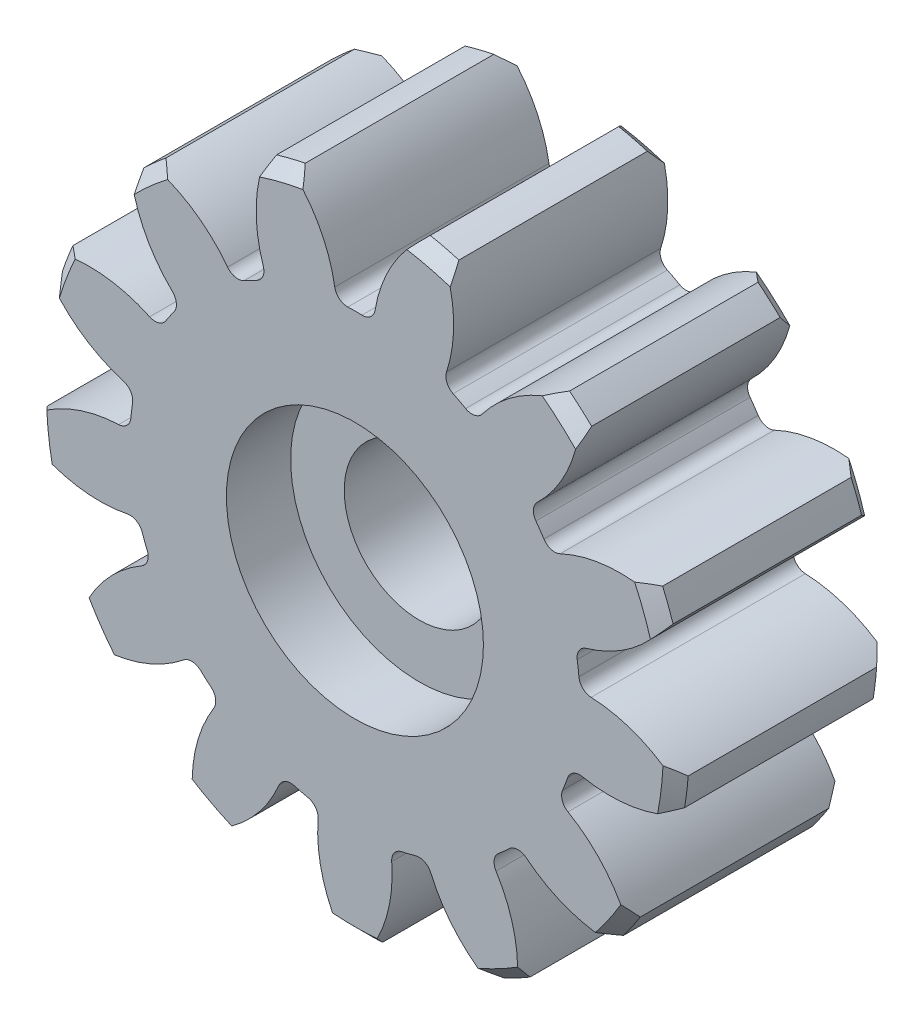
ISO-10303-21;
HEADER;
FILE_DESCRIPTION(('STEP AP214'),'2;1');
FILE_NAME('part.step','',(''),(''),'','','');
FILE_SCHEMA(('AUTOMOTIVE_DESIGN { 1 0 10303 214 1 1 1 1 }'));
ENDSEC;
DATA;
#1=APPLICATION_CONTEXT('core data for automotive mechanical design processes');
#2=APPLICATION_PROTOCOL_DEFINITION('international standard','automotive_design',2000,#1);
#3=PRODUCT_CONTEXT('',#1,'mechanical');
#4=PRODUCT('Part','Part','',(#3));
#5=PRODUCT_RELATED_PRODUCT_CATEGORY('part','',(#4));
#6=PRODUCT_DEFINITION_FORMATION('','',#4);
#7=PRODUCT_DEFINITION_CONTEXT('part definition',#1,'design');
#8=PRODUCT_DEFINITION('design','',#6,#7);
#9=PRODUCT_DEFINITION_SHAPE('','',#8);
#10=(LENGTH_UNIT() NAMED_UNIT(*) SI_UNIT(.MILLI.,.METRE.));
#11=(NAMED_UNIT(*) PLANE_ANGLE_UNIT() SI_UNIT($,.RADIAN.));
#12=(NAMED_UNIT(*) SI_UNIT($,.STERADIAN.) SOLID_ANGLE_UNIT());
#13=UNCERTAINTY_MEASURE_WITH_UNIT(LENGTH_MEASURE(1.E-05),#10,'distance_accuracy_value','');
#14=(GEOMETRIC_REPRESENTATION_CONTEXT(3) GLOBAL_UNCERTAINTY_ASSIGNED_CONTEXT((#13)) GLOBAL_UNIT_ASSIGNED_CONTEXT((#10,
#11,#12)) REPRESENTATION_CONTEXT('',''));
#15=CARTESIAN_POINT('',(0.,0.,0.));
#16=DIRECTION('',(0.,0.,1.));
#17=DIRECTION('',(1.,0.,0.));
#18=AXIS2_PLACEMENT_3D('',#15,#16,#17);
#19=CARTESIAN_POINT('',(0.,0.,-9.89949493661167));
#20=DIRECTION('',(0.,0.,1.));
#21=DIRECTION('',(1.,0.,0.));
#22=AXIS2_PLACEMENT_3D('',#19,#20,#21);
#23=CYLINDRICAL_SURFACE('',#22,3.5);
#24=CARTESIAN_POINT('',(0.,0.,0.));
#25=DIRECTION('',(0.,0.,1.));
#26=DIRECTION('',(1.,0.,0.));
#27=AXIS2_PLACEMENT_3D('',#24,#25,#26);
#28=CIRCLE('',#27,3.5);
#29=CARTESIAN_POINT('',(3.5,0.,0.));
#30=VERTEX_POINT('',#29);
#31=EDGE_CURVE('E702',#30,#30,#28,.F.);
#32=ORIENTED_EDGE('',*,*,#31,.T.);
#33=EDGE_LOOP('',(#32));
#34=FACE_BOUND('',#33,.T.);
#35=CARTESIAN_POINT('',(0.,0.,7.));
#36=DIRECTION('',(0.,0.,1.));
#37=DIRECTION('',(1.,0.,0.));
#38=AXIS2_PLACEMENT_3D('',#35,#36,#37);
#39=CIRCLE('',#38,3.5);
#40=CARTESIAN_POINT('',(3.5,0.,7.));
#41=VERTEX_POINT('',#40);
#42=EDGE_CURVE('E51',#41,#41,#39,.F.);
#43=ORIENTED_EDGE('',*,*,#42,.F.);
#44=EDGE_LOOP('',(#43));
#45=FACE_BOUND('',#44,.T.);
#46=ADVANCED_FACE('F45',(#34,#45),#23,.F.);
#47=CARTESIAN_POINT('',(0.,0.,10.));
#48=DIRECTION('',(0.,0.,-1.));
#49=DIRECTION('',(-1.,0.,0.));
#50=AXIS2_PLACEMENT_3D('',#47,#48,#49);
#51=CYLINDRICAL_SURFACE('',#50,15.);
#52=CARTESIAN_POINT('',(0.,0.,0.600000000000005));
#53=DIRECTION('',(0.,0.,1.));
#54=DIRECTION('',(1.,0.,0.));
#55=AXIS2_PLACEMENT_3D('',#52,#53,#54);
#56=CIRCLE('',#55,15.);
#57=CARTESIAN_POINT('',(14.2545306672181,4.6699416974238,0.600000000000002));
#58=VERTEX_POINT('',#57);
#59=CARTESIAN_POINT('',(13.7664135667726,5.95700071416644,0.600000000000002));
#60=VERTEX_POINT('',#59);
#61=EDGE_CURVE('E1652',#58,#60,#56,.T.);
#62=ORIENTED_EDGE('',*,*,#61,.T.);
#63=DIRECTION('',(0.,0.,1.));
#64=VECTOR('',#63,1.);
#65=CARTESIAN_POINT('',(13.7664135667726,5.95700071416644,-7.39127928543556));
#66=LINE('',#65,#64);
#67=CARTESIAN_POINT('',(13.7664135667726,5.95700071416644,9.39999999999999));
#68=VERTEX_POINT('',#67);
#69=EDGE_CURVE('E1658',#60,#68,#66,.T.);
#70=ORIENTED_EDGE('',*,*,#69,.T.);
#71=CARTESIAN_POINT('',(0.,0.,9.4));
#72=DIRECTION('',(0.,0.,1.));
#73=DIRECTION('',(1.,0.,0.));
#74=AXIS2_PLACEMENT_3D('',#71,#72,#73);
#75=CIRCLE('',#74,15.);
#76=CARTESIAN_POINT('',(14.2545306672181,4.66994169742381,9.4));
#77=VERTEX_POINT('',#76);
#78=EDGE_CURVE('E1166',#68,#77,#75,.F.);
#79=ORIENTED_EDGE('',*,*,#78,.T.);
#80=DIRECTION('',(0.,0.,1.));
#81=VECTOR('',#80,1.);
#82=CARTESIAN_POINT('',(14.2545306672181,4.6699416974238,-7.39127928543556));
#83=LINE('',#82,#81);
#84=EDGE_CURVE('E1659',#58,#77,#83,.T.);
#85=ORIENTED_EDGE('',*,*,#84,.F.);
#86=EDGE_LOOP('',(#62,#70,#79,#85));
#87=FACE_BOUND('',#86,.T.);
#88=ADVANCED_FACE('F922',(#87),#51,.T.);
#89=CARTESIAN_POINT('',(14.791990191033,-2.48938269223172,0.600000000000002));
#90=VERTEX_POINT('',#89);
#91=CARTESIAN_POINT('',(14.9579101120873,-1.12290920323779,0.600000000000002));
#92=VERTEX_POINT('',#91);
#93=EDGE_CURVE('E1398',#90,#92,#56,.T.);
#94=ORIENTED_EDGE('',*,*,#93,.T.);
#95=DIRECTION('',(0.,0.,1.));
#96=VECTOR('',#95,1.);
#97=CARTESIAN_POINT('',(14.9579101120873,-1.12290920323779,-7.39127928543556));
#98=LINE('',#97,#96);
#99=CARTESIAN_POINT('',(14.9579101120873,-1.12290920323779,9.39999999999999));
#100=VERTEX_POINT('',#99);
#101=EDGE_CURVE('E1365',#92,#100,#98,.T.);
#102=ORIENTED_EDGE('',*,*,#101,.T.);
#103=CARTESIAN_POINT('',(14.791990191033,-2.48938269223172,9.4));
#104=VERTEX_POINT('',#103);
#105=EDGE_CURVE('E1159',#100,#104,#75,.F.);
#106=ORIENTED_EDGE('',*,*,#105,.T.);
#107=DIRECTION('',(0.,0.,1.));
#108=VECTOR('',#107,1.);
#109=CARTESIAN_POINT('',(14.791990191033,-2.48938269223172,-7.39127928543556));
#110=LINE('',#109,#108);
#111=EDGE_CURVE('E1996',#90,#104,#110,.T.);
#112=ORIENTED_EDGE('',*,*,#111,.F.);
#113=EDGE_LOOP('',(#94,#102,#106,#112));
#114=FACE_BOUND('',#113,.T.);
#115=ADVANCED_FACE('F1396',(#114),#51,.T.);
#116=CARTESIAN_POINT('',(6.35408636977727,-13.587699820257,0.600000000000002));
#117=VERTEX_POINT('',#116);
#118=CARTESIAN_POINT('',(7.57292526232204,-12.9480038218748,0.600000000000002));
#119=VERTEX_POINT('',#118);
#120=EDGE_CURVE('E1642',#117,#119,#56,.T.);
#121=ORIENTED_EDGE('',*,*,#120,.T.);
#122=DIRECTION('',(0.,0.,1.));
#123=VECTOR('',#122,1.);
#124=CARTESIAN_POINT('',(7.57292526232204,-12.9480038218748,-7.39127928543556));
#125=LINE('',#124,#123);
#126=CARTESIAN_POINT('',(7.57292526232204,-12.9480038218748,9.39999999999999));
#127=VERTEX_POINT('',#126);
#128=EDGE_CURVE('E1957',#119,#127,#125,.T.);
#129=ORIENTED_EDGE('',*,*,#128,.T.);
#130=CARTESIAN_POINT('',(6.35408636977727,-13.587699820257,9.4));
#131=VERTEX_POINT('',#130);
#132=EDGE_CURVE('E1145',#127,#131,#75,.F.);
#133=ORIENTED_EDGE('',*,*,#132,.T.);
#134=DIRECTION('',(0.,0.,1.));
#135=VECTOR('',#134,1.);
#136=CARTESIAN_POINT('',(6.35408636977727,-13.587699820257,-7.39127928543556));
#137=LINE('',#136,#135);
#138=EDGE_CURVE('E2060',#117,#131,#137,.T.);
#139=ORIENTED_EDGE('',*,*,#138,.F.);
#140=EDGE_LOOP('',(#121,#129,#133,#139));
#141=FACE_BOUND('',#140,.T.);
#142=ADVANCED_FACE('F2859',(#141),#51,.T.);
#143=CARTESIAN_POINT('',(12.722729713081,-7.94557415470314,9.39999999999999));
#144=VERTEX_POINT('',#143);
#145=CARTESIAN_POINT('',(11.9407830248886,-9.07841950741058,9.4));
#146=VERTEX_POINT('',#145);
#147=EDGE_CURVE('E1152',#144,#146,#75,.F.);
#148=ORIENTED_EDGE('',*,*,#147,.T.);
#149=DIRECTION('',(0.,0.,1.));
#150=VECTOR('',#149,1.);
#151=CARTESIAN_POINT('',(11.9407830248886,-9.07841950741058,-7.39127928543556));
#152=LINE('',#151,#150);
#153=CARTESIAN_POINT('',(11.9407830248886,-9.07841950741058,0.600000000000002));
#154=VERTEX_POINT('',#153);
#155=EDGE_CURVE('E1904',#154,#146,#152,.T.);
#156=ORIENTED_EDGE('',*,*,#155,.F.);
#157=CARTESIAN_POINT('',(12.722729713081,-7.94557415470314,0.600000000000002));
#158=VERTEX_POINT('',#157);
#159=EDGE_CURVE('E1646',#154,#158,#56,.T.);
#160=ORIENTED_EDGE('',*,*,#159,.T.);
#161=DIRECTION('',(0.,0.,1.));
#162=VECTOR('',#161,1.);
#163=CARTESIAN_POINT('',(12.722729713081,-7.94557415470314,-7.39127928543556));
#164=LINE('',#163,#162);
#165=EDGE_CURVE('E1867',#158,#144,#164,.T.);
#166=ORIENTED_EDGE('',*,*,#165,.T.);
#167=EDGE_LOOP('',(#148,#156,#160,#166));
#168=FACE_BOUND('',#167,.T.);
#169=ADVANCED_FACE('F1895',(#168),#51,.T.);
#170=CARTESIAN_POINT('',(-0.688254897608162,-14.9842018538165,0.600000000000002));
#171=VERTEX_POINT('',#170);
#172=CARTESIAN_POINT('',(0.688254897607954,-14.9842018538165,0.600000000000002));
#173=VERTEX_POINT('',#172);
#174=EDGE_CURVE('E1638',#171,#173,#56,.T.);
#175=ORIENTED_EDGE('',*,*,#174,.T.);
#176=DIRECTION('',(0.,0.,1.));
#177=VECTOR('',#176,1.);
#178=CARTESIAN_POINT('',(0.688254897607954,-14.9842018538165,-7.39127928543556));
#179=LINE('',#178,#177);
#180=CARTESIAN_POINT('',(0.688254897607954,-14.9842018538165,9.39999999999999));
#181=VERTEX_POINT('',#180);
#182=EDGE_CURVE('E2113',#173,#181,#179,.T.);
#183=ORIENTED_EDGE('',*,*,#182,.T.);
#184=CARTESIAN_POINT('',(-0.688254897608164,-14.9842018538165,9.4));
#185=VERTEX_POINT('',#184);
#186=EDGE_CURVE('E1138',#181,#185,#75,.F.);
#187=ORIENTED_EDGE('',*,*,#186,.T.);
#188=DIRECTION('',(0.,0.,1.));
#189=VECTOR('',#188,1.);
#190=CARTESIAN_POINT('',(-0.688254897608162,-14.9842018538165,-7.39127928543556));
#191=LINE('',#190,#189);
#192=EDGE_CURVE('E2155',#171,#185,#191,.T.);
#193=ORIENTED_EDGE('',*,*,#192,.F.);
#194=EDGE_LOOP('',(#175,#183,#187,#193));
#195=FACE_BOUND('',#194,.T.);
#196=ADVANCED_FACE('F2848',(#195),#51,.T.);
#197=CARTESIAN_POINT('',(-7.57292526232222,-12.9480038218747,0.600000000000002));
#198=VERTEX_POINT('',#197);
#199=CARTESIAN_POINT('',(-6.35408636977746,-13.5876998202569,0.600000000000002));
#200=VERTEX_POINT('',#199);
#201=EDGE_CURVE('E1634',#198,#200,#56,.T.);
#202=ORIENTED_EDGE('',*,*,#201,.T.);
#203=DIRECTION('',(0.,0.,1.));
#204=VECTOR('',#203,1.);
#205=CARTESIAN_POINT('',(-6.35408636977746,-13.5876998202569,-7.39127928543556));
#206=LINE('',#205,#204);
#207=CARTESIAN_POINT('',(-6.35408636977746,-13.5876998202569,9.39999999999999));
#208=VERTEX_POINT('',#207);
#209=EDGE_CURVE('E2214',#200,#208,#206,.T.);
#210=ORIENTED_EDGE('',*,*,#209,.T.);
#211=CARTESIAN_POINT('',(-7.57292526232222,-12.9480038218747,9.4));
#212=VERTEX_POINT('',#211);
#213=EDGE_CURVE('E1131',#208,#212,#75,.F.);
#214=ORIENTED_EDGE('',*,*,#213,.T.);
#215=DIRECTION('',(0.,0.,1.));
#216=VECTOR('',#215,1.);
#217=CARTESIAN_POINT('',(-7.57292526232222,-12.9480038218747,-7.39127928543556));
#218=LINE('',#217,#216);
#219=EDGE_CURVE('E2232',#198,#212,#218,.T.);
#220=ORIENTED_EDGE('',*,*,#219,.F.);
#221=EDGE_LOOP('',(#202,#210,#214,#220));
#222=FACE_BOUND('',#221,.T.);
#223=ADVANCED_FACE('F2842',(#222),#51,.T.);
#224=CARTESIAN_POINT('',(-14.9579101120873,-1.12290920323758,0.600000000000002));
#225=VERTEX_POINT('',#224);
#226=CARTESIAN_POINT('',(-14.7919901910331,-2.48938269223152,0.600000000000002));
#227=VERTEX_POINT('',#226);
#228=EDGE_CURVE('E1625',#225,#227,#56,.T.);
#229=ORIENTED_EDGE('',*,*,#228,.T.);
#230=DIRECTION('',(0.,0.,1.));
#231=VECTOR('',#230,1.);
#232=CARTESIAN_POINT('',(-14.7919901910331,-2.48938269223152,-7.39127928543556));
#233=LINE('',#232,#231);
#234=CARTESIAN_POINT('',(-14.7919901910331,-2.48938269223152,9.39999999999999));
#235=VERTEX_POINT('',#234);
#236=EDGE_CURVE('E2311',#227,#235,#233,.T.);
#237=ORIENTED_EDGE('',*,*,#236,.T.);
#238=CARTESIAN_POINT('',(-14.9579101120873,-1.12290920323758,9.4));
#239=VERTEX_POINT('',#238);
#240=EDGE_CURVE('E1118',#235,#239,#75,.F.);
#241=ORIENTED_EDGE('',*,*,#240,.T.);
#242=DIRECTION('',(0.,0.,1.));
#243=VECTOR('',#242,1.);
#244=CARTESIAN_POINT('',(-14.9579101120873,-1.12290920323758,-7.39127928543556));
#245=LINE('',#244,#243);
#246=EDGE_CURVE('E2341',#225,#239,#245,.T.);
#247=ORIENTED_EDGE('',*,*,#246,.F.);
#248=EDGE_LOOP('',(#229,#237,#241,#247));
#249=FACE_BOUND('',#248,.T.);
#250=ADVANCED_FACE('F2836',(#249),#51,.T.);
#251=CARTESIAN_POINT('',(-11.9407830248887,-9.07841950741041,9.39999999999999));
#252=VERTEX_POINT('',#251);
#253=CARTESIAN_POINT('',(-12.7227297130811,-7.94557415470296,9.4));
#254=VERTEX_POINT('',#253);
#255=EDGE_CURVE('E1124',#252,#254,#75,.F.);
#256=ORIENTED_EDGE('',*,*,#255,.T.);
#257=DIRECTION('',(0.,0.,1.));
#258=VECTOR('',#257,1.);
#259=CARTESIAN_POINT('',(-12.7227297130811,-7.94557415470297,-7.39127928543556));
#260=LINE('',#259,#258);
#261=CARTESIAN_POINT('',(-12.7227297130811,-7.94557415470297,0.600000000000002));
#262=VERTEX_POINT('',#261);
#263=EDGE_CURVE('E3483',#262,#254,#260,.T.);
#264=ORIENTED_EDGE('',*,*,#263,.F.);
#265=CARTESIAN_POINT('',(-11.9407830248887,-9.07841950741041,0.600000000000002));
#266=VERTEX_POINT('',#265);
#267=EDGE_CURVE('E1630',#262,#266,#56,.T.);
#268=ORIENTED_EDGE('',*,*,#267,.T.);
#269=DIRECTION('',(0.,0.,1.));
#270=VECTOR('',#269,1.);
#271=CARTESIAN_POINT('',(-11.9407830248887,-9.07841950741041,-7.39127928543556));
#272=LINE('',#271,#270);
#273=EDGE_CURVE('E1255',#266,#252,#272,.T.);
#274=ORIENTED_EDGE('',*,*,#273,.T.);
#275=EDGE_LOOP('',(#256,#264,#268,#274));
#276=FACE_BOUND('',#275,.T.);
#277=ADVANCED_FACE('F2830',(#276),#51,.T.);
#278=CARTESIAN_POINT('',(-2.91769875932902,14.7134983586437,0.600000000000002));
#279=VERTEX_POINT('',#278);
#280=CARTESIAN_POINT('',(-4.25420968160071,14.3840780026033,0.600000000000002));
#281=VERTEX_POINT('',#280);
#282=EDGE_CURVE('E877',#279,#281,#56,.T.);
#283=ORIENTED_EDGE('',*,*,#282,.T.);
#284=DIRECTION('',(0.,0.,1.));
#285=VECTOR('',#284,1.);
#286=CARTESIAN_POINT('',(-4.25420968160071,14.3840780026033,-7.39127928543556));
#287=LINE('',#286,#285);
#288=CARTESIAN_POINT('',(-4.25420968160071,14.3840780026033,9.39999999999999));
#289=VERTEX_POINT('',#288);
#290=EDGE_CURVE('E794',#281,#289,#287,.T.);
#291=ORIENTED_EDGE('',*,*,#290,.T.);
#292=CARTESIAN_POINT('',(-2.91769875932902,14.7134983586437,9.39999999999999));
#293=VERTEX_POINT('',#292);
#294=EDGE_CURVE('E813',#289,#293,#75,.F.);
#295=ORIENTED_EDGE('',*,*,#294,.T.);
#296=DIRECTION('',(0.,0.,1.));
#297=VECTOR('',#296,1.);
#298=CARTESIAN_POINT('',(-2.91769875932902,14.7134983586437,-7.39127928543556));
#299=LINE('',#298,#297);
#300=EDGE_CURVE('E830',#279,#293,#299,.T.);
#301=ORIENTED_EDGE('',*,*,#300,.F.);
#302=EDGE_LOOP('',(#283,#291,#295,#301));
#303=FACE_BOUND('',#302,.T.);
#304=ADVANCED_FACE('F1107',(#303),#51,.T.);
#305=CARTESIAN_POINT('',(-10.4515299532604,10.759438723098,9.39999999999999));
#306=VERTEX_POINT('',#305);
#307=CARTESIAN_POINT('',(-9.42119757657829,11.6722335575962,9.4));
#308=VERTEX_POINT('',#307);
#309=EDGE_CURVE('E1109',#306,#308,#75,.F.);
#310=ORIENTED_EDGE('',*,*,#309,.T.);
#311=DIRECTION('',(0.,0.,1.));
#312=VECTOR('',#311,1.);
#313=CARTESIAN_POINT('',(-9.42119757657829,11.6722335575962,-7.39127928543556));
#314=LINE('',#313,#312);
#315=CARTESIAN_POINT('',(-9.42119757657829,11.6722335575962,0.600000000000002));
#316=VERTEX_POINT('',#315);
#317=EDGE_CURVE('E65',#316,#308,#314,.T.);
#318=ORIENTED_EDGE('',*,*,#317,.F.);
#319=CARTESIAN_POINT('',(-10.4515299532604,10.759438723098,0.600000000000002));
#320=VERTEX_POINT('',#319);
#321=EDGE_CURVE('E882',#316,#320,#56,.T.);
#322=ORIENTED_EDGE('',*,*,#321,.T.);
#323=DIRECTION('',(0.,0.,1.));
#324=VECTOR('',#323,1.);
#325=CARTESIAN_POINT('',(-10.4515299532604,10.759438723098,-7.39127928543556));
#326=LINE('',#325,#324);
#327=EDGE_CURVE('E1534',#320,#306,#326,.T.);
#328=ORIENTED_EDGE('',*,*,#327,.T.);
#329=EDGE_LOOP('',(#310,#318,#322,#328));
#330=FACE_BOUND('',#329,.T.);
#331=ADVANCED_FACE('F2819',(#330),#51,.T.);
#332=CARTESIAN_POINT('',(-14.2545306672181,4.669941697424,9.39999999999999));
#333=VERTEX_POINT('',#332);
#334=CARTESIAN_POINT('',(-13.7664135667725,5.95700071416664,9.4));
#335=VERTEX_POINT('',#334);
#336=EDGE_CURVE('E1112',#333,#335,#75,.F.);
#337=ORIENTED_EDGE('',*,*,#336,.T.);
#338=DIRECTION('',(0.,0.,1.));
#339=VECTOR('',#338,1.);
#340=CARTESIAN_POINT('',(-13.7664135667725,5.95700071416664,-7.39127928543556));
#341=LINE('',#340,#339);
#342=CARTESIAN_POINT('',(-13.7664135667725,5.95700071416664,0.600000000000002));
#343=VERTEX_POINT('',#342);
#344=EDGE_CURVE('E73',#343,#335,#341,.T.);
#345=ORIENTED_EDGE('',*,*,#344,.F.);
#346=CARTESIAN_POINT('',(-14.2545306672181,4.669941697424,0.600000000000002));
#347=VERTEX_POINT('',#346);
#348=EDGE_CURVE('E1461',#343,#347,#56,.T.);
#349=ORIENTED_EDGE('',*,*,#348,.T.);
#350=DIRECTION('',(0.,0.,1.));
#351=VECTOR('',#350,1.);
#352=CARTESIAN_POINT('',(-14.2545306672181,4.669941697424,-7.39127928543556));
#353=LINE('',#352,#351);
#354=EDGE_CURVE('E1599',#347,#333,#353,.T.);
#355=ORIENTED_EDGE('',*,*,#354,.T.);
#356=EDGE_LOOP('',(#337,#345,#349,#355));
#357=FACE_BOUND('',#356,.T.);
#358=ADVANCED_FACE('F1623',(#357),#51,.T.);
#359=CARTESIAN_POINT('',(9.42119757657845,11.6722335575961,9.39999999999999));
#360=VERTEX_POINT('',#359);
#361=CARTESIAN_POINT('',(10.4515299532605,10.7594387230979,9.4));
#362=VERTEX_POINT('',#361);
#363=EDGE_CURVE('E876',#360,#362,#75,.F.);
#364=ORIENTED_EDGE('',*,*,#363,.T.);
#365=DIRECTION('',(0.,0.,1.));
#366=VECTOR('',#365,1.);
#367=CARTESIAN_POINT('',(10.4515299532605,10.7594387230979,-7.39127928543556));
#368=LINE('',#367,#366);
#369=CARTESIAN_POINT('',(10.4515299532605,10.7594387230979,0.600000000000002));
#370=VERTEX_POINT('',#369);
#371=EDGE_CURVE('E1181',#370,#362,#368,.T.);
#372=ORIENTED_EDGE('',*,*,#371,.F.);
#373=CARTESIAN_POINT('',(9.42119757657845,11.6722335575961,0.600000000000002));
#374=VERTEX_POINT('',#373);
#375=EDGE_CURVE('E1183',#370,#374,#56,.T.);
#376=ORIENTED_EDGE('',*,*,#375,.T.);
#377=DIRECTION('',(0.,0.,1.));
#378=VECTOR('',#377,1.);
#379=CARTESIAN_POINT('',(9.42119757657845,11.6722335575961,-7.39127928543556));
#380=LINE('',#379,#378);
#381=EDGE_CURVE('E1053',#374,#360,#380,.T.);
#382=ORIENTED_EDGE('',*,*,#381,.T.);
#383=EDGE_LOOP('',(#364,#372,#376,#382));
#384=FACE_BOUND('',#383,.T.);
#385=ADVANCED_FACE('F923',(#384),#51,.T.);
#386=CARTESIAN_POINT('',(0.,0.,0.600000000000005));
#387=DIRECTION('',(0.,0.,1.));
#388=DIRECTION('',(1.,0.,0.));
#389=AXIS2_PLACEMENT_3D('',#386,#387,#388);
#390=CONICAL_SURFACE('',#389,15.,0.785398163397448);
#391=CARTESIAN_POINT('',(13.7664135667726,5.95700071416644,0.600000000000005));
#392=CARTESIAN_POINT('',(13.7073789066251,5.96952556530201,0.550794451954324));
#393=CARTESIAN_POINT('',(13.6483440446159,5.98120523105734,0.501374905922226));
#394=CARTESIAN_POINT('',(13.5303396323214,6.00289022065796,0.402149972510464));
#395=CARTESIAN_POINT('',(13.4713700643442,6.01289633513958,0.352344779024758));
#396=CARTESIAN_POINT('',(13.3535061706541,6.03126204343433,0.25234423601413));
#397=CARTESIAN_POINT('',(13.2946118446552,6.03962164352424,0.202148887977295));
#398=CARTESIAN_POINT('',(13.176905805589,6.05471921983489,0.101361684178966));
#399=CARTESIAN_POINT('',(13.1180941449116,6.06145642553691,0.050769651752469));
#400=CARTESIAN_POINT('',(13.059355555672,6.0673909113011,0.));
#401=B_SPLINE_CURVE_WITH_KNOTS('',3,(#391,#392,#393,#394,#395,#396,#397,#398,#399,#400),
.UNSPECIFIED.,.F.,.F.,(4,2,2,2,4),(0.,0.233592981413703,0.467075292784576,0.700556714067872,
0.934148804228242),.UNSPECIFIED.);
#402=CARTESIAN_POINT('',(13.059355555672,6.0673909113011,0.));
#403=VERTEX_POINT('',#402);
#404=EDGE_CURVE('E1665',#60,#403,#401,.T.);
#405=ORIENTED_EDGE('',*,*,#404,.F.);
#406=ORIENTED_EDGE('',*,*,#61,.F.);
#407=CARTESIAN_POINT('',(13.7984923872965,4.11844726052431,0.));
#408=CARTESIAN_POINT('',(13.8385235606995,4.16184017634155,0.0507696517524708));
#409=CARTESIAN_POINT('',(13.8780771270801,4.20588239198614,0.101361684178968));
#410=CARTESIAN_POINT('',(13.9561698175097,4.29523663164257,0.202148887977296));
#411=CARTESIAN_POINT('',(13.9947094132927,4.34054804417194,0.25234423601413));
#412=CARTESIAN_POINT('',(14.0707530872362,4.43245319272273,0.352344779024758));
#413=CARTESIAN_POINT('',(14.1082571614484,4.47904693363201,0.402149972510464));
#414=CARTESIAN_POINT('',(14.1822049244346,4.57352978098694,0.501374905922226));
#415=CARTESIAN_POINT('',(14.2186481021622,4.62141949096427,0.550794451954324));
#416=CARTESIAN_POINT('',(14.2545306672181,4.6699416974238,0.600000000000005));
#417=B_SPLINE_CURVE_WITH_KNOTS('',3,(#407,#408,#409,#410,#411,#412,#413,#414,#415,#416),
.UNSPECIFIED.,.F.,.F.,(4,2,2,2,4),(0.,0.233592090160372,0.467073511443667,0.700555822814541,
0.934148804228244),.UNSPECIFIED.);
#418=CARTESIAN_POINT('',(13.7984923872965,4.11844726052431,0.));
#419=VERTEX_POINT('',#418);
#420=EDGE_CURVE('E1664',#419,#58,#417,.T.);
#421=ORIENTED_EDGE('',*,*,#420,.F.);
#422=CARTESIAN_POINT('',(0.,0.,0.));
#423=DIRECTION('',(0.,0.,1.));
#424=DIRECTION('',(1.,0.,0.));
#425=AXIS2_PLACEMENT_3D('',#422,#423,#424);
#426=CIRCLE('',#425,14.4);
#427=EDGE_CURVE('E964',#403,#419,#426,.F.);
#428=ORIENTED_EDGE('',*,*,#427,.F.);
#429=EDGE_LOOP('',(#405,#406,#421,#428));
#430=FACE_BOUND('',#429,.T.);
#431=ADVANCED_FACE('F937',(#430),#390,.T.);
#432=CARTESIAN_POINT('',(14.9579101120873,-1.12290920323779,0.600000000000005));
#433=CARTESIAN_POINT('',(14.9114581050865,-1.08438422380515,0.550794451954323));
#434=CARTESIAN_POINT('',(14.864613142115,-1.04660752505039,0.501374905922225));
#435=CARTESIAN_POINT('',(14.7702029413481,-0.972567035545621,0.402149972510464));
#436=CARTESIAN_POINT('',(14.7226380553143,-0.936302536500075,0.352344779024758));
#437=CARTESIAN_POINT('',(14.626809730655,-0.865266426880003,0.25234423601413));
#438=CARTESIAN_POINT('',(14.5785462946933,-0.830494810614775,0.202148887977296));
#439=CARTESIAN_POINT('',(14.4813389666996,-0.762425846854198,0.101361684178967));
#440=CARTESIAN_POINT('',(14.4323947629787,-0.729129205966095,0.0507696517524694));
#441=CARTESIAN_POINT('',(14.3831422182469,-0.696577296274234,0.));
#442=B_SPLINE_CURVE_WITH_KNOTS('',3,(#432,#433,#434,#435,#436,#437,#438,#439,#440,#441),
.UNSPECIFIED.,.F.,.F.,(4,2,2,2,4),(0.,0.233592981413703,0.467075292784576,0.70055671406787,
0.934148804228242),.UNSPECIFIED.);
#443=CARTESIAN_POINT('',(14.3831422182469,-0.696577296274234,0.));
#444=VERTEX_POINT('',#443);
#445=EDGE_CURVE('E1358',#92,#444,#442,.T.);
#446=ORIENTED_EDGE('',*,*,#445,.F.);
#447=ORIENTED_EDGE('',*,*,#93,.F.);
#448=CARTESIAN_POINT('',(14.1318961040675,-2.76577520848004,0.));
#449=CARTESIAN_POINT('',(14.187507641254,-2.74595610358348,0.0507696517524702));
#450=CARTESIAN_POINT('',(14.2429980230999,-2.72534011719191,0.101361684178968));
#451=CARTESIAN_POINT('',(14.353670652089,-2.68251235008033,0.202148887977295));
#452=CARTESIAN_POINT('',(14.4088530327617,-2.6603013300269,0.25234423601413));
#453=CARTESIAN_POINT('',(14.5188968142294,-2.61426261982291,0.352344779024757));
#454=CARTESIAN_POINT('',(14.5737582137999,-2.59043492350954,0.402149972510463));
#455=CARTESIAN_POINT('',(14.6831440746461,-2.54113975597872,0.501374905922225));
#456=CARTESIAN_POINT('',(14.7376683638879,-2.51567151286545,0.550794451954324));
#457=CARTESIAN_POINT('',(14.791990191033,-2.48938269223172,0.600000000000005));
#458=B_SPLINE_CURVE_WITH_KNOTS('',3,(#448,#449,#450,#451,#452,#453,#454,#455,#456,#457),
.UNSPECIFIED.,.F.,.F.,(4,2,2,2,4),(0.,0.233592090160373,0.467073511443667,0.700555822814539,
0.934148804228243),.UNSPECIFIED.);
#459=CARTESIAN_POINT('',(14.1318961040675,-2.76577520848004,0.));
#460=VERTEX_POINT('',#459);
#461=EDGE_CURVE('E1403',#460,#90,#458,.T.);
#462=ORIENTED_EDGE('',*,*,#461,.F.);
#463=EDGE_CURVE('E1402',#444,#460,#426,.F.);
#464=ORIENTED_EDGE('',*,*,#463,.F.);
#465=EDGE_LOOP('',(#446,#447,#462,#464));
#466=FACE_BOUND('',#465,.T.);
#467=ADVANCED_FACE('F1400',(#466),#390,.T.);
#468=CARTESIAN_POINT('',(7.57292526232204,-12.9480038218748,0.600000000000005));
#469=CARTESIAN_POINT('',(7.5782429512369,-12.8878898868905,0.550794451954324));
#470=CARTESIAN_POINT('',(7.5827215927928,-12.8278776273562,0.501374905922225));
#471=CARTESIAN_POINT('',(7.5900246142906,-12.7081197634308,0.402149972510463));
#472=CARTESIAN_POINT('',(7.59284977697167,-12.6483740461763,0.352344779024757));
#473=CARTESIAN_POINT('',(7.5968746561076,-12.529155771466,0.25234423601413));
#474=CARTESIAN_POINT('',(7.59807437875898,-12.4696832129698,0.202148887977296));
#475=CARTESIAN_POINT('',(7.5988739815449,-12.3510155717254,0.101361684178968));
#476=CARTESIAN_POINT('',(7.59847310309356,-12.291820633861,0.0507696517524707));
#477=CARTESIAN_POINT('',(7.59728416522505,-12.2327949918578,0.));
#478=B_SPLINE_CURVE_WITH_KNOTS('',3,(#468,#469,#470,#471,#472,#473,#474,#475,#476,#477),
.UNSPECIFIED.,.F.,.F.,(4,2,2,2,4),(0.,0.233592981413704,0.467075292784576,0.700556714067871,
0.934148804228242),.UNSPECIFIED.);
#479=CARTESIAN_POINT('',(7.59728416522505,-12.2327949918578,0.));
#480=VERTEX_POINT('',#479);
#481=EDGE_CURVE('E1948',#119,#480,#478,.T.);
#482=ORIENTED_EDGE('',*,*,#481,.F.);
#483=ORIENTED_EDGE('',*,*,#120,.F.);
#484=CARTESIAN_POINT('',(5.75164360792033,-13.2014618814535,0.));
#485=CARTESIAN_POINT('',(5.79954536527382,-13.235970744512,0.0507696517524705));
#486=CARTESIAN_POINT('',(5.84803411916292,-13.2699272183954,0.101361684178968));
#487=CARTESIAN_POINT('',(5.94614989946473,-13.3366800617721,0.202148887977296));
#488=CARTESIAN_POINT('',(5.99577637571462,-13.3694769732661,0.25234423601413));
#489=CARTESIAN_POINT('',(6.09617748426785,-13.4338882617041,0.352344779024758));
#490=CARTESIAN_POINT('',(6.14695212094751,-13.4655026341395,0.402149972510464));
#491=CARTESIAN_POINT('',(6.24965949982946,-13.5275225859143,0.501374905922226));
#492=CARTESIAN_POINT('',(6.30159277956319,-13.5579275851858,0.550794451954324));
#493=CARTESIAN_POINT('',(6.35408636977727,-13.587699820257,0.600000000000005));
#494=B_SPLINE_CURVE_WITH_KNOTS('',3,(#484,#485,#486,#487,#488,#489,#490,#491,#492,#493),
.UNSPECIFIED.,.F.,.F.,(4,2,2,2,4),(0.,0.233592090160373,0.467073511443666,0.70055582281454,
0.934148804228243),.UNSPECIFIED.);
#495=CARTESIAN_POINT('',(5.75164360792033,-13.2014618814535,0.));
#496=VERTEX_POINT('',#495);
#497=EDGE_CURVE('E2066',#496,#117,#494,.T.);
#498=ORIENTED_EDGE('',*,*,#497,.F.);
#499=EDGE_CURVE('E1411',#480,#496,#426,.F.);
#500=ORIENTED_EDGE('',*,*,#499,.F.);
#501=EDGE_LOOP('',(#482,#483,#498,#500));
#502=FACE_BOUND('',#501,.T.);
#503=ADVANCED_FACE('F2791',(#502),#390,.T.);
#504=CARTESIAN_POINT('',(11.2278527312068,-9.01639190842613,0.));
#505=CARTESIAN_POINT('',(11.286304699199,-9.02468693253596,0.0507696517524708));
#506=CARTESIAN_POINT('',(11.345019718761,-9.03222004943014,0.101361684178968));
#507=CARTESIAN_POINT('',(11.4629185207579,-9.04573008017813,0.202148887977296));
#508=CARTESIAN_POINT('',(11.522102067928,-9.05170772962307,0.25234423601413));
#509=CARTESIAN_POINT('',(11.6409362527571,-9.06208237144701,0.352344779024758));
#510=CARTESIAN_POINT('',(11.7005868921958,-9.06647935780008,0.402149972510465));
#511=CARTESIAN_POINT('',(11.8203518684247,-9.07366479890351,0.501374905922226));
#512=CARTESIAN_POINT('',(11.8804664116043,-9.07645249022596,0.550794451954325));
#513=CARTESIAN_POINT('',(11.9407830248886,-9.07841950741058,0.600000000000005));
#514=B_SPLINE_CURVE_WITH_KNOTS('',3,(#504,#505,#506,#507,#508,#509,#510,#511,#512,#513),
.UNSPECIFIED.,.F.,.F.,(4,2,2,2,4),(0.,0.233592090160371,0.467073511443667,0.700555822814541,
0.934148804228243),.UNSPECIFIED.);
#515=CARTESIAN_POINT('',(11.2278527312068,-9.01639190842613,0.));
#516=VERTEX_POINT('',#515);
#517=EDGE_CURVE('E1910',#516,#154,#514,.T.);
#518=ORIENTED_EDGE('',*,*,#517,.F.);
#519=CARTESIAN_POINT('',(12.4119243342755,-7.30096803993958,0.));
#520=VERTEX_POINT('',#519);
#521=EDGE_CURVE('E1406',#520,#516,#426,.F.);
#522=ORIENTED_EDGE('',*,*,#521,.F.);
#523=CARTESIAN_POINT('',(12.722729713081,-7.94557415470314,0.600000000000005));
#524=CARTESIAN_POINT('',(12.6995019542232,-7.88987465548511,0.550794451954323));
#525=CARTESIAN_POINT('',(12.6755785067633,-7.83465511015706,0.501374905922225));
#526=CARTESIAN_POINT('',(12.6263907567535,-7.72522090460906,0.402149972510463));
#527=CARTESIAN_POINT('',(12.6011270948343,-7.67100578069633,0.352344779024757));
#528=CARTESIAN_POINT('',(12.5492874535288,-7.56357278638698,0.252344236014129));
#529=CARTESIAN_POINT('',(12.5227114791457,-7.51035491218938,0.202148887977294));
#530=CARTESIAN_POINT('',(12.4682718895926,-7.40490834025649,0.101361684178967));
#531=CARTESIAN_POINT('',(12.440407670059,-7.35268012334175,0.0507696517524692));
#532=CARTESIAN_POINT('',(12.4119243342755,-7.30096803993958,0.));
#533=B_SPLINE_CURVE_WITH_KNOTS('',3,(#523,#524,#525,#526,#527,#528,#529,#530,#531,#532),
.UNSPECIFIED.,.F.,.F.,(4,2,2,2,4),(0.,0.233592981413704,0.467075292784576,0.70055671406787,
0.934148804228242),.UNSPECIFIED.);
#534=EDGE_CURVE('E1860',#158,#520,#533,.T.);
#535=ORIENTED_EDGE('',*,*,#534,.F.);
#536=ORIENTED_EDGE('',*,*,#159,.F.);
#537=EDGE_LOOP('',(#518,#522,#535,#536));
#538=FACE_BOUND('',#537,.T.);
#539=ADVANCED_FACE('F2784',(#538),#390,.T.);
#540=CARTESIAN_POINT('',(0.688254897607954,-14.9842018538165,0.600000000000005));
#541=CARTESIAN_POINT('',(0.720899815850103,-14.9334448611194,0.550794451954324));
#542=CARTESIAN_POINT('',(0.752754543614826,-14.882387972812,0.501374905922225));
#543=CARTESIAN_POINT('',(0.814875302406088,-14.7797415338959,0.402149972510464));
#544=CARTESIAN_POINT('',(0.845142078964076,-14.7281522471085,0.352344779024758));
#545=CARTESIAN_POINT('',(0.904109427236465,-14.6244601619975,0.25234423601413));
#546=CARTESIAN_POINT('',(0.932810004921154,-14.5723573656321,0.202148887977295));
#547=CARTESIAN_POINT('',(0.988665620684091,-14.4676539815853,0.101361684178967));
#548=CARTESIAN_POINT('',(1.0158199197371,-14.4150531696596,0.0507696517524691));
#549=CARTESIAN_POINT('',(1.04219775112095,-14.3622360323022,0.));
#550=B_SPLINE_CURVE_WITH_KNOTS('',3,(#540,#541,#542,#543,#544,#545,#546,#547,#548,#549),
.UNSPECIFIED.,.F.,.F.,(4,2,2,2,4),(0.,0.233592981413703,0.467075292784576,0.70055671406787,
0.934148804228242),.UNSPECIFIED.);
#551=CARTESIAN_POINT('',(1.04219775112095,-14.3622360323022,0.));
#552=VERTEX_POINT('',#551);
#553=EDGE_CURVE('E2104',#173,#552,#550,.T.);
#554=ORIENTED_EDGE('',*,*,#553,.F.);
#555=ORIENTED_EDGE('',*,*,#174,.F.);
#556=CARTESIAN_POINT('',(-1.04219775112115,-14.3622360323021,0.));
#557=CARTESIAN_POINT('',(-1.01581991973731,-14.4150531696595,0.0507696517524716));
#558=CARTESIAN_POINT('',(-0.988665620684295,-14.4676539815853,0.101361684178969));
#559=CARTESIAN_POINT('',(-0.932810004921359,-14.5723573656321,0.202148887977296));
#560=CARTESIAN_POINT('',(-0.90410942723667,-14.6244601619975,0.25234423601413));
#561=CARTESIAN_POINT('',(-0.845142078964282,-14.7281522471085,0.352344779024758));
#562=CARTESIAN_POINT('',(-0.814875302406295,-14.7797415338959,0.402149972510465));
#563=CARTESIAN_POINT('',(-0.752754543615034,-14.882387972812,0.501374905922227));
#564=CARTESIAN_POINT('',(-0.720899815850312,-14.9334448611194,0.550794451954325));
#565=CARTESIAN_POINT('',(-0.688254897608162,-14.9842018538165,0.600000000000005));
#566=B_SPLINE_CURVE_WITH_KNOTS('',3,(#556,#557,#558,#559,#560,#561,#562,#563,#564,#565),
.UNSPECIFIED.,.F.,.F.,(4,2,2,2,4),(0.,0.233592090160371,0.467073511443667,0.700555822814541,
0.934148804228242),.UNSPECIFIED.);
#567=CARTESIAN_POINT('',(-1.04219775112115,-14.3622360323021,0.));
#568=VERTEX_POINT('',#567);
#569=EDGE_CURVE('E2146',#568,#171,#566,.T.);
#570=ORIENTED_EDGE('',*,*,#569,.F.);
#571=EDGE_CURVE('E1417',#552,#568,#426,.F.);
#572=ORIENTED_EDGE('',*,*,#571,.F.);
#573=EDGE_LOOP('',(#554,#555,#570,#572));
#574=FACE_BOUND('',#573,.T.);
#575=ADVANCED_FACE('F2777',(#574),#390,.T.);
#576=CARTESIAN_POINT('',(-6.35408636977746,-13.5876998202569,0.600000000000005));
#577=CARTESIAN_POINT('',(-6.30159277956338,-13.5579275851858,0.550794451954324));
#578=CARTESIAN_POINT('',(-6.24965949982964,-13.5275225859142,0.501374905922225));
#579=CARTESIAN_POINT('',(-6.1469521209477,-13.4655026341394,0.402149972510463));
#580=CARTESIAN_POINT('',(-6.09617748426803,-13.433888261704,0.352344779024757));
#581=CARTESIAN_POINT('',(-5.99577637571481,-13.369476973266,0.25234423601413));
#582=CARTESIAN_POINT('',(-5.94614989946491,-13.336680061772,0.202148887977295));
#583=CARTESIAN_POINT('',(-5.8480341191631,-13.2699272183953,0.101361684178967));
#584=CARTESIAN_POINT('',(-5.79954536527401,-13.2359707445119,0.0507696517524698));
#585=CARTESIAN_POINT('',(-5.75164360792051,-13.2014618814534,0.));
#586=B_SPLINE_CURVE_WITH_KNOTS('',3,(#576,#577,#578,#579,#580,#581,#582,#583,#584,#585),
.UNSPECIFIED.,.F.,.F.,(4,2,2,2,4),(0.,0.233592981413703,0.467075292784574,0.700556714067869,
0.934148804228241),.UNSPECIFIED.);
#587=CARTESIAN_POINT('',(-5.75164360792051,-13.2014618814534,0.));
#588=VERTEX_POINT('',#587);
#589=EDGE_CURVE('E2206',#200,#588,#586,.T.);
#590=ORIENTED_EDGE('',*,*,#589,.F.);
#591=ORIENTED_EDGE('',*,*,#201,.F.);
#592=CARTESIAN_POINT('',(-7.59728416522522,-12.2327949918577,0.));
#593=CARTESIAN_POINT('',(-7.59847310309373,-12.2918206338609,0.050769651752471));
#594=CARTESIAN_POINT('',(-7.59887398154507,-12.3510155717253,0.101361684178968));
#595=CARTESIAN_POINT('',(-7.59807437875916,-12.4696832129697,0.202148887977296));
#596=CARTESIAN_POINT('',(-7.59687465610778,-12.5291557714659,0.25234423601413));
#597=CARTESIAN_POINT('',(-7.59284977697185,-12.6483740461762,0.352344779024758));
#598=CARTESIAN_POINT('',(-7.59002461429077,-12.7081197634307,0.402149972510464));
#599=CARTESIAN_POINT('',(-7.58272159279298,-12.8278776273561,0.501374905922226));
#600=CARTESIAN_POINT('',(-7.57824295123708,-12.8878898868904,0.550794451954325));
#601=CARTESIAN_POINT('',(-7.57292526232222,-12.9480038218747,0.600000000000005));
#602=B_SPLINE_CURVE_WITH_KNOTS('',3,(#592,#593,#594,#595,#596,#597,#598,#599,#600,#601),
.UNSPECIFIED.,.F.,.F.,(4,2,2,2,4),(0.,0.233592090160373,0.467073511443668,0.70055582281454,
0.934148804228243),.UNSPECIFIED.);
#603=CARTESIAN_POINT('',(-7.59728416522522,-12.2327949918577,0.));
#604=VERTEX_POINT('',#603);
#605=EDGE_CURVE('E2238',#604,#198,#602,.T.);
#606=ORIENTED_EDGE('',*,*,#605,.F.);
#607=EDGE_CURVE('E1423',#588,#604,#426,.F.);
#608=ORIENTED_EDGE('',*,*,#607,.F.);
#609=EDGE_LOOP('',(#590,#591,#606,#608));
#610=FACE_BOUND('',#609,.T.);
#611=ADVANCED_FACE('F2770',(#610),#390,.T.);
#612=CARTESIAN_POINT('',(-14.7919901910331,-2.48938269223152,0.600000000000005));
#613=CARTESIAN_POINT('',(-14.737668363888,-2.51567151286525,0.550794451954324));
#614=CARTESIAN_POINT('',(-14.6831440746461,-2.54113975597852,0.501374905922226));
#615=CARTESIAN_POINT('',(-14.5737582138,-2.59043492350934,0.402149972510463));
#616=CARTESIAN_POINT('',(-14.5188968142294,-2.61426261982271,0.352344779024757));
#617=CARTESIAN_POINT('',(-14.4088530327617,-2.6603013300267,0.252344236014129));
#618=CARTESIAN_POINT('',(-14.353670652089,-2.68251235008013,0.202148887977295));
#619=CARTESIAN_POINT('',(-14.2429980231,-2.72534011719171,0.101361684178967));
#620=CARTESIAN_POINT('',(-14.187507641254,-2.74595610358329,0.0507696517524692));
#621=CARTESIAN_POINT('',(-14.1318961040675,-2.76577520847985,0.));
#622=B_SPLINE_CURVE_WITH_KNOTS('',3,(#612,#613,#614,#615,#616,#617,#618,#619,#620,#621),
.UNSPECIFIED.,.F.,.F.,(4,2,2,2,4),(0.,0.233592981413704,0.467075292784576,0.700556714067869,
0.934148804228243),.UNSPECIFIED.);
#623=CARTESIAN_POINT('',(-14.1318961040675,-2.76577520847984,0.));
#624=VERTEX_POINT('',#623);
#625=EDGE_CURVE('E2303',#227,#624,#622,.T.);
#626=ORIENTED_EDGE('',*,*,#625,.F.);
#627=ORIENTED_EDGE('',*,*,#228,.F.);
#628=CARTESIAN_POINT('',(-14.3831422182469,-0.696577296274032,0.));
#629=CARTESIAN_POINT('',(-14.4323947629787,-0.729129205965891,0.0507696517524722));
#630=CARTESIAN_POINT('',(-14.4813389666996,-0.762425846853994,0.10136168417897));
#631=CARTESIAN_POINT('',(-14.5785462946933,-0.830494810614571,0.202148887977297));
#632=CARTESIAN_POINT('',(-14.626809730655,-0.865266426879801,0.252344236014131));
#633=CARTESIAN_POINT('',(-14.7226380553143,-0.936302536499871,0.352344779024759));
#634=CARTESIAN_POINT('',(-14.7702029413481,-0.972567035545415,0.402149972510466));
#635=CARTESIAN_POINT('',(-14.864613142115,-1.04660752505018,0.501374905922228));
#636=CARTESIAN_POINT('',(-14.9114581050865,-1.08438422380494,0.550794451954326));
#637=CARTESIAN_POINT('',(-14.9579101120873,-1.12290920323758,0.600000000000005));
#638=B_SPLINE_CURVE_WITH_KNOTS('',3,(#628,#629,#630,#631,#632,#633,#634,#635,#636,#637),
.UNSPECIFIED.,.F.,.F.,(4,2,2,2,4),(0.,0.233592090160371,0.467073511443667,0.70055582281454,
0.934148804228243),.UNSPECIFIED.);
#639=CARTESIAN_POINT('',(-14.3831422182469,-0.696577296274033,0.));
#640=VERTEX_POINT('',#639);
#641=EDGE_CURVE('E3437',#640,#225,#638,.T.);
#642=ORIENTED_EDGE('',*,*,#641,.F.);
#643=EDGE_CURVE('E1435',#624,#640,#426,.F.);
#644=ORIENTED_EDGE('',*,*,#643,.F.);
#645=EDGE_LOOP('',(#626,#627,#642,#644));
#646=FACE_BOUND('',#645,.T.);
#647=ADVANCED_FACE('F2763',(#646),#390,.T.);
#648=CARTESIAN_POINT('',(-12.4119243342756,-7.30096803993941,0.));
#649=CARTESIAN_POINT('',(-12.4404076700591,-7.35268012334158,0.0507696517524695));
#650=CARTESIAN_POINT('',(-12.4682718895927,-7.40490834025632,0.101361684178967));
#651=CARTESIAN_POINT('',(-12.5227114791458,-7.51035491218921,0.202148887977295));
#652=CARTESIAN_POINT('',(-12.5492874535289,-7.56357278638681,0.25234423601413));
#653=CARTESIAN_POINT('',(-12.6011270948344,-7.67100578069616,0.352344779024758));
#654=CARTESIAN_POINT('',(-12.6263907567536,-7.72522090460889,0.402149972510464));
#655=CARTESIAN_POINT('',(-12.6755785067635,-7.83465511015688,0.501374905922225));
#656=CARTESIAN_POINT('',(-12.6995019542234,-7.88987465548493,0.550794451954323));
#657=CARTESIAN_POINT('',(-12.7227297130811,-7.94557415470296,0.600000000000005));
#658=B_SPLINE_CURVE_WITH_KNOTS('',3,(#648,#649,#650,#651,#652,#653,#654,#655,#656,#657),
.UNSPECIFIED.,.F.,.F.,(4,2,2,2,4),(0.,0.233592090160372,0.467073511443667,0.70055582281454,
0.934148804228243),.UNSPECIFIED.);
#659=CARTESIAN_POINT('',(-12.4119243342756,-7.30096803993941,0.));
#660=VERTEX_POINT('',#659);
#661=EDGE_CURVE('E3487',#660,#262,#658,.T.);
#662=ORIENTED_EDGE('',*,*,#661,.F.);
#663=CARTESIAN_POINT('',(-11.2278527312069,-9.01639190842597,0.));
#664=VERTEX_POINT('',#663);
#665=EDGE_CURVE('E1429',#664,#660,#426,.F.);
#666=ORIENTED_EDGE('',*,*,#665,.F.);
#667=CARTESIAN_POINT('',(-11.9407830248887,-9.07841950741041,0.600000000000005));
#668=CARTESIAN_POINT('',(-11.8804664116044,-9.07645249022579,0.550794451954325));
#669=CARTESIAN_POINT('',(-11.8203518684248,-9.07366479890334,0.501374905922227));
#670=CARTESIAN_POINT('',(-11.7005868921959,-9.06647935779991,0.402149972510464));
#671=CARTESIAN_POINT('',(-11.6409362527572,-9.06208237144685,0.352344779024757));
#672=CARTESIAN_POINT('',(-11.5221020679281,-9.05170772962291,0.252344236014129));
#673=CARTESIAN_POINT('',(-11.462918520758,-9.04573008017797,0.202148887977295));
#674=CARTESIAN_POINT('',(-11.3450197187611,-9.03222004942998,0.101361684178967));
#675=CARTESIAN_POINT('',(-11.2863046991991,-9.0246869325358,0.0507696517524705));
#676=CARTESIAN_POINT('',(-11.2278527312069,-9.01639190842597,0.));
#677=B_SPLINE_CURVE_WITH_KNOTS('',3,(#667,#668,#669,#670,#671,#672,#673,#674,#675,#676),
.UNSPECIFIED.,.F.,.F.,(4,2,2,2,4),(0.,0.233592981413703,0.467075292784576,0.700556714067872,
0.934148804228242),.UNSPECIFIED.);
#678=EDGE_CURVE('E1247',#266,#664,#677,.T.);
#679=ORIENTED_EDGE('',*,*,#678,.F.);
#680=ORIENTED_EDGE('',*,*,#267,.F.);
#681=EDGE_LOOP('',(#662,#666,#679,#680));
#682=FACE_BOUND('',#681,.T.);
#683=ADVANCED_FACE('F2757',(#682),#390,.T.);
#684=CARTESIAN_POINT('',(-4.25420968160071,14.3840780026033,0.600000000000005));
#685=CARTESIAN_POINT('',(-4.27375905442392,14.3269834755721,0.550794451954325));
#686=CARTESIAN_POINT('',(-4.29246942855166,14.269786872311,0.501374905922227));
#687=CARTESIAN_POINT('',(-4.32822017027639,14.1552566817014,0.402149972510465));
#688=CARTESIAN_POINT('',(-4.34526132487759,14.0979231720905,0.352344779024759));
#689=CARTESIAN_POINT('',(-4.37770004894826,13.983132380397,0.25234423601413));
#690=CARTESIAN_POINT('',(-4.3930976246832,13.925675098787,0.202148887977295));
#691=CARTESIAN_POINT('',(-4.4222730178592,13.8106470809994,0.101361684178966));
#692=CARTESIAN_POINT('',(-4.43605006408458,13.753076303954,0.0507696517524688));
#693=CARTESIAN_POINT('',(-4.44902143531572,13.6954813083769,0.));
#694=B_SPLINE_CURVE_WITH_KNOTS('',3,(#684,#685,#686,#687,#688,#689,#690,#691,#692,#693),
.UNSPECIFIED.,.F.,.F.,(4,2,2,2,4),(0.,0.233592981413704,0.467075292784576,0.700556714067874,
0.934148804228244),.UNSPECIFIED.);
#695=CARTESIAN_POINT('',(-4.44902143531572,13.6954813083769,0.));
#696=VERTEX_POINT('',#695);
#697=EDGE_CURVE('E786',#281,#696,#694,.T.);
#698=ORIENTED_EDGE('',*,*,#697,.F.);
#699=ORIENTED_EDGE('',*,*,#282,.F.);
#700=CARTESIAN_POINT('',(-2.42519467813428,14.1943098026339,0.));
#701=CARTESIAN_POINT('',(-2.46344598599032,14.2392795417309,0.050769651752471));
#702=CARTESIAN_POINT('',(-2.50239942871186,14.283853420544,0.101361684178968));
#703=CARTESIAN_POINT('',(-2.58168914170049,14.3721471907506,0.202148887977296));
#704=CARTESIAN_POINT('',(-2.62202474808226,14.4158674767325,0.25234423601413));
#705=CARTESIAN_POINT('',(-2.70409375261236,14.5024346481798,0.352344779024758));
#706=CARTESIAN_POINT('',(-2.74582715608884,14.545281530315,0.402149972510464));
#707=CARTESIAN_POINT('',(-2.83070769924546,14.6300787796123,0.501374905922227));
#708=CARTESIAN_POINT('',(-2.87385549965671,14.672028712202,0.550794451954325));
#709=CARTESIAN_POINT('',(-2.91769875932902,14.7134983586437,0.600000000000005));
#710=B_SPLINE_CURVE_WITH_KNOTS('',3,(#700,#701,#702,#703,#704,#705,#706,#707,#708,#709),
.UNSPECIFIED.,.F.,.F.,(4,2,2,2,4),(0.,0.233592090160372,0.467073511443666,0.70055582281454,
0.934148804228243),.UNSPECIFIED.);
#711=CARTESIAN_POINT('',(-2.42519467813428,14.1943098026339,0.));
#712=VERTEX_POINT('',#711);
#713=EDGE_CURVE('E941',#712,#279,#710,.T.);
#714=ORIENTED_EDGE('',*,*,#713,.F.);
#715=EDGE_CURVE('E958',#696,#712,#426,.F.);
#716=ORIENTED_EDGE('',*,*,#715,.F.);
#717=EDGE_LOOP('',(#698,#699,#714,#716));
#718=FACE_BOUND('',#717,.T.);
#719=ADVANCED_FACE('F1105',(#718),#390,.T.);
#720=CARTESIAN_POINT('',(-8.74382791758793,11.4413929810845,0.));
#721=CARTESIAN_POINT('',(-8.7985962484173,11.4634354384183,0.0507696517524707));
#722=CARTESIAN_POINT('',(-8.85380232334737,11.4848010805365,0.101361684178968));
#723=CARTESIAN_POINT('',(-8.96504203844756,11.526133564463,0.202148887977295));
#724=CARTESIAN_POINT('',(-9.02107527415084,11.546101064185,0.252344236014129));
#725=CARTESIAN_POINT('',(-9.13397353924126,11.5846131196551,0.352344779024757));
#726=CARTESIAN_POINT('',(-9.19083857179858,11.6031576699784,0.402149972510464));
#727=CARTESIAN_POINT('',(-9.30540380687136,11.638795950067,0.501374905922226));
#728=CARTESIAN_POINT('',(-9.36310439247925,11.6558889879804,0.550794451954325));
#729=CARTESIAN_POINT('',(-9.42119757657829,11.6722335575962,0.600000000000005));
#730=B_SPLINE_CURVE_WITH_KNOTS('',3,(#720,#721,#722,#723,#724,#725,#726,#727,#728,#729),
.UNSPECIFIED.,.F.,.F.,(4,2,2,2,4),(0.,0.233592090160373,0.467073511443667,0.700555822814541,
0.934148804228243),.UNSPECIFIED.);
#731=CARTESIAN_POINT('',(-8.74382791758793,11.4413929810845,0.));
#732=VERTEX_POINT('',#731);
#733=EDGE_CURVE('E720',#732,#316,#730,.T.);
#734=ORIENTED_EDGE('',*,*,#733,.F.);
#735=CARTESIAN_POINT('',(-10.3040203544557,10.0591830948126,0.));
#736=VERTEX_POINT('',#735);
#737=EDGE_CURVE('E718',#736,#732,#426,.F.);
#738=ORIENTED_EDGE('',*,*,#737,.F.);
#739=CARTESIAN_POINT('',(-10.4515299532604,10.759438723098,0.600000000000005));
#740=CARTESIAN_POINT('',(-10.4423069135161,10.6997989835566,0.550794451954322));
#741=CARTESIAN_POINT('',(-10.4322935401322,10.6404587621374,0.501374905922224));
#742=CARTESIAN_POINT('',(-10.410724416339,10.5224331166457,0.402149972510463));
#743=CARTESIAN_POINT('',(-10.399169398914,10.4637473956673,0.352344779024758));
#744=CARTESIAN_POINT('',(-10.3745465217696,10.3470301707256,0.252344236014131));
#745=CARTESIAN_POINT('',(-10.3614786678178,10.2889986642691,0.202148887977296));
#746=CARTESIAN_POINT('',(-10.3338560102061,10.1735879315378,0.101361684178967));
#747=CARTESIAN_POINT('',(-10.3193005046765,10.1162090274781,0.0507696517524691));
#748=CARTESIAN_POINT('',(-10.3040203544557,10.0591830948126,0.));
#749=B_SPLINE_CURVE_WITH_KNOTS('',3,(#739,#740,#741,#742,#743,#744,#745,#746,#747,#748),
.UNSPECIFIED.,.F.,.F.,(4,2,2,2,4),(0.,0.233592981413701,0.467075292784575,0.700556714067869,
0.934148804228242),.UNSPECIFIED.);
#750=EDGE_CURVE('E1526',#320,#736,#749,.T.);
#751=ORIENTED_EDGE('',*,*,#750,.F.);
#752=ORIENTED_EDGE('',*,*,#321,.F.);
#753=EDGE_LOOP('',(#734,#738,#751,#752));
#754=FACE_BOUND('',#753,.T.);
#755=ADVANCED_FACE('F2745',(#754),#390,.T.);
#756=CARTESIAN_POINT('',(-13.0593555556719,6.06739091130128,0.));
#757=CARTESIAN_POINT('',(-13.1180941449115,6.0614564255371,0.0507696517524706));
#758=CARTESIAN_POINT('',(-13.1769058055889,6.05471921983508,0.101361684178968));
#759=CARTESIAN_POINT('',(-13.2946118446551,6.03962164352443,0.202148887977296));
#760=CARTESIAN_POINT('',(-13.353506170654,6.03126204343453,0.25234423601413));
#761=CARTESIAN_POINT('',(-13.4713700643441,6.01289633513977,0.352344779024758));
#762=CARTESIAN_POINT('',(-13.5303396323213,6.00289022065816,0.402149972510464));
#763=CARTESIAN_POINT('',(-13.6483440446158,5.98120523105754,0.501374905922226));
#764=CARTESIAN_POINT('',(-13.7073789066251,5.9695255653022,0.550794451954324));
#765=CARTESIAN_POINT('',(-13.7664135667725,5.95700071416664,0.600000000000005));
#766=B_SPLINE_CURVE_WITH_KNOTS('',3,(#756,#757,#758,#759,#760,#761,#762,#763,#764,#765),
.UNSPECIFIED.,.F.,.F.,(4,2,2,2,4),(0.,0.233592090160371,0.467073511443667,0.700555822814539,
0.934148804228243),.UNSPECIFIED.);
#767=CARTESIAN_POINT('',(-13.0593555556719,6.06739091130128,0.));
#768=VERTEX_POINT('',#767);
#769=EDGE_CURVE('E1460',#768,#343,#766,.T.);
#770=ORIENTED_EDGE('',*,*,#769,.F.);
#771=CARTESIAN_POINT('',(-13.7984923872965,4.1184472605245,0.));
#772=VERTEX_POINT('',#771);
#773=EDGE_CURVE('E971',#772,#768,#426,.F.);
#774=ORIENTED_EDGE('',*,*,#773,.F.);
#775=CARTESIAN_POINT('',(-14.2545306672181,4.669941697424,0.600000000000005));
#776=CARTESIAN_POINT('',(-14.2186481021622,4.62141949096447,0.550794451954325));
#777=CARTESIAN_POINT('',(-14.1822049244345,4.57352978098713,0.501374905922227));
#778=CARTESIAN_POINT('',(-14.1082571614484,4.47904693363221,0.402149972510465));
#779=CARTESIAN_POINT('',(-14.0707530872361,4.43245319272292,0.352344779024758));
#780=CARTESIAN_POINT('',(-13.9947094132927,4.34054804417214,0.252344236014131));
#781=CARTESIAN_POINT('',(-13.9561698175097,4.29523663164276,0.202148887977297));
#782=CARTESIAN_POINT('',(-13.8780771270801,4.20588239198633,0.101361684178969));
#783=CARTESIAN_POINT('',(-13.8385235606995,4.16184017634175,0.0507696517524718));
#784=CARTESIAN_POINT('',(-13.7984923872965,4.1184472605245,0.));
#785=B_SPLINE_CURVE_WITH_KNOTS('',3,(#775,#776,#777,#778,#779,#780,#781,#782,#783,#784),
.UNSPECIFIED.,.F.,.F.,(4,2,2,2,4),(0.,0.233592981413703,0.467075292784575,0.70055671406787,
0.934148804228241),.UNSPECIFIED.);
#786=EDGE_CURVE('E1458',#347,#772,#785,.T.);
#787=ORIENTED_EDGE('',*,*,#786,.F.);
#788=ORIENTED_EDGE('',*,*,#348,.F.);
#789=EDGE_LOOP('',(#770,#774,#787,#788));
#790=FACE_BOUND('',#789,.T.);
#791=ADVANCED_FACE('F1456',(#790),#390,.T.);
#792=CARTESIAN_POINT('',(10.3040203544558,10.0591830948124,0.));
#793=CARTESIAN_POINT('',(10.3193005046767,10.116209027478,0.0507696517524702));
#794=CARTESIAN_POINT('',(10.3338560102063,10.1735879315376,0.101361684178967));
#795=CARTESIAN_POINT('',(10.3614786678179,10.2889986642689,0.202148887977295));
#796=CARTESIAN_POINT('',(10.3745465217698,10.3470301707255,0.25234423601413));
#797=CARTESIAN_POINT('',(10.3991693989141,10.4637473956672,0.352344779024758));
#798=CARTESIAN_POINT('',(10.4107244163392,10.5224331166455,0.402149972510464));
#799=CARTESIAN_POINT('',(10.4322935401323,10.6404587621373,0.501374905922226));
#800=CARTESIAN_POINT('',(10.4423069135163,10.6997989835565,0.550794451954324));
#801=CARTESIAN_POINT('',(10.4515299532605,10.7594387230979,0.600000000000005));
#802=B_SPLINE_CURVE_WITH_KNOTS('',3,(#792,#793,#794,#795,#796,#797,#798,#799,#800,#801),
.UNSPECIFIED.,.F.,.F.,(4,2,2,2,4),(0.,0.233592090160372,0.467073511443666,0.700555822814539,
0.934148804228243),.UNSPECIFIED.);
#803=CARTESIAN_POINT('',(10.3040203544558,10.0591830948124,0.));
#804=VERTEX_POINT('',#803);
#805=EDGE_CURVE('E1729',#804,#370,#802,.T.);
#806=ORIENTED_EDGE('',*,*,#805,.F.);
#807=CARTESIAN_POINT('',(8.74382791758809,11.4413929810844,0.));
#808=VERTEX_POINT('',#807);
#809=EDGE_CURVE('E957',#808,#804,#426,.F.);
#810=ORIENTED_EDGE('',*,*,#809,.F.);
#811=CARTESIAN_POINT('',(9.42119757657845,11.6722335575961,0.600000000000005));
#812=CARTESIAN_POINT('',(9.36310439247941,11.6558889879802,0.550794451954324));
#813=CARTESIAN_POINT('',(9.30540380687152,11.6387959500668,0.501374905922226));
#814=CARTESIAN_POINT('',(9.19083857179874,11.6031576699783,0.402149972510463));
#815=CARTESIAN_POINT('',(9.13397353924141,11.584613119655,0.352344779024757));
#816=CARTESIAN_POINT('',(9.02107527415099,11.5461010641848,0.252344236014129));
#817=CARTESIAN_POINT('',(8.96504203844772,11.5261335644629,0.202148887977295));
#818=CARTESIAN_POINT('',(8.85380232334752,11.4848010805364,0.101361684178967));
#819=CARTESIAN_POINT('',(8.79859624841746,11.4634354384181,0.0507696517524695));
#820=CARTESIAN_POINT('',(8.74382791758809,11.4413929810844,0.));
#821=B_SPLINE_CURVE_WITH_KNOTS('',3,(#811,#812,#813,#814,#815,#816,#817,#818,#819,#820),
.UNSPECIFIED.,.F.,.F.,(4,2,2,2,4),(0.,0.233592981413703,0.467075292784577,0.70055671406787,
0.934148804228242),.UNSPECIFIED.);
#822=EDGE_CURVE('E1045',#374,#808,#821,.T.);
#823=ORIENTED_EDGE('',*,*,#822,.F.);
#824=ORIENTED_EDGE('',*,*,#375,.F.);
#825=EDGE_LOOP('',(#806,#810,#823,#824));
#826=FACE_BOUND('',#825,.T.);
#827=ADVANCED_FACE('F938',(#826),#390,.T.);
#828=CARTESIAN_POINT('',(0.,0.,10.));
#829=DIRECTION('',(0.,0.,-1.));
#830=DIRECTION('',(-1.,0.,0.));
#831=AXIS2_PLACEMENT_3D('',#828,#829,#830);
#832=CONICAL_SURFACE('',#831,14.4,0.785398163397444);
#833=CARTESIAN_POINT('',(13.059355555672,6.0673909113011,10.));
#834=CARTESIAN_POINT('',(13.1180941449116,6.06145642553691,9.94923034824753));
#835=CARTESIAN_POINT('',(13.176905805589,6.05471921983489,9.89863831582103));
#836=CARTESIAN_POINT('',(13.2946118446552,6.03962164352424,9.79785111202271));
#837=CARTESIAN_POINT('',(13.3535061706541,6.03126204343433,9.74765576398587));
#838=CARTESIAN_POINT('',(13.4713700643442,6.01289633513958,9.64765522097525));
#839=CARTESIAN_POINT('',(13.5303396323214,6.00289022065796,9.59785002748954));
#840=CARTESIAN_POINT('',(13.6483440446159,5.98120523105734,9.49862509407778));
#841=CARTESIAN_POINT('',(13.7073789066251,5.96952556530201,9.44920554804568));
#842=CARTESIAN_POINT('',(13.7664135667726,5.95700071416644,9.4));
#843=B_SPLINE_CURVE_WITH_KNOTS('',3,(#833,#834,#835,#836,#837,#838,#839,#840,#841,#842),
.UNSPECIFIED.,.F.,.F.,(4,2,2,2,4),(0.,0.23359209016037,0.46707351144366,0.700555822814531,
0.934148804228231),.UNSPECIFIED.);
#844=CARTESIAN_POINT('',(13.059355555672,6.0673909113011,10.));
#845=VERTEX_POINT('',#844);
#846=EDGE_CURVE('E1221',#845,#68,#843,.T.);
#847=ORIENTED_EDGE('',*,*,#846,.F.);
#848=CARTESIAN_POINT('',(0.,0.,10.));
#849=DIRECTION('',(0.,0.,1.));
#850=DIRECTION('',(1.,0.,0.));
#851=AXIS2_PLACEMENT_3D('',#848,#849,#850);
#852=CIRCLE('',#851,14.4);
#853=CARTESIAN_POINT('',(13.7984923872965,4.11844726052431,10.));
#854=VERTEX_POINT('',#853);
#855=EDGE_CURVE('E1078',#854,#845,#852,.T.);
#856=ORIENTED_EDGE('',*,*,#855,.F.);
#857=CARTESIAN_POINT('',(14.2545306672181,4.6699416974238,9.4));
#858=CARTESIAN_POINT('',(14.2186481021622,4.62141949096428,9.44920554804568));
#859=CARTESIAN_POINT('',(14.1822049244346,4.57352978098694,9.49862509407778));
#860=CARTESIAN_POINT('',(14.1082571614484,4.47904693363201,9.59785002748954));
#861=CARTESIAN_POINT('',(14.0707530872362,4.43245319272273,9.64765522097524));
#862=CARTESIAN_POINT('',(13.9947094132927,4.34054804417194,9.74765576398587));
#863=CARTESIAN_POINT('',(13.9561698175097,4.29523663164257,9.79785111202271));
#864=CARTESIAN_POINT('',(13.8780771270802,4.20588239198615,9.89863831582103));
#865=CARTESIAN_POINT('',(13.8385235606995,4.16184017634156,9.94923034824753));
#866=CARTESIAN_POINT('',(13.7984923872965,4.11844726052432,10.));
#867=B_SPLINE_CURVE_WITH_KNOTS('',3,(#857,#858,#859,#860,#861,#862,#863,#864,#865,#866),
.UNSPECIFIED.,.F.,.F.,(4,2,2,2,4),(0.,0.233592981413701,0.46707529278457,0.700556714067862,
0.934148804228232),.UNSPECIFIED.);
#868=EDGE_CURVE('E1786',#77,#854,#867,.T.);
#869=ORIENTED_EDGE('',*,*,#868,.F.);
#870=ORIENTED_EDGE('',*,*,#78,.F.);
#871=EDGE_LOOP('',(#847,#856,#869,#870));
#872=FACE_BOUND('',#871,.T.);
#873=ADVANCED_FACE('F1785',(#872),#832,.T.);
#874=CARTESIAN_POINT('',(14.3831422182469,-0.696577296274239,10.));
#875=CARTESIAN_POINT('',(14.4323947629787,-0.7291292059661,9.94923034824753));
#876=CARTESIAN_POINT('',(14.4813389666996,-0.762425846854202,9.89863831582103));
#877=CARTESIAN_POINT('',(14.5785462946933,-0.830494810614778,9.79785111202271));
#878=CARTESIAN_POINT('',(14.626809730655,-0.865266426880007,9.74765576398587));
#879=CARTESIAN_POINT('',(14.7226380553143,-0.936302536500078,9.64765522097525));
#880=CARTESIAN_POINT('',(14.7702029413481,-0.972567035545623,9.59785002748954));
#881=CARTESIAN_POINT('',(14.864613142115,-1.04660752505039,9.49862509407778));
#882=CARTESIAN_POINT('',(14.9114581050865,-1.08438422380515,9.44920554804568));
#883=CARTESIAN_POINT('',(14.9579101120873,-1.12290920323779,9.4));
#884=B_SPLINE_CURVE_WITH_KNOTS('',3,(#874,#875,#876,#877,#878,#879,#880,#881,#882,#883),
.UNSPECIFIED.,.F.,.F.,(4,2,2,2,4),(0.,0.23359209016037,0.467073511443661,0.700555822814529,
0.934148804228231),.UNSPECIFIED.);
#885=CARTESIAN_POINT('',(14.3831422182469,-0.696577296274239,10.));
#886=VERTEX_POINT('',#885);
#887=EDGE_CURVE('E1321',#886,#100,#884,.T.);
#888=ORIENTED_EDGE('',*,*,#887,.F.);
#889=CARTESIAN_POINT('',(14.1318961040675,-2.76577520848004,10.));
#890=VERTEX_POINT('',#889);
#891=EDGE_CURVE('E1082',#890,#886,#852,.T.);
#892=ORIENTED_EDGE('',*,*,#891,.F.);
#893=CARTESIAN_POINT('',(14.791990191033,-2.48938269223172,9.4));
#894=CARTESIAN_POINT('',(14.7376683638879,-2.51567151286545,9.44920554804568));
#895=CARTESIAN_POINT('',(14.6831440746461,-2.54113975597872,9.49862509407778));
#896=CARTESIAN_POINT('',(14.5737582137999,-2.59043492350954,9.59785002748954));
#897=CARTESIAN_POINT('',(14.5188968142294,-2.61426261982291,9.64765522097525));
#898=CARTESIAN_POINT('',(14.4088530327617,-2.6603013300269,9.74765576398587));
#899=CARTESIAN_POINT('',(14.353670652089,-2.68251235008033,9.79785111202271));
#900=CARTESIAN_POINT('',(14.2429980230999,-2.72534011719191,9.89863831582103));
#901=CARTESIAN_POINT('',(14.187507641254,-2.74595610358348,9.94923034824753));
#902=CARTESIAN_POINT('',(14.1318961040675,-2.76577520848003,10.));
#903=B_SPLINE_CURVE_WITH_KNOTS('',3,(#893,#894,#895,#896,#897,#898,#899,#900,#901,#902),
.UNSPECIFIED.,.F.,.F.,(4,2,2,2,4),(0.,0.233592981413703,0.467075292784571,0.700556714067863,
0.934148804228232),.UNSPECIFIED.);
#904=EDGE_CURVE('E1320',#104,#890,#903,.T.);
#905=ORIENTED_EDGE('',*,*,#904,.F.);
#906=ORIENTED_EDGE('',*,*,#105,.F.);
#907=EDGE_LOOP('',(#888,#892,#905,#906));
#908=FACE_BOUND('',#907,.T.);
#909=ADVANCED_FACE('F1319',(#908),#832,.T.);
#910=CARTESIAN_POINT('',(7.59728416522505,-12.2327949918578,10.));
#911=CARTESIAN_POINT('',(7.59847310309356,-12.291820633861,9.94923034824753));
#912=CARTESIAN_POINT('',(7.5988739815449,-12.3510155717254,9.89863831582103));
#913=CARTESIAN_POINT('',(7.59807437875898,-12.4696832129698,9.79785111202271));
#914=CARTESIAN_POINT('',(7.5968746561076,-12.529155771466,9.74765576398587));
#915=CARTESIAN_POINT('',(7.59284977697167,-12.6483740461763,9.64765522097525));
#916=CARTESIAN_POINT('',(7.5900246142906,-12.7081197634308,9.59785002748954));
#917=CARTESIAN_POINT('',(7.5827215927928,-12.8278776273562,9.49862509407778));
#918=CARTESIAN_POINT('',(7.5782429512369,-12.8878898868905,9.44920554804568));
#919=CARTESIAN_POINT('',(7.57292526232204,-12.9480038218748,9.4));
#920=B_SPLINE_CURVE_WITH_KNOTS('',3,(#910,#911,#912,#913,#914,#915,#916,#917,#918,#919),
.UNSPECIFIED.,.F.,.F.,(4,2,2,2,4),(0.,0.233592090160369,0.467073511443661,0.700555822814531,
0.934148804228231),.UNSPECIFIED.);
#921=CARTESIAN_POINT('',(7.59728416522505,-12.2327949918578,10.));
#922=VERTEX_POINT('',#921);
#923=EDGE_CURVE('E1965',#922,#127,#920,.T.);
#924=ORIENTED_EDGE('',*,*,#923,.F.);
#925=CARTESIAN_POINT('',(5.75164360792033,-13.2014618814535,10.));
#926=VERTEX_POINT('',#925);
#927=EDGE_CURVE('E1291',#926,#922,#852,.T.);
#928=ORIENTED_EDGE('',*,*,#927,.F.);
#929=CARTESIAN_POINT('',(6.35408636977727,-13.587699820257,9.4));
#930=CARTESIAN_POINT('',(6.30159277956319,-13.5579275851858,9.44920554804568));
#931=CARTESIAN_POINT('',(6.24965949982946,-13.5275225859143,9.49862509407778));
#932=CARTESIAN_POINT('',(6.14695212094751,-13.4655026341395,9.59785002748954));
#933=CARTESIAN_POINT('',(6.09617748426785,-13.4338882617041,9.64765522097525));
#934=CARTESIAN_POINT('',(5.99577637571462,-13.3694769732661,9.74765576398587));
#935=CARTESIAN_POINT('',(5.94614989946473,-13.3366800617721,9.79785111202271));
#936=CARTESIAN_POINT('',(5.84803411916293,-13.2699272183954,9.89863831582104));
#937=CARTESIAN_POINT('',(5.79954536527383,-13.235970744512,9.94923034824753));
#938=CARTESIAN_POINT('',(5.75164360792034,-13.2014618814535,10.));
#939=B_SPLINE_CURVE_WITH_KNOTS('',3,(#929,#930,#931,#932,#933,#934,#935,#936,#937,#938),
.UNSPECIFIED.,.F.,.F.,(4,2,2,2,4),(0.,0.2335929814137,0.467075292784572,0.700556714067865,
0.934148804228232),.UNSPECIFIED.);
#940=EDGE_CURVE('E2055',#131,#926,#939,.T.);
#941=ORIENTED_EDGE('',*,*,#940,.F.);
#942=ORIENTED_EDGE('',*,*,#132,.F.);
#943=EDGE_LOOP('',(#924,#928,#941,#942));
#944=FACE_BOUND('',#943,.T.);
#945=ADVANCED_FACE('F2053',(#944),#832,.T.);
#946=CARTESIAN_POINT('',(11.9407830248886,-9.07841950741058,9.4));
#947=CARTESIAN_POINT('',(11.8804664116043,-9.07645249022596,9.44920554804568));
#948=CARTESIAN_POINT('',(11.8203518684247,-9.07366479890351,9.49862509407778));
#949=CARTESIAN_POINT('',(11.7005868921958,-9.06647935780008,9.59785002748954));
#950=CARTESIAN_POINT('',(11.6409362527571,-9.06208237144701,9.64765522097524));
#951=CARTESIAN_POINT('',(11.522102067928,-9.05170772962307,9.74765576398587));
#952=CARTESIAN_POINT('',(11.4629185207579,-9.04573008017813,9.79785111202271));
#953=CARTESIAN_POINT('',(11.345019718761,-9.03222004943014,9.89863831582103));
#954=CARTESIAN_POINT('',(11.286304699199,-9.02468693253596,9.94923034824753));
#955=CARTESIAN_POINT('',(11.2278527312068,-9.01639190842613,10.));
#956=B_SPLINE_CURVE_WITH_KNOTS('',3,(#946,#947,#948,#949,#950,#951,#952,#953,#954,#955),
.UNSPECIFIED.,.F.,.F.,(4,2,2,2,4),(0.,0.233592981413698,0.467075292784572,0.700556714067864,
0.934148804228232),.UNSPECIFIED.);
#957=CARTESIAN_POINT('',(11.2278527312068,-9.01639190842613,10.));
#958=VERTEX_POINT('',#957);
#959=EDGE_CURVE('E1899',#146,#958,#956,.T.);
#960=ORIENTED_EDGE('',*,*,#959,.F.);
#961=ORIENTED_EDGE('',*,*,#147,.F.);
#962=CARTESIAN_POINT('',(12.4119243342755,-7.30096803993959,10.));
#963=CARTESIAN_POINT('',(12.440407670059,-7.35268012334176,9.94923034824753));
#964=CARTESIAN_POINT('',(12.4682718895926,-7.4049083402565,9.89863831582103));
#965=CARTESIAN_POINT('',(12.5227114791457,-7.51035491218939,9.79785111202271));
#966=CARTESIAN_POINT('',(12.5492874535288,-7.56357278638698,9.74765576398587));
#967=CARTESIAN_POINT('',(12.6011270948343,-7.67100578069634,9.64765522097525));
#968=CARTESIAN_POINT('',(12.6263907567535,-7.72522090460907,9.59785002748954));
#969=CARTESIAN_POINT('',(12.6755785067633,-7.83465511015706,9.49862509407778));
#970=CARTESIAN_POINT('',(12.6995019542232,-7.88987465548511,9.44920554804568));
#971=CARTESIAN_POINT('',(12.722729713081,-7.94557415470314,9.4));
#972=B_SPLINE_CURVE_WITH_KNOTS('',3,(#962,#963,#964,#965,#966,#967,#968,#969,#970,#971),
.UNSPECIFIED.,.F.,.F.,(4,2,2,2,4),(0.,0.233592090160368,0.467073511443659,0.70055582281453,
0.93414880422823),.UNSPECIFIED.);
#973=CARTESIAN_POINT('',(12.4119243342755,-7.30096803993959,10.));
#974=VERTEX_POINT('',#973);
#975=EDGE_CURVE('E1826',#974,#144,#972,.T.);
#976=ORIENTED_EDGE('',*,*,#975,.F.);
#977=EDGE_CURVE('E1297',#958,#974,#852,.T.);
#978=ORIENTED_EDGE('',*,*,#977,.F.);
#979=EDGE_LOOP('',(#960,#961,#976,#978));
#980=FACE_BOUND('',#979,.T.);
#981=ADVANCED_FACE('F1898',(#980),#832,.T.);
#982=CARTESIAN_POINT('',(1.04219775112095,-14.3622360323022,10.));
#983=CARTESIAN_POINT('',(1.0158199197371,-14.4150531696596,9.94923034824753));
#984=CARTESIAN_POINT('',(0.988665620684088,-14.4676539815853,9.89863831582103));
#985=CARTESIAN_POINT('',(0.932810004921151,-14.5723573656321,9.79785111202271));
#986=CARTESIAN_POINT('',(0.904109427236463,-14.6244601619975,9.74765576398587));
#987=CARTESIAN_POINT('',(0.845142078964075,-14.7281522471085,9.64765522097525));
#988=CARTESIAN_POINT('',(0.814875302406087,-14.7797415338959,9.59785002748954));
#989=CARTESIAN_POINT('',(0.752754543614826,-14.882387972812,9.49862509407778));
#990=CARTESIAN_POINT('',(0.720899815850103,-14.9334448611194,9.44920554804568));
#991=CARTESIAN_POINT('',(0.688254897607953,-14.9842018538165,9.4));
#992=B_SPLINE_CURVE_WITH_KNOTS('',3,(#982,#983,#984,#985,#986,#987,#988,#989,#990,#991),
.UNSPECIFIED.,.F.,.F.,(4,2,2,2,4),(0.,0.233592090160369,0.467073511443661,0.700555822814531,
0.934148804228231),.UNSPECIFIED.);
#993=CARTESIAN_POINT('',(1.04219775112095,-14.3622360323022,10.));
#994=VERTEX_POINT('',#993);
#995=EDGE_CURVE('E2121',#994,#181,#992,.T.);
#996=ORIENTED_EDGE('',*,*,#995,.F.);
#997=CARTESIAN_POINT('',(-1.04219775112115,-14.3622360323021,10.));
#998=VERTEX_POINT('',#997);
#999=EDGE_CURVE('E1285',#998,#994,#852,.T.);
#1000=ORIENTED_EDGE('',*,*,#999,.F.);
#1001=CARTESIAN_POINT('',(-0.688254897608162,-14.9842018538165,9.4));
#1002=CARTESIAN_POINT('',(-0.720899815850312,-14.9334448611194,9.44920554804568));
#1003=CARTESIAN_POINT('',(-0.752754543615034,-14.882387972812,9.49862509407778));
#1004=CARTESIAN_POINT('',(-0.814875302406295,-14.7797415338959,9.59785002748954));
#1005=CARTESIAN_POINT('',(-0.845142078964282,-14.7281522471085,9.64765522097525));
#1006=CARTESIAN_POINT('',(-0.904109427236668,-14.6244601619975,9.74765576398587));
#1007=CARTESIAN_POINT('',(-0.932810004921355,-14.5723573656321,9.79785111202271));
#1008=CARTESIAN_POINT('',(-0.988665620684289,-14.4676539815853,9.89863831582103));
#1009=CARTESIAN_POINT('',(-1.0158199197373,-14.4150531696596,9.94923034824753));
#1010=CARTESIAN_POINT('',(-1.04219775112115,-14.3622360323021,10.));
#1011=B_SPLINE_CURVE_WITH_KNOTS('',3,(#1001,#1002,#1003,#1004,#1005,#1006,#1007,#1008,#1009,
#1010),.UNSPECIFIED.,.F.,.F.,(4,2,2,2,4),(0.,0.233592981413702,0.467075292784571,
0.700556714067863,0.934148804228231),.UNSPECIFIED.);
#1012=EDGE_CURVE('E2170',#185,#998,#1011,.T.);
#1013=ORIENTED_EDGE('',*,*,#1012,.F.);
#1014=ORIENTED_EDGE('',*,*,#186,.F.);
#1015=EDGE_LOOP('',(#996,#1000,#1013,#1014));
#1016=FACE_BOUND('',#1015,.T.);
#1017=ADVANCED_FACE('F2708',(#1016),#832,.T.);
#1018=CARTESIAN_POINT('',(-5.75164360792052,-13.2014618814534,10.));
#1019=CARTESIAN_POINT('',(-5.79954536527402,-13.2359707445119,9.94923034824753));
#1020=CARTESIAN_POINT('',(-5.84803411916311,-13.2699272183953,9.89863831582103));
#1021=CARTESIAN_POINT('',(-5.94614989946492,-13.336680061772,9.79785111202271));
#1022=CARTESIAN_POINT('',(-5.99577637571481,-13.369476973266,9.74765576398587));
#1023=CARTESIAN_POINT('',(-6.09617748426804,-13.433888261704,9.64765522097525));
#1024=CARTESIAN_POINT('',(-6.1469521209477,-13.4655026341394,9.59785002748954));
#1025=CARTESIAN_POINT('',(-6.24965949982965,-13.5275225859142,9.49862509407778));
#1026=CARTESIAN_POINT('',(-6.30159277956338,-13.5579275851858,9.44920554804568));
#1027=CARTESIAN_POINT('',(-6.35408636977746,-13.5876998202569,9.4));
#1028=B_SPLINE_CURVE_WITH_KNOTS('',3,(#1018,#1019,#1020,#1021,#1022,#1023,#1024,#1025,#1026,
#1027),.UNSPECIFIED.,.F.,.F.,(4,2,2,2,4),(0.,0.233592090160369,0.46707351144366,
0.700555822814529,0.93414880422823),.UNSPECIFIED.);
#1029=CARTESIAN_POINT('',(-5.75164360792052,-13.2014618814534,10.));
#1030=VERTEX_POINT('',#1029);
#1031=EDGE_CURVE('E2189',#1030,#208,#1028,.T.);
#1032=ORIENTED_EDGE('',*,*,#1031,.F.);
#1033=CARTESIAN_POINT('',(-7.59728416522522,-12.2327949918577,10.));
#1034=VERTEX_POINT('',#1033);
#1035=EDGE_CURVE('E1279',#1034,#1030,#852,.T.);
#1036=ORIENTED_EDGE('',*,*,#1035,.F.);
#1037=CARTESIAN_POINT('',(-7.57292526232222,-12.9480038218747,9.4));
#1038=CARTESIAN_POINT('',(-7.57824295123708,-12.8878898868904,9.44920554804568));
#1039=CARTESIAN_POINT('',(-7.58272159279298,-12.8278776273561,9.49862509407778));
#1040=CARTESIAN_POINT('',(-7.59002461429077,-12.7081197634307,9.59785002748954));
#1041=CARTESIAN_POINT('',(-7.59284977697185,-12.6483740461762,9.64765522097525));
#1042=CARTESIAN_POINT('',(-7.59687465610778,-12.5291557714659,9.74765576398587));
#1043=CARTESIAN_POINT('',(-7.59807437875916,-12.4696832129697,9.79785111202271));
#1044=CARTESIAN_POINT('',(-7.59887398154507,-12.3510155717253,9.89863831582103));
#1045=CARTESIAN_POINT('',(-7.59847310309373,-12.2918206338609,9.94923034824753));
#1046=CARTESIAN_POINT('',(-7.59728416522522,-12.2327949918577,10.));
#1047=B_SPLINE_CURVE_WITH_KNOTS('',3,(#1037,#1038,#1039,#1040,#1041,#1042,#1043,#1044,#1045,
#1046),.UNSPECIFIED.,.F.,.F.,(4,2,2,2,4),(0.,0.2335929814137,0.467075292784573,
0.700556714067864,0.934148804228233),.UNSPECIFIED.);
#1048=EDGE_CURVE('E2227',#212,#1034,#1047,.T.);
#1049=ORIENTED_EDGE('',*,*,#1048,.F.);
#1050=ORIENTED_EDGE('',*,*,#213,.F.);
#1051=EDGE_LOOP('',(#1032,#1036,#1049,#1050));
#1052=FACE_BOUND('',#1051,.T.);
#1053=ADVANCED_FACE('F2225',(#1052),#832,.T.);
#1054=CARTESIAN_POINT('',(-14.1318961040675,-2.76577520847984,10.));
#1055=CARTESIAN_POINT('',(-14.187507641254,-2.74595610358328,9.94923034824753));
#1056=CARTESIAN_POINT('',(-14.2429980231,-2.72534011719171,9.89863831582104));
#1057=CARTESIAN_POINT('',(-14.353670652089,-2.68251235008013,9.79785111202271));
#1058=CARTESIAN_POINT('',(-14.4088530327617,-2.6603013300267,9.74765576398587));
#1059=CARTESIAN_POINT('',(-14.5188968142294,-2.61426261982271,9.64765522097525));
#1060=CARTESIAN_POINT('',(-14.5737582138,-2.59043492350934,9.59785002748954));
#1061=CARTESIAN_POINT('',(-14.6831440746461,-2.54113975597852,9.49862509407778));
#1062=CARTESIAN_POINT('',(-14.737668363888,-2.51567151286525,9.44920554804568));
#1063=CARTESIAN_POINT('',(-14.7919901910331,-2.48938269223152,9.4));
#1064=B_SPLINE_CURVE_WITH_KNOTS('',3,(#1054,#1055,#1056,#1057,#1058,#1059,#1060,#1061,#1062,
#1063),.UNSPECIFIED.,.F.,.F.,(4,2,2,2,4),(0.,0.233592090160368,0.467073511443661,
0.70055582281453,0.934148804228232),.UNSPECIFIED.);
#1065=CARTESIAN_POINT('',(-14.1318961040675,-2.76577520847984,10.));
#1066=VERTEX_POINT('',#1065);
#1067=EDGE_CURVE('E2280',#1066,#235,#1064,.T.);
#1068=ORIENTED_EDGE('',*,*,#1067,.F.);
#1069=CARTESIAN_POINT('',(-14.3831422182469,-0.696577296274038,10.));
#1070=VERTEX_POINT('',#1069);
#1071=EDGE_CURVE('E1278',#1070,#1066,#852,.T.);
#1072=ORIENTED_EDGE('',*,*,#1071,.F.);
#1073=CARTESIAN_POINT('',(-14.9579101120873,-1.12290920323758,9.4));
#1074=CARTESIAN_POINT('',(-14.9114581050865,-1.08438422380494,9.44920554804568));
#1075=CARTESIAN_POINT('',(-14.864613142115,-1.04660752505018,9.49862509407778));
#1076=CARTESIAN_POINT('',(-14.7702029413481,-0.972567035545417,9.59785002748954));
#1077=CARTESIAN_POINT('',(-14.7226380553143,-0.936302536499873,9.64765522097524));
#1078=CARTESIAN_POINT('',(-14.626809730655,-0.865266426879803,9.74765576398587));
#1079=CARTESIAN_POINT('',(-14.5785462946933,-0.830494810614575,9.7978511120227));
#1080=CARTESIAN_POINT('',(-14.4813389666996,-0.762425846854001,9.89863831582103));
#1081=CARTESIAN_POINT('',(-14.4323947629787,-0.729129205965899,9.94923034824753));
#1082=CARTESIAN_POINT('',(-14.3831422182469,-0.69657729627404,10.));
#1083=B_SPLINE_CURVE_WITH_KNOTS('',3,(#1073,#1074,#1075,#1076,#1077,#1078,#1079,#1080,#1081,
#1082),.UNSPECIFIED.,.F.,.F.,(4,2,2,2,4),(0.,0.233592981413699,0.467075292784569,
0.700556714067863,0.934148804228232),.UNSPECIFIED.);
#1084=EDGE_CURVE('E2336',#239,#1070,#1083,.T.);
#1085=ORIENTED_EDGE('',*,*,#1084,.F.);
#1086=ORIENTED_EDGE('',*,*,#240,.F.);
#1087=EDGE_LOOP('',(#1068,#1072,#1085,#1086));
#1088=FACE_BOUND('',#1087,.T.);
#1089=ADVANCED_FACE('F2324',(#1088),#832,.T.);
#1090=CARTESIAN_POINT('',(-12.7227297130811,-7.94557415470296,9.4));
#1091=CARTESIAN_POINT('',(-12.6995019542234,-7.88987465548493,9.44920554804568));
#1092=CARTESIAN_POINT('',(-12.6755785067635,-7.83465511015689,9.49862509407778));
#1093=CARTESIAN_POINT('',(-12.6263907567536,-7.72522090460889,9.59785002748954));
#1094=CARTESIAN_POINT('',(-12.6011270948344,-7.67100578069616,9.64765522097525));
#1095=CARTESIAN_POINT('',(-12.5492874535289,-7.56357278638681,9.74765576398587));
#1096=CARTESIAN_POINT('',(-12.5227114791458,-7.51035491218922,9.79785111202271));
#1097=CARTESIAN_POINT('',(-12.4682718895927,-7.40490834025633,9.89863831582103));
#1098=CARTESIAN_POINT('',(-12.4404076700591,-7.35268012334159,9.94923034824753));
#1099=CARTESIAN_POINT('',(-12.4119243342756,-7.30096803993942,10.));
#1100=B_SPLINE_CURVE_WITH_KNOTS('',3,(#1090,#1091,#1092,#1093,#1094,#1095,#1096,#1097,#1098,
#1099),.UNSPECIFIED.,.F.,.F.,(4,2,2,2,4),(0.,0.233592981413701,0.467075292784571,
0.700556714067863,0.934148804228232),.UNSPECIFIED.);
#1101=CARTESIAN_POINT('',(-12.4119243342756,-7.30096803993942,10.));
#1102=VERTEX_POINT('',#1101);
#1103=EDGE_CURVE('E3476',#254,#1102,#1100,.T.);
#1104=ORIENTED_EDGE('',*,*,#1103,.F.);
#1105=ORIENTED_EDGE('',*,*,#255,.F.);
#1106=CARTESIAN_POINT('',(-11.2278527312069,-9.01639190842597,10.));
#1107=CARTESIAN_POINT('',(-11.2863046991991,-9.0246869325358,9.94923034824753));
#1108=CARTESIAN_POINT('',(-11.3450197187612,-9.03222004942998,9.89863831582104));
#1109=CARTESIAN_POINT('',(-11.462918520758,-9.04573008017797,9.79785111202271));
#1110=CARTESIAN_POINT('',(-11.5221020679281,-9.05170772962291,9.74765576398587));
#1111=CARTESIAN_POINT('',(-11.6409362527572,-9.06208237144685,9.64765522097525));
#1112=CARTESIAN_POINT('',(-11.7005868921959,-9.06647935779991,9.59785002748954));
#1113=CARTESIAN_POINT('',(-11.8203518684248,-9.07366479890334,9.49862509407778));
#1114=CARTESIAN_POINT('',(-11.8804664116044,-9.07645249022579,9.44920554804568));
#1115=CARTESIAN_POINT('',(-11.9407830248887,-9.07841950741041,9.4));
#1116=B_SPLINE_CURVE_WITH_KNOTS('',3,(#1106,#1107,#1108,#1109,#1110,#1111,#1112,#1113,#1114,
#1115),.UNSPECIFIED.,.F.,.F.,(4,2,2,2,4),(0.,0.233592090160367,0.467073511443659,
0.700555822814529,0.934148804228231),.UNSPECIFIED.);
#1117=CARTESIAN_POINT('',(-11.2278527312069,-9.01639190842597,10.));
#1118=VERTEX_POINT('',#1117);
#1119=EDGE_CURVE('E1222',#1118,#252,#1116,.T.);
#1120=ORIENTED_EDGE('',*,*,#1119,.F.);
#1121=EDGE_CURVE('E1272',#1102,#1118,#852,.T.);
#1122=ORIENTED_EDGE('',*,*,#1121,.F.);
#1123=EDGE_LOOP('',(#1104,#1105,#1120,#1122));
#1124=FACE_BOUND('',#1123,.T.);
#1125=ADVANCED_FACE('F1271',(#1124),#832,.T.);
#1126=CARTESIAN_POINT('',(-4.44902143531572,13.6954813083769,10.));
#1127=CARTESIAN_POINT('',(-4.43605006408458,13.753076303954,9.94923034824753));
#1128=CARTESIAN_POINT('',(-4.4222730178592,13.8106470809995,9.89863831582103));
#1129=CARTESIAN_POINT('',(-4.3930976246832,13.925675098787,9.79785111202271));
#1130=CARTESIAN_POINT('',(-4.37770004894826,13.983132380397,9.74765576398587));
#1131=CARTESIAN_POINT('',(-4.34526132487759,14.0979231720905,9.64765522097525));
#1132=CARTESIAN_POINT('',(-4.32822017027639,14.1552566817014,9.59785002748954));
#1133=CARTESIAN_POINT('',(-4.29246942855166,14.269786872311,9.49862509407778));
#1134=CARTESIAN_POINT('',(-4.27375905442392,14.3269834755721,9.44920554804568));
#1135=CARTESIAN_POINT('',(-4.25420968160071,14.3840780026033,9.4));
#1136=B_SPLINE_CURVE_WITH_KNOTS('',3,(#1126,#1127,#1128,#1129,#1130,#1131,#1132,#1133,#1134,
#1135),.UNSPECIFIED.,.F.,.F.,(4,2,2,2,4),(0.,0.233592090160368,0.467073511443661,
0.700555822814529,0.934148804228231),.UNSPECIFIED.);
#1137=CARTESIAN_POINT('',(-4.44902143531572,13.6954813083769,10.));
#1138=VERTEX_POINT('',#1137);
#1139=EDGE_CURVE('E765',#1138,#289,#1136,.T.);
#1140=ORIENTED_EDGE('',*,*,#1139,.F.);
#1141=CARTESIAN_POINT('',(-2.42519467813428,14.1943098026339,10.));
#1142=VERTEX_POINT('',#1141);
#1143=EDGE_CURVE('E11',#1142,#1138,#852,.T.);
#1144=ORIENTED_EDGE('',*,*,#1143,.F.);
#1145=CARTESIAN_POINT('',(-2.91769875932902,14.7134983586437,9.4));
#1146=CARTESIAN_POINT('',(-2.87385549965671,14.672028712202,9.44920554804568));
#1147=CARTESIAN_POINT('',(-2.83070769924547,14.6300787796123,9.49862509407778));
#1148=CARTESIAN_POINT('',(-2.74582715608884,14.545281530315,9.59785002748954));
#1149=CARTESIAN_POINT('',(-2.70409375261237,14.5024346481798,9.64765522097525));
#1150=CARTESIAN_POINT('',(-2.62202474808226,14.4158674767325,9.74765576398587));
#1151=CARTESIAN_POINT('',(-2.5816891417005,14.3721471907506,9.79785111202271));
#1152=CARTESIAN_POINT('',(-2.50239942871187,14.283853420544,9.89863831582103));
#1153=CARTESIAN_POINT('',(-2.46344598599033,14.2392795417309,9.94923034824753));
#1154=CARTESIAN_POINT('',(-2.42519467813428,14.1943098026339,10.));
#1155=B_SPLINE_CURVE_WITH_KNOTS('',3,(#1145,#1146,#1147,#1148,#1149,#1150,#1151,#1152,#1153,
#1154),.UNSPECIFIED.,.F.,.F.,(4,2,2,2,4),(0.,0.233592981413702,0.467075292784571,
0.700556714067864,0.934148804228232),.UNSPECIFIED.);
#1156=EDGE_CURVE('E948',#293,#1142,#1155,.T.);
#1157=ORIENTED_EDGE('',*,*,#1156,.F.);
#1158=ORIENTED_EDGE('',*,*,#294,.F.);
#1159=EDGE_LOOP('',(#1140,#1144,#1157,#1158));
#1160=FACE_BOUND('',#1159,.T.);
#1161=ADVANCED_FACE('F811',(#1160),#832,.T.);
#1162=CARTESIAN_POINT('',(-9.42119757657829,11.6722335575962,9.4));
#1163=CARTESIAN_POINT('',(-9.36310439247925,11.6558889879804,9.44920554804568));
#1164=CARTESIAN_POINT('',(-9.30540380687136,11.638795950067,9.49862509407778));
#1165=CARTESIAN_POINT('',(-9.19083857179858,11.6031576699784,9.59785002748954));
#1166=CARTESIAN_POINT('',(-9.13397353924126,11.5846131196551,9.64765522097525));
#1167=CARTESIAN_POINT('',(-9.02107527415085,11.546101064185,9.74765576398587));
#1168=CARTESIAN_POINT('',(-8.96504203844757,11.526133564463,9.79785111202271));
#1169=CARTESIAN_POINT('',(-8.85380232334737,11.4848010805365,9.89863831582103));
#1170=CARTESIAN_POINT('',(-8.79859624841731,11.4634354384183,9.94923034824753));
#1171=CARTESIAN_POINT('',(-8.74382791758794,11.4413929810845,10.));
#1172=B_SPLINE_CURVE_WITH_KNOTS('',3,(#1162,#1163,#1164,#1165,#1166,#1167,#1168,#1169,#1170,
#1171),.UNSPECIFIED.,.F.,.F.,(4,2,2,2,4),(0.,0.233592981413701,0.467075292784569,
0.700556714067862,0.934148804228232),.UNSPECIFIED.);
#1173=CARTESIAN_POINT('',(-8.74382791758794,11.4413929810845,10.));
#1174=VERTEX_POINT('',#1173);
#1175=EDGE_CURVE('E747',#308,#1174,#1172,.T.);
#1176=ORIENTED_EDGE('',*,*,#1175,.F.);
#1177=ORIENTED_EDGE('',*,*,#309,.F.);
#1178=CARTESIAN_POINT('',(-10.3040203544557,10.0591830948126,10.));
#1179=CARTESIAN_POINT('',(-10.3193005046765,10.1162090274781,9.94923034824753));
#1180=CARTESIAN_POINT('',(-10.3338560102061,10.1735879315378,9.89863831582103));
#1181=CARTESIAN_POINT('',(-10.3614786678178,10.2889986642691,9.79785111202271));
#1182=CARTESIAN_POINT('',(-10.3745465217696,10.3470301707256,9.74765576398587));
#1183=CARTESIAN_POINT('',(-10.399169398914,10.4637473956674,9.64765522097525));
#1184=CARTESIAN_POINT('',(-10.410724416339,10.5224331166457,9.59785002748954));
#1185=CARTESIAN_POINT('',(-10.4322935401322,10.6404587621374,9.49862509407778));
#1186=CARTESIAN_POINT('',(-10.4423069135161,10.6997989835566,9.44920554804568));
#1187=CARTESIAN_POINT('',(-10.4515299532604,10.759438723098,9.4));
#1188=B_SPLINE_CURVE_WITH_KNOTS('',3,(#1178,#1179,#1180,#1181,#1182,#1183,#1184,#1185,#1186,
#1187),.UNSPECIFIED.,.F.,.F.,(4,2,2,2,4),(0.,0.233592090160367,0.46707351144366,
0.700555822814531,0.934148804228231),.UNSPECIFIED.);
#1189=CARTESIAN_POINT('',(-10.3040203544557,10.0591830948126,10.));
#1190=VERTEX_POINT('',#1189);
#1191=EDGE_CURVE('E1509',#1190,#306,#1188,.T.);
#1192=ORIENTED_EDGE('',*,*,#1191,.F.);
#1193=EDGE_CURVE('E57',#1174,#1190,#852,.T.);
#1194=ORIENTED_EDGE('',*,*,#1193,.F.);
#1195=EDGE_LOOP('',(#1176,#1177,#1192,#1194));
#1196=FACE_BOUND('',#1195,.T.);
#1197=ADVANCED_FACE('F1548',(#1196),#832,.T.);
#1198=CARTESIAN_POINT('',(-13.7664135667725,5.95700071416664,9.4));
#1199=CARTESIAN_POINT('',(-13.7073789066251,5.9695255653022,9.44920554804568));
#1200=CARTESIAN_POINT('',(-13.6483440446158,5.98120523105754,9.49862509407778));
#1201=CARTESIAN_POINT('',(-13.5303396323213,6.00289022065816,9.59785002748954));
#1202=CARTESIAN_POINT('',(-13.4713700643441,6.01289633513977,9.64765522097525));
#1203=CARTESIAN_POINT('',(-13.353506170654,6.03126204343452,9.74765576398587));
#1204=CARTESIAN_POINT('',(-13.2946118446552,6.03962164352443,9.79785111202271));
#1205=CARTESIAN_POINT('',(-13.176905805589,6.05471921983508,9.89863831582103));
#1206=CARTESIAN_POINT('',(-13.1180941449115,6.0614564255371,9.94923034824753));
#1207=CARTESIAN_POINT('',(-13.0593555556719,6.06739091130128,10.));
#1208=B_SPLINE_CURVE_WITH_KNOTS('',3,(#1198,#1199,#1200,#1201,#1202,#1203,#1204,#1205,#1206,
#1207),.UNSPECIFIED.,.F.,.F.,(4,2,2,2,4),(0.,0.233592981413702,0.467075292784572,
0.700556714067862,0.934148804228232),.UNSPECIFIED.);
#1209=CARTESIAN_POINT('',(-13.0593555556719,6.06739091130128,10.));
#1210=VERTEX_POINT('',#1209);
#1211=EDGE_CURVE('E1466',#335,#1210,#1208,.T.);
#1212=ORIENTED_EDGE('',*,*,#1211,.F.);
#1213=ORIENTED_EDGE('',*,*,#336,.F.);
#1214=CARTESIAN_POINT('',(-13.7984923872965,4.11844726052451,10.));
#1215=CARTESIAN_POINT('',(-13.8385235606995,4.16184017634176,9.94923034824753));
#1216=CARTESIAN_POINT('',(-13.8780771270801,4.20588239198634,9.89863831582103));
#1217=CARTESIAN_POINT('',(-13.9561698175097,4.29523663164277,9.79785111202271));
#1218=CARTESIAN_POINT('',(-13.9947094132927,4.34054804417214,9.74765576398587));
#1219=CARTESIAN_POINT('',(-14.0707530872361,4.43245319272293,9.64765522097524));
#1220=CARTESIAN_POINT('',(-14.1082571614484,4.47904693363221,9.59785002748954));
#1221=CARTESIAN_POINT('',(-14.1822049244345,4.57352978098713,9.49862509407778));
#1222=CARTESIAN_POINT('',(-14.2186481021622,4.62141949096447,9.44920554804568));
#1223=CARTESIAN_POINT('',(-14.2545306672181,4.669941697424,9.4));
#1224=B_SPLINE_CURVE_WITH_KNOTS('',3,(#1214,#1215,#1216,#1217,#1218,#1219,#1220,#1221,#1222,
#1223),.UNSPECIFIED.,.F.,.F.,(4,2,2,2,4),(0.,0.23359209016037,0.467073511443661,
0.700555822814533,0.934148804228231),.UNSPECIFIED.);
#1225=CARTESIAN_POINT('',(-13.7984923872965,4.11844726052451,10.));
#1226=VERTEX_POINT('',#1225);
#1227=EDGE_CURVE('E1562',#1226,#333,#1224,.T.);
#1228=ORIENTED_EDGE('',*,*,#1227,.F.);
#1229=EDGE_CURVE('E1283',#1210,#1226,#852,.T.);
#1230=ORIENTED_EDGE('',*,*,#1229,.F.);
#1231=EDGE_LOOP('',(#1212,#1213,#1228,#1230));
#1232=FACE_BOUND('',#1231,.T.);
#1233=ADVANCED_FACE('F1561',(#1232),#832,.T.);
#1234=CARTESIAN_POINT('',(10.4515299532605,10.7594387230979,9.4));
#1235=CARTESIAN_POINT('',(10.4423069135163,10.6997989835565,9.44920554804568));
#1236=CARTESIAN_POINT('',(10.4322935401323,10.6404587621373,9.49862509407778));
#1237=CARTESIAN_POINT('',(10.4107244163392,10.5224331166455,9.59785002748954));
#1238=CARTESIAN_POINT('',(10.3991693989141,10.4637473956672,9.64765522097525));
#1239=CARTESIAN_POINT('',(10.3745465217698,10.3470301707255,9.74765576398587));
#1240=CARTESIAN_POINT('',(10.3614786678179,10.2889986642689,9.79785111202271));
#1241=CARTESIAN_POINT('',(10.3338560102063,10.1735879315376,9.89863831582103));
#1242=CARTESIAN_POINT('',(10.3193005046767,10.116209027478,9.94923034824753));
#1243=CARTESIAN_POINT('',(10.3040203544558,10.0591830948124,10.));
#1244=B_SPLINE_CURVE_WITH_KNOTS('',3,(#1234,#1235,#1236,#1237,#1238,#1239,#1240,#1241,#1242,
#1243),.UNSPECIFIED.,.F.,.F.,(4,2,2,2,4),(0.,0.233592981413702,0.467075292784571,
0.700556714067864,0.934148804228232),.UNSPECIFIED.);
#1245=CARTESIAN_POINT('',(10.3040203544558,10.0591830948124,10.));
#1246=VERTEX_POINT('',#1245);
#1247=EDGE_CURVE('E1713',#362,#1246,#1244,.T.);
#1248=ORIENTED_EDGE('',*,*,#1247,.F.);
#1249=ORIENTED_EDGE('',*,*,#363,.F.);
#1250=CARTESIAN_POINT('',(8.7438279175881,11.4413929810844,10.));
#1251=CARTESIAN_POINT('',(8.79859624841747,11.4634354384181,9.94923034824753));
#1252=CARTESIAN_POINT('',(8.85380232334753,11.4848010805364,9.89863831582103));
#1253=CARTESIAN_POINT('',(8.96504203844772,11.5261335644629,9.79785111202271));
#1254=CARTESIAN_POINT('',(9.021075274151,11.5461010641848,9.74765576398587));
#1255=CARTESIAN_POINT('',(9.13397353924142,11.584613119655,9.64765522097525));
#1256=CARTESIAN_POINT('',(9.19083857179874,11.6031576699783,9.59785002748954));
#1257=CARTESIAN_POINT('',(9.30540380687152,11.6387959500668,9.49862509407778));
#1258=CARTESIAN_POINT('',(9.36310439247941,11.6558889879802,9.44920554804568));
#1259=CARTESIAN_POINT('',(9.42119757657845,11.6722335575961,9.4));
#1260=B_SPLINE_CURVE_WITH_KNOTS('',3,(#1250,#1251,#1252,#1253,#1254,#1255,#1256,#1257,#1258,
#1259),.UNSPECIFIED.,.F.,.F.,(4,2,2,2,4),(0.,0.233592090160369,0.467073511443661,
0.70055582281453,0.934148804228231),.UNSPECIFIED.);
#1261=CARTESIAN_POINT('',(8.7438279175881,11.4413929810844,10.));
#1262=VERTEX_POINT('',#1261);
#1263=EDGE_CURVE('E1027',#1262,#360,#1260,.T.);
#1264=ORIENTED_EDGE('',*,*,#1263,.F.);
#1265=EDGE_CURVE('E1071',#1246,#1262,#852,.T.);
#1266=ORIENTED_EDGE('',*,*,#1265,.F.);
#1267=EDGE_LOOP('',(#1248,#1249,#1264,#1266));
#1268=FACE_BOUND('',#1267,.T.);
#1269=ADVANCED_FACE('F914',(#1268),#832,.T.);
#1270=CARTESIAN_POINT('',(0.,0.,10.));
#1271=DIRECTION('',(0.,0.,1.));
#1272=DIRECTION('',(1.,0.,0.));
#1273=AXIS2_PLACEMENT_3D('',#1270,#1271,#1272);
#1274=PLANE('',#1273);
#1275=CARTESIAN_POINT('',(0.,0.,10.));
#1276=DIRECTION('',(0.,0.,1.));
#1277=DIRECTION('',(1.,0.,0.));
#1278=AXIS2_PLACEMENT_3D('',#1275,#1276,#1277);
#1279=CIRCLE('',#1278,6.);
#1280=CARTESIAN_POINT('',(6.,0.,10.));
#1281=VERTEX_POINT('',#1280);
#1282=EDGE_CURVE('E2385',#1281,#1281,#1279,.T.);
#1283=ORIENTED_EDGE('',*,*,#1282,.F.);
#1284=EDGE_LOOP('',(#1283));
#1285=FACE_BOUND('',#1284,.T.);
#1286=CARTESIAN_POINT('',(12.3952523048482,-0.50581989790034,10.));
#1287=DIRECTION('',(0.,0.,-1.));
#1288=DIRECTION('',(-0.568064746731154,0.822983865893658,0.));
#1289=AXIS2_PLACEMENT_3D('',#1286,#1287,#1288);
#1290=CIRCLE('',#1289,6.60667340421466);
#1291=CARTESIAN_POINT('',(9.58380963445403,5.47280231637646,10.));
#1292=VERTEX_POINT('',#1291);
#1293=EDGE_CURVE('E1674',#1292,#845,#1290,.T.);
#1294=ORIENTED_EDGE('',*,*,#1293,.F.);
#1295=CARTESIAN_POINT('',(9.3284821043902,6.0157644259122,10.));
#1296=DIRECTION('',(0.,0.,1.));
#1297=DIRECTION('',(0.568064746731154,-0.822983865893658,0.));
#1298=AXIS2_PLACEMENT_3D('',#1295,#1296,#1297);
#1299=CIRCLE('',#1298,0.6);
#1300=CARTESIAN_POINT('',(8.82423982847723,5.69058797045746,10.));
#1301=VERTEX_POINT('',#1300);
#1302=EDGE_CURVE('E1767',#1292,#1301,#1299,.F.);
#1303=ORIENTED_EDGE('',*,*,#1302,.T.);
#1304=CARTESIAN_POINT('',(-1.40594916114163E-11,-9.70456636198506E-12,10.));
#1305=DIRECTION('',(0.,0.,-1.));
#1306=DIRECTION('',(-0.568064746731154,0.822983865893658,0.));
#1307=AXIS2_PLACEMENT_3D('',#1304,#1305,#1306);
#1308=CIRCLE('',#1307,10.500000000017);
#1309=CARTESIAN_POINT('',(8.44991075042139,6.23289726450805,10.));
#1310=VERTEX_POINT('',#1309);
#1311=EDGE_CURVE('E1756',#1310,#1301,#1308,.T.);
#1312=ORIENTED_EDGE('',*,*,#1311,.F.);
#1313=CARTESIAN_POINT('',(8.93276279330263,6.58906282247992,10.));
#1314=DIRECTION('',(0.,0.,1.));
#1315=DIRECTION('',(0.568064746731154,-0.822983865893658,0.));
#1316=AXIS2_PLACEMENT_3D('',#1313,#1314,#1315);
#1317=CIRCLE('',#1316,0.6);
#1318=CARTESIAN_POINT('',(8.51562479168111,7.02033522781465,10.));
#1319=VERTEX_POINT('',#1318);
#1320=EDGE_CURVE('E1743',#1310,#1319,#1317,.F.);
#1321=ORIENTED_EDGE('',*,*,#1320,.T.);
#1322=CARTESIAN_POINT('',(3.92246722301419,11.7691284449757,10.));
#1323=DIRECTION('',(0.,0.,-1.));
#1324=DIRECTION('',(0.568064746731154,-0.822983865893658,0.));
#1325=AXIS2_PLACEMENT_3D('',#1322,#1323,#1324);
#1326=CIRCLE('',#1325,6.60667340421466);
#1327=EDGE_CURVE('E1076',#1246,#1319,#1326,.T.);
#1328=ORIENTED_EDGE('',*,*,#1327,.F.);
#1329=ORIENTED_EDGE('',*,*,#1265,.T.);
#1330=CARTESIAN_POINT('',(11.2105170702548,5.31247969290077,10.));
#1331=DIRECTION('',(0.,0.,-1.));
#1332=DIRECTION('',(-0.885456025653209,0.46472317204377,0.));
#1333=AXIS2_PLACEMENT_3D('',#1330,#1331,#1332);
#1334=CIRCLE('',#1333,6.60667340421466);
#1335=CARTESIAN_POINT('',(5.94270393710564,9.29974420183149,10.));
#1336=VERTEX_POINT('',#1335);
#1337=EDGE_CURVE('E1035',#1336,#1262,#1334,.T.);
#1338=ORIENTED_EDGE('',*,*,#1337,.F.);
#1339=CARTESIAN_POINT('',(5.46429556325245,9.66185665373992,10.));
#1340=DIRECTION('',(0.,0.,1.));
#1341=DIRECTION('',(0.885456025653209,-0.46472317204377,0.));
#1342=AXIS2_PLACEMENT_3D('',#1339,#1340,#1341);
#1343=CIRCLE('',#1342,0.6);
#1344=CARTESIAN_POINT('',(5.1689282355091,9.13959413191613,10.));
#1345=VERTEX_POINT('',#1344);
#1346=EDGE_CURVE('E1187',#1336,#1345,#1343,.F.);
#1347=ORIENTED_EDGE('',*,*,#1346,.T.);
#1348=CARTESIAN_POINT('',(-7.93912470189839E-12,-1.51267383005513E-11,10.));
#1349=DIRECTION('',(0.,0.,-1.));
#1350=DIRECTION('',(-0.885456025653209,0.46472317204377,0.));
#1351=AXIS2_PLACEMENT_3D('',#1348,#1349,#1350);
#1352=CIRCLE('',#1351,10.500000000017);
#1353=CARTESIAN_POINT('',(4.58545260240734,9.44582576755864,10.));
#1354=VERTEX_POINT('',#1353);
#1355=EDGE_CURVE('E1200',#1354,#1345,#1352,.T.);
#1356=ORIENTED_EDGE('',*,*,#1355,.F.);
#1357=CARTESIAN_POINT('',(4.84747846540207,9.98558723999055,10.));
#1358=DIRECTION('',(0.,0.,1.));
#1359=DIRECTION('',(0.885456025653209,-0.46472317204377,0.));
#1360=AXIS2_PLACEMENT_3D('',#1357,#1358,#1359);
#1361=CIRCLE('',#1360,0.6);
#1362=CARTESIAN_POINT('',(4.27769882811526,10.1736062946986,10.));
#1363=VERTEX_POINT('',#1362);
#1364=EDGE_CURVE('E1209',#1354,#1363,#1361,.F.);
#1365=ORIENTED_EDGE('',*,*,#1364,.T.);
#1366=CARTESIAN_POINT('',(-1.99621446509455,12.2439071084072,10.));
#1367=DIRECTION('',(0.,0.,-1.));
#1368=DIRECTION('',(0.885456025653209,-0.46472317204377,0.));
#1369=AXIS2_PLACEMENT_3D('',#1366,#1367,#1368);
#1370=CIRCLE('',#1369,6.60667340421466);
#1371=CARTESIAN_POINT('',(4.44902143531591,13.6954813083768,10.));
#1372=VERTEX_POINT('',#1371);
#1373=EDGE_CURVE('E1019',#1372,#1363,#1370,.T.);
#1374=ORIENTED_EDGE('',*,*,#1373,.F.);
#1375=CARTESIAN_POINT('',(2.42519467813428,14.1943098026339,10.));
#1376=VERTEX_POINT('',#1375);
#1377=EDGE_CURVE('E58',#1372,#1376,#852,.T.);
#1378=ORIENTED_EDGE('',*,*,#1377,.T.);
#1379=CARTESIAN_POINT('',(7.45758747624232,9.91375420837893,10.));
#1380=DIRECTION('',(0.,0.,-1.));
#1381=DIRECTION('',(-1.,0.,0.));
#1382=AXIS2_PLACEMENT_3D('',#1379,#1380,#1381);
#1383=CIRCLE('',#1382,6.60667340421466);
#1384=CARTESIAN_POINT('',(0.94019638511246,10.9962267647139,10.));
#1385=VERTEX_POINT('',#1384);
#1386=EDGE_CURVE('E825',#1385,#1376,#1383,.T.);
#1387=ORIENTED_EDGE('',*,*,#1386,.F.);
#1388=CARTESIAN_POINT('',(0.348304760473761,11.0945339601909,10.));
#1389=DIRECTION('',(0.,0.,1.));
#1390=DIRECTION('',(1.,0.,0.));
#1391=AXIS2_PLACEMENT_3D('',#1388,#1389,#1390);
#1392=CIRCLE('',#1391,0.6);
#1393=CARTESIAN_POINT('',(0.329477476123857,10.4948294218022,10.));
#1394=VERTEX_POINT('',#1393);
#1395=EDGE_CURVE('E859',#1385,#1394,#1392,.F.);
#1396=ORIENTED_EDGE('',*,*,#1395,.T.);
#1397=CARTESIAN_POINT('',(0.,-1.70835567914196E-11,10.));
#1398=DIRECTION('',(0.,0.,-1.));
#1399=DIRECTION('',(-1.,0.,0.));
#1400=AXIS2_PLACEMENT_3D('',#1397,#1398,#1399);
#1401=CIRCLE('',#1400,10.500000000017);
#1402=CARTESIAN_POINT('',(-0.329477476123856,10.4948294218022,10.));
#1403=VERTEX_POINT('',#1402);
#1404=EDGE_CURVE('E833',#1403,#1394,#1401,.T.);
#1405=ORIENTED_EDGE('',*,*,#1404,.F.);
#1406=CARTESIAN_POINT('',(-0.34830476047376,11.0945339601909,10.));
#1407=DIRECTION('',(0.,0.,1.));
#1408=DIRECTION('',(1.,0.,0.));
#1409=AXIS2_PLACEMENT_3D('',#1406,#1407,#1408);
#1410=CIRCLE('',#1409,0.6);
#1411=CARTESIAN_POINT('',(-0.94019638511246,10.9962267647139,10.));
#1412=VERTEX_POINT('',#1411);
#1413=EDGE_CURVE('E820',#1403,#1412,#1410,.F.);
#1414=ORIENTED_EDGE('',*,*,#1413,.T.);
#1415=CARTESIAN_POINT('',(-7.45758747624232,9.91375420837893,10.));
#1416=DIRECTION('',(0.,0.,-1.));
#1417=DIRECTION('',(1.,0.,0.));
#1418=AXIS2_PLACEMENT_3D('',#1415,#1416,#1417);
#1419=CIRCLE('',#1418,6.60667340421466);
#1420=EDGE_CURVE('E818',#1142,#1412,#1419,.T.);
#1421=ORIENTED_EDGE('',*,*,#1420,.F.);
#1422=ORIENTED_EDGE('',*,*,#1143,.T.);
#1423=CARTESIAN_POINT('',(1.99621446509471,12.2439071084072,10.));
#1424=DIRECTION('',(0.,0.,-1.));
#1425=DIRECTION('',(-0.885456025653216,-0.464723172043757,0.));
#1426=AXIS2_PLACEMENT_3D('',#1423,#1424,#1425);
#1427=CIRCLE('',#1426,6.60667340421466);
#1428=CARTESIAN_POINT('',(-4.27769882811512,10.1736062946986,10.));
#1429=VERTEX_POINT('',#1428);
#1430=EDGE_CURVE('E774',#1429,#1138,#1427,.T.);
#1431=ORIENTED_EDGE('',*,*,#1430,.F.);
#1432=CARTESIAN_POINT('',(-4.84747846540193,9.98558723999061,10.));
#1433=DIRECTION('',(0.,0.,1.));
#1434=DIRECTION('',(0.885456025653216,0.464723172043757,0.));
#1435=AXIS2_PLACEMENT_3D('',#1432,#1433,#1434);
#1436=CIRCLE('',#1435,0.6);
#1437=CARTESIAN_POINT('',(-4.58545260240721,9.4458257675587,10.));
#1438=VERTEX_POINT('',#1437);
#1439=EDGE_CURVE('E2403',#1429,#1438,#1436,.F.);
#1440=ORIENTED_EDGE('',*,*,#1439,.T.);
#1441=CARTESIAN_POINT('',(7.93912470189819E-12,-1.51267383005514E-11,10.));
#1442=DIRECTION('',(0.,0.,-1.));
#1443=DIRECTION('',(-0.885456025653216,-0.464723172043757,0.));
#1444=AXIS2_PLACEMENT_3D('',#1441,#1442,#1443);
#1445=CIRCLE('',#1444,10.500000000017);
#1446=CARTESIAN_POINT('',(-5.16892823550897,9.1395941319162,10.));
#1447=VERTEX_POINT('',#1446);
#1448=EDGE_CURVE('E2392',#1447,#1438,#1445,.T.);
#1449=ORIENTED_EDGE('',*,*,#1448,.F.);
#1450=CARTESIAN_POINT('',(-5.46429556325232,9.66185665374,10.));
#1451=DIRECTION('',(0.,0.,1.));
#1452=DIRECTION('',(0.885456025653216,0.464723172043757,0.));
#1453=AXIS2_PLACEMENT_3D('',#1450,#1451,#1452);
#1454=CIRCLE('',#1453,0.6);
#1455=CARTESIAN_POINT('',(-5.94270393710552,9.29974420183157,10.));
#1456=VERTEX_POINT('',#1455);
#1457=EDGE_CURVE('E711',#1447,#1456,#1454,.F.);
#1458=ORIENTED_EDGE('',*,*,#1457,.T.);
#1459=CARTESIAN_POINT('',(-11.2105170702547,5.31247969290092,10.));
#1460=DIRECTION('',(0.,0.,-1.));
#1461=DIRECTION('',(0.885456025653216,0.464723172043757,0.));
#1462=AXIS2_PLACEMENT_3D('',#1459,#1460,#1461);
#1463=CIRCLE('',#1462,6.60667340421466);
#1464=EDGE_CURVE('E708',#1174,#1456,#1463,.T.);
#1465=ORIENTED_EDGE('',*,*,#1464,.F.);
#1466=ORIENTED_EDGE('',*,*,#1193,.T.);
#1467=CARTESIAN_POINT('',(-3.92246722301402,11.7691284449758,10.));
#1468=DIRECTION('',(0.,0.,-1.));
#1469=DIRECTION('',(-0.568064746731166,-0.822983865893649,0.));
#1470=AXIS2_PLACEMENT_3D('',#1467,#1468,#1469);
#1471=CIRCLE('',#1470,6.60667340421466);
#1472=CARTESIAN_POINT('',(-8.51562479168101,7.02033522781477,10.));
#1473=VERTEX_POINT('',#1472);
#1474=EDGE_CURVE('E1516',#1473,#1190,#1471,.T.);
#1475=ORIENTED_EDGE('',*,*,#1474,.F.);
#1476=CARTESIAN_POINT('',(-8.93276279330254,6.58906282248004,10.));
#1477=DIRECTION('',(0.,0.,1.));
#1478=DIRECTION('',(0.568064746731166,0.822983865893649,0.));
#1479=AXIS2_PLACEMENT_3D('',#1476,#1477,#1478);
#1480=CIRCLE('',#1479,0.6);
#1481=CARTESIAN_POINT('',(-8.4499107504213,6.23289726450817,10.));
#1482=VERTEX_POINT('',#1481);
#1483=EDGE_CURVE('E3409',#1473,#1482,#1480,.F.);
#1484=ORIENTED_EDGE('',*,*,#1483,.T.);
#1485=CARTESIAN_POINT('',(1.40594916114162E-11,-9.70456636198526E-12,10.));
#1486=DIRECTION('',(0.,0.,-1.));
#1487=DIRECTION('',(-0.568064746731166,-0.822983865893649,0.));
#1488=AXIS2_PLACEMENT_3D('',#1485,#1486,#1487);
#1489=CIRCLE('',#1488,10.500000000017);
#1490=CARTESIAN_POINT('',(-8.82423982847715,5.69058797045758,10.));
#1491=VERTEX_POINT('',#1490);
#1492=EDGE_CURVE('E3406',#1491,#1482,#1489,.T.);
#1493=ORIENTED_EDGE('',*,*,#1492,.F.);
#1494=CARTESIAN_POINT('',(-9.32848210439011,6.01576442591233,10.));
#1495=DIRECTION('',(0.,0.,1.));
#1496=DIRECTION('',(0.568064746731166,0.822983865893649,0.));
#1497=AXIS2_PLACEMENT_3D('',#1494,#1495,#1496);
#1498=CIRCLE('',#1497,0.6);
#1499=CARTESIAN_POINT('',(-9.58380963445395,5.47280231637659,10.));
#1500=VERTEX_POINT('',#1499);
#1501=EDGE_CURVE('E3401',#1491,#1500,#1498,.F.);
#1502=ORIENTED_EDGE('',*,*,#1501,.T.);
#1503=CARTESIAN_POINT('',(-12.3952523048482,-0.505819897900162,10.));
#1504=DIRECTION('',(0.,0.,-1.));
#1505=DIRECTION('',(0.568064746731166,0.822983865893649,0.));
#1506=AXIS2_PLACEMENT_3D('',#1503,#1504,#1505);
#1507=CIRCLE('',#1506,6.60667340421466);
#1508=EDGE_CURVE('E1497',#1210,#1500,#1507,.T.);
#1509=ORIENTED_EDGE('',*,*,#1508,.F.);
#1510=ORIENTED_EDGE('',*,*,#1229,.T.);
#1511=CARTESIAN_POINT('',(-8.94255894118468,8.5981842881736,10.));
#1512=DIRECTION('',(0.,0.,-1.));
#1513=DIRECTION('',(-0.120536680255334,-0.992708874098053,0.));
#1514=AXIS2_PLACEMENT_3D('',#1511,#1512,#1513);
#1515=CIRCLE('',#1514,6.60667340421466);
#1516=CARTESIAN_POINT('',(-10.8027237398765,2.25878996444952,10.));
#1517=VERTEX_POINT('',#1516);
#1518=EDGE_CURVE('E1556',#1517,#1226,#1515,.T.);
#1519=ORIENTED_EDGE('',*,*,#1518,.F.);
#1520=CARTESIAN_POINT('',(-10.9716588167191,1.68306351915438,10.));
#1521=DIRECTION('',(0.,0.,1.));
#1522=DIRECTION('',(0.120536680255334,0.992708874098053,0.));
#1523=AXIS2_PLACEMENT_3D('',#1520,#1521,#1522);
#1524=CIRCLE('',#1523,0.6);
#1525=CARTESIAN_POINT('',(-10.3785961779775,1.59208711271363,10.));
#1526=VERTEX_POINT('',#1525);
#1527=EDGE_CURVE('E1613',#1517,#1526,#1524,.F.);
#1528=ORIENTED_EDGE('',*,*,#1527,.T.);
#1529=CARTESIAN_POINT('',(1.69589984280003E-11,-2.05919522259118E-12,10.));
#1530=DIRECTION('',(0.,0.,-1.));
#1531=DIRECTION('',(-0.120536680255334,-0.992708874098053,0.));
#1532=AXIS2_PLACEMENT_3D('',#1529,#1530,#1531);
#1533=CIRCLE('',#1532,10.500000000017);
#1534=CARTESIAN_POINT('',(-10.4580244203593,0.937936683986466,10.));
#1535=VERTEX_POINT('',#1534);
#1536=EDGE_CURVE('E2335',#1535,#1526,#1533,.T.);
#1537=ORIENTED_EDGE('',*,*,#1536,.F.);
#1538=CARTESIAN_POINT('',(-11.0556258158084,0.99153306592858,10.));
#1539=DIRECTION('',(0.,0.,1.));
#1540=DIRECTION('',(0.120536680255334,0.992708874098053,0.));
#1541=AXIS2_PLACEMENT_3D('',#1538,#1539,#1540);
#1542=CIRCLE('',#1541,0.6);
#1543=CARTESIAN_POINT('',(-11.0293800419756,0.392107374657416,10.));
#1544=VERTEX_POINT('',#1543);
#1545=EDGE_CURVE('E2331',#1535,#1544,#1542,.F.);
#1546=ORIENTED_EDGE('',*,*,#1545,.T.);
#1547=CARTESIAN_POINT('',(-10.7403846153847,-6.20824224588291,10.));
#1548=DIRECTION('',(0.,0.,-1.));
#1549=DIRECTION('',(0.120536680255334,0.992708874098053,0.));
#1550=AXIS2_PLACEMENT_3D('',#1547,#1548,#1549);
#1551=CIRCLE('',#1550,6.60667340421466);
#1552=EDGE_CURVE('E2329',#1070,#1544,#1551,.T.);
#1553=ORIENTED_EDGE('',*,*,#1552,.F.);
#1554=ORIENTED_EDGE('',*,*,#1071,.T.);
#1555=CARTESIAN_POINT('',(-11.9140181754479,3.45749973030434,10.));
#1556=DIRECTION('',(0.,0.,-1.));
#1557=DIRECTION('',(0.354604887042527,-0.935016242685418,0.));
#1558=AXIS2_PLACEMENT_3D('',#1555,#1556,#1557);
#1559=CIRCLE('',#1558,6.60667340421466);
#1560=CARTESIAN_POINT('',(-10.6150488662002,-3.02021685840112,10.));
#1561=VERTEX_POINT('',#1560);
#1562=EDGE_CURVE('E2288',#1561,#1066,#1559,.T.);
#1563=ORIENTED_EDGE('',*,*,#1562,.F.);
#1564=CARTESIAN_POINT('',(-10.4970800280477,-3.60850535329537,10.));
#1565=DIRECTION('',(0.,0.,1.));
#1566=DIRECTION('',(-0.354604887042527,0.935016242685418,0.));
#1567=AXIS2_PLACEMENT_3D('',#1564,#1565,#1566);
#1568=CIRCLE('',#1567,0.6);
#1569=CARTESIAN_POINT('',(-9.92967029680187,-3.41345100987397,10.));
#1570=VERTEX_POINT('',#1569);
#1571=EDGE_CURVE('E3459',#1561,#1570,#1568,.F.);
#1572=ORIENTED_EDGE('',*,*,#1571,.T.);
#1573=CARTESIAN_POINT('',(1.59734030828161E-11,6.05791272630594E-12,10.));
#1574=DIRECTION('',(0.,0.,-1.));
#1575=DIRECTION('',(0.354604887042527,-0.935016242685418,0.));
#1576=AXIS2_PLACEMENT_3D('',#1573,#1574,#1575);
#1577=CIRCLE('',#1576,10.500000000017);
#1578=CARTESIAN_POINT('',(-9.69600165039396,-4.02958459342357,10.));
#1579=VERTEX_POINT('',#1578);
#1580=EDGE_CURVE('E3471',#1579,#1570,#1577,.T.);
#1581=ORIENTED_EDGE('',*,*,#1580,.F.);
#1582=CARTESIAN_POINT('',(-10.2500588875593,-4.25984657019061,10.));
#1583=DIRECTION('',(0.,0.,1.));
#1584=DIRECTION('',(-0.354604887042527,0.935016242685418,0.));
#1585=AXIS2_PLACEMENT_3D('',#1582,#1583,#1584);
#1586=CIRCLE('',#1585,0.6);
#1587=CARTESIAN_POINT('',(-9.94825240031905,-4.77841464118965,10.));
#1588=VERTEX_POINT('',#1587);
#1589=EDGE_CURVE('E3501',#1579,#1588,#1586,.F.);
#1590=ORIENTED_EDGE('',*,*,#1589,.T.);
#1591=CARTESIAN_POINT('',(-6.62502424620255,-10.4884311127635,10.));
#1592=DIRECTION('',(0.,0.,-1.));
#1593=DIRECTION('',(-0.354604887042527,0.935016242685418,0.));
#1594=AXIS2_PLACEMENT_3D('',#1591,#1592,#1593);
#1595=CIRCLE('',#1594,6.60667340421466);
#1596=EDGE_CURVE('E1276',#1102,#1588,#1595,.T.);
#1597=ORIENTED_EDGE('',*,*,#1596,.F.);
#1598=ORIENTED_EDGE('',*,*,#1121,.T.);
#1599=CARTESIAN_POINT('',(-12.1561194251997,-2.47525634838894,10.));
#1600=DIRECTION('',(0.,0.,-1.));
#1601=DIRECTION('',(0.748510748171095,-0.663122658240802,0.));
#1602=AXIS2_PLACEMENT_3D('',#1599,#1600,#1601);
#1603=CIRCLE('',#1602,6.60667340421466);
#1604=CARTESIAN_POINT('',(-7.99559422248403,-7.60732839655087,10.));
#1605=VERTEX_POINT('',#1604);
#1606=EDGE_CURVE('E1231',#1605,#1118,#1603,.T.);
#1607=ORIENTED_EDGE('',*,*,#1606,.F.);
#1608=CARTESIAN_POINT('',(-7.61774670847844,-8.07340913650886,10.));
#1609=DIRECTION('',(0.,0.,1.));
#1610=DIRECTION('',(-0.748510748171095,0.663122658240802,0.));
#1611=AXIS2_PLACEMENT_3D('',#1608,#1609,#1610);
#1612=CIRCLE('',#1611,0.6);
#1613=CARTESIAN_POINT('',(-7.20597661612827,-7.6370086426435,10.));
#1614=VERTEX_POINT('',#1613);
#1615=EDGE_CURVE('E3516',#1605,#1614,#1612,.F.);
#1616=ORIENTED_EDGE('',*,*,#1615,.T.);
#1617=CARTESIAN_POINT('',(1.13284935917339E-11,1.27872258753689E-11,10.));
#1618=DIRECTION('',(0.,0.,-1.));
#1619=DIRECTION('',(0.748510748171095,-0.663122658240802,0.));
#1620=AXIS2_PLACEMENT_3D('',#1617,#1618,#1619);
#1621=CIRCLE('',#1620,10.500000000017);
#1622=CARTESIAN_POINT('',(-6.71274175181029,-8.07397660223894,10.));
#1623=VERTEX_POINT('',#1622);
#1624=EDGE_CURVE('E2236',#1623,#1614,#1621,.T.);
#1625=ORIENTED_EDGE('',*,*,#1624,.F.);
#1626=CARTESIAN_POINT('',(-7.0963269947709,-8.53534669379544,10.));
#1627=DIRECTION('',(0.,0.,1.));
#1628=DIRECTION('',(-0.748510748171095,0.663122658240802,0.));
#1629=AXIS2_PLACEMENT_3D('',#1626,#1627,#1628);
#1630=CIRCLE('',#1629,0.6);
#1631=CARTESIAN_POINT('',(-6.58810002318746,-8.85425944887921,10.));
#1632=VERTEX_POINT('',#1631);
#1633=EDGE_CURVE('E2268',#1623,#1632,#1630,.F.);
#1634=ORIENTED_EDGE('',*,*,#1633,.T.);
#1635=CARTESIAN_POINT('',(-0.991950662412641,-12.3658468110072,10.));
#1636=DIRECTION('',(0.,0.,-1.));
#1637=DIRECTION('',(-0.748510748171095,0.663122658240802,0.));
#1638=AXIS2_PLACEMENT_3D('',#1635,#1636,#1637);
#1639=CIRCLE('',#1638,6.60667340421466);
#1640=EDGE_CURVE('E2231',#1034,#1632,#1639,.T.);
#1641=ORIENTED_EDGE('',*,*,#1640,.F.);
#1642=ORIENTED_EDGE('',*,*,#1035,.T.);
#1643=CARTESIAN_POINT('',(-9.61340021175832,-7.84096102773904,10.));
#1644=DIRECTION('',(0.,0.,-1.));
#1645=DIRECTION('',(0.97094181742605,-0.239315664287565,0.));
#1646=AXIS2_PLACEMENT_3D('',#1643,#1644,#1645);
#1647=CIRCLE('',#1646,6.60667340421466);
#1648=CARTESIAN_POINT('',(-3.54444529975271,-10.4516926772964,10.));
#1649=VERTEX_POINT('',#1648);
#1650=EDGE_CURVE('E2196',#1649,#1030,#1647,.T.);
#1651=ORIENTED_EDGE('',*,*,#1650,.F.);
#1652=CARTESIAN_POINT('',(-2.99327942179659,-10.6887921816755,10.));
#1653=DIRECTION('',(0.,0.,1.));
#1654=DIRECTION('',(-0.97094181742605,0.239315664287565,0.));
#1655=AXIS2_PLACEMENT_3D('',#1652,#1653,#1654);
#1656=CIRCLE('',#1655,0.6);
#1657=CARTESIAN_POINT('',(-2.83148053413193,-10.1110196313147,10.));
#1658=VERTEX_POINT('',#1657);
#1659=EDGE_CURVE('E3538',#1649,#1658,#1656,.F.);
#1660=ORIENTED_EDGE('',*,*,#1659,.T.);
#1661=CARTESIAN_POINT('',(4.08836274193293E-12,1.65871396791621E-11,10.));
#1662=DIRECTION('',(0.,0.,-1.));
#1663=DIRECTION('',(0.97094181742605,-0.239315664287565,0.));
#1664=AXIS2_PLACEMENT_3D('',#1661,#1662,#1663);
#1665=CIRCLE('',#1664,10.500000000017);
#1666=CARTESIAN_POINT('',(-2.19167361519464,-10.2687178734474,10.));
#1667=VERTEX_POINT('',#1666);
#1668=EDGE_CURVE('E3549',#1667,#1658,#1665,.T.);
#1669=ORIENTED_EDGE('',*,*,#1668,.F.);
#1670=CARTESIAN_POINT('',(-2.31691210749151,-10.8555017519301,10.));
#1671=DIRECTION('',(0.,0.,1.));
#1672=DIRECTION('',(-0.97094181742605,0.239315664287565,0.));
#1673=AXIS2_PLACEMENT_3D('',#1670,#1671,#1672);
#1674=CIRCLE('',#1673,0.6);
#1675=CARTESIAN_POINT('',(-1.71869332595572,-10.9017001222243,10.));
#1676=VERTEX_POINT('',#1675);
#1677=EDGE_CURVE('E2135',#1667,#1676,#1674,.F.);
#1678=ORIENTED_EDGE('',*,*,#1677,.T.);
#1679=CARTESIAN_POINT('',(4.86836686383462,-11.4103960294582,10.));
#1680=DIRECTION('',(0.,0.,-1.));
#1681=DIRECTION('',(-0.97094181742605,0.239315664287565,0.));
#1682=AXIS2_PLACEMENT_3D('',#1679,#1680,#1681);
#1683=CIRCLE('',#1682,6.60667340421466);
#1684=EDGE_CURVE('E2177',#998,#1676,#1683,.T.);
#1685=ORIENTED_EDGE('',*,*,#1684,.F.);
#1686=ORIENTED_EDGE('',*,*,#999,.T.);
#1687=CARTESIAN_POINT('',(-4.86836686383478,-11.4103960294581,10.));
#1688=DIRECTION('',(0.,0.,-1.));
#1689=DIRECTION('',(0.970941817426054,0.239315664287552,0.));
#1690=AXIS2_PLACEMENT_3D('',#1687,#1688,#1689);
#1691=CIRCLE('',#1690,6.60667340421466);
#1692=CARTESIAN_POINT('',(1.71869332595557,-10.9017001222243,10.));
#1693=VERTEX_POINT('',#1692);
#1694=EDGE_CURVE('E2118',#1693,#994,#1691,.T.);
#1695=ORIENTED_EDGE('',*,*,#1694,.F.);
#1696=CARTESIAN_POINT('',(2.31691210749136,-10.8555017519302,10.));
#1697=DIRECTION('',(0.,0.,1.));
#1698=DIRECTION('',(-0.970941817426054,-0.239315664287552,0.));
#1699=AXIS2_PLACEMENT_3D('',#1696,#1697,#1698);
#1700=CIRCLE('',#1699,0.6);
#1701=CARTESIAN_POINT('',(2.1916736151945,-10.2687178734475,10.));
#1702=VERTEX_POINT('',#1701);
#1703=EDGE_CURVE('E3567',#1693,#1702,#1700,.F.);
#1704=ORIENTED_EDGE('',*,*,#1703,.T.);
#1705=CARTESIAN_POINT('',(-4.08836274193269E-12,1.65871396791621E-11,10.));
#1706=DIRECTION('',(0.,0.,-1.));
#1707=DIRECTION('',(0.970941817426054,0.239315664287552,0.));
#1708=AXIS2_PLACEMENT_3D('',#1705,#1706,#1707);
#1709=CIRCLE('',#1708,10.500000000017);
#1710=CARTESIAN_POINT('',(2.83148053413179,-10.1110196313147,10.));
#1711=VERTEX_POINT('',#1710);
#1712=EDGE_CURVE('E2064',#1711,#1702,#1709,.T.);
#1713=ORIENTED_EDGE('',*,*,#1712,.F.);
#1714=CARTESIAN_POINT('',(2.99327942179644,-10.6887921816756,10.));
#1715=DIRECTION('',(0.,0.,1.));
#1716=DIRECTION('',(-0.970941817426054,-0.239315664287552,0.));
#1717=AXIS2_PLACEMENT_3D('',#1714,#1715,#1716);
#1718=CIRCLE('',#1717,0.6);
#1719=CARTESIAN_POINT('',(3.54444529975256,-10.4516926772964,10.));
#1720=VERTEX_POINT('',#1719);
#1721=EDGE_CURVE('E3587',#1711,#1720,#1718,.F.);
#1722=ORIENTED_EDGE('',*,*,#1721,.T.);
#1723=CARTESIAN_POINT('',(9.61340021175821,-7.84096102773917,10.));
#1724=DIRECTION('',(0.,0.,-1.));
#1725=DIRECTION('',(-0.970941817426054,-0.239315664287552,0.));
#1726=AXIS2_PLACEMENT_3D('',#1723,#1724,#1725);
#1727=CIRCLE('',#1726,6.60667340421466);
#1728=EDGE_CURVE('E2059',#926,#1720,#1727,.T.);
#1729=ORIENTED_EDGE('',*,*,#1728,.F.);
#1730=ORIENTED_EDGE('',*,*,#927,.T.);
#1731=CARTESIAN_POINT('',(0.991950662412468,-12.3658468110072,10.));
#1732=DIRECTION('',(0.,0.,-1.));
#1733=DIRECTION('',(0.748510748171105,0.663122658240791,0.));
#1734=AXIS2_PLACEMENT_3D('',#1731,#1732,#1733);
#1735=CIRCLE('',#1734,6.60667340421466);
#1736=CARTESIAN_POINT('',(6.58810002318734,-8.8542594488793,10.));
#1737=VERTEX_POINT('',#1736);
#1738=EDGE_CURVE('E1962',#1737,#922,#1735,.T.);
#1739=ORIENTED_EDGE('',*,*,#1738,.F.);
#1740=CARTESIAN_POINT('',(7.09632699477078,-8.53534669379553,10.));
#1741=DIRECTION('',(0.,0.,1.));
#1742=DIRECTION('',(-0.748510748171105,-0.663122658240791,0.));
#1743=AXIS2_PLACEMENT_3D('',#1740,#1741,#1742);
#1744=CIRCLE('',#1743,0.6);
#1745=CARTESIAN_POINT('',(6.71274175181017,-8.07397660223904,10.));
#1746=VERTEX_POINT('',#1745);
#1747=EDGE_CURVE('E2025',#1737,#1746,#1744,.F.);
#1748=ORIENTED_EDGE('',*,*,#1747,.T.);
#1749=CARTESIAN_POINT('',(-1.13284935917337E-11,1.2787225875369E-11,10.));
#1750=DIRECTION('',(0.,0.,-1.));
#1751=DIRECTION('',(0.748510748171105,0.663122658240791,0.));
#1752=AXIS2_PLACEMENT_3D('',#1749,#1750,#1751);
#1753=CIRCLE('',#1752,10.500000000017);
#1754=CARTESIAN_POINT('',(7.20597661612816,-7.6370086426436,10.));
#1755=VERTEX_POINT('',#1754);
#1756=EDGE_CURVE('E1908',#1755,#1746,#1753,.T.);
#1757=ORIENTED_EDGE('',*,*,#1756,.F.);
#1758=CARTESIAN_POINT('',(7.61774670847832,-8.07340913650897,10.));
#1759=DIRECTION('',(0.,0.,1.));
#1760=DIRECTION('',(-0.748510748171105,-0.663122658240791,0.));
#1761=AXIS2_PLACEMENT_3D('',#1758,#1759,#1760);
#1762=CIRCLE('',#1761,0.6);
#1763=CARTESIAN_POINT('',(7.99559422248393,-7.60732839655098,10.));
#1764=VERTEX_POINT('',#1763);
#1765=EDGE_CURVE('E3602',#1755,#1764,#1762,.F.);
#1766=ORIENTED_EDGE('',*,*,#1765,.T.);
#1767=CARTESIAN_POINT('',(12.1561194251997,-2.47525634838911,10.));
#1768=DIRECTION('',(0.,0.,-1.));
#1769=DIRECTION('',(-0.748510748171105,-0.663122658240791,0.));
#1770=AXIS2_PLACEMENT_3D('',#1767,#1768,#1769);
#1771=CIRCLE('',#1770,6.60667340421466);
#1772=EDGE_CURVE('E1903',#958,#1764,#1771,.T.);
#1773=ORIENTED_EDGE('',*,*,#1772,.F.);
#1774=ORIENTED_EDGE('',*,*,#977,.T.);
#1775=CARTESIAN_POINT('',(6.62502424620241,-10.4884311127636,10.));
#1776=DIRECTION('',(0.,0.,-1.));
#1777=DIRECTION('',(0.35460488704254,0.935016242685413,0.));
#1778=AXIS2_PLACEMENT_3D('',#1775,#1776,#1777);
#1779=CIRCLE('',#1778,6.60667340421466);
#1780=CARTESIAN_POINT('',(9.94825240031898,-4.77841464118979,10.));
#1781=VERTEX_POINT('',#1780);
#1782=EDGE_CURVE('E1828',#1781,#974,#1779,.T.);
#1783=ORIENTED_EDGE('',*,*,#1782,.F.);
#1784=CARTESIAN_POINT('',(10.2500588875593,-4.25984657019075,10.));
#1785=DIRECTION('',(0.,0.,1.));
#1786=DIRECTION('',(-0.35460488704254,-0.935016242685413,0.));
#1787=AXIS2_PLACEMENT_3D('',#1784,#1785,#1786);
#1788=CIRCLE('',#1787,0.6);
#1789=CARTESIAN_POINT('',(9.6960016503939,-4.02958459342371,10.));
#1790=VERTEX_POINT('',#1789);
#1791=EDGE_CURVE('E1884',#1781,#1790,#1788,.F.);
#1792=ORIENTED_EDGE('',*,*,#1791,.T.);
#1793=CARTESIAN_POINT('',(-1.5973403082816E-11,6.05791272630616E-12,10.));
#1794=DIRECTION('',(0.,0.,-1.));
#1795=DIRECTION('',(0.35460488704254,0.935016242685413,0.));
#1796=AXIS2_PLACEMENT_3D('',#1793,#1794,#1795);
#1797=CIRCLE('',#1796,10.500000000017);
#1798=CARTESIAN_POINT('',(9.92967029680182,-3.4134510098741,10.));
#1799=VERTEX_POINT('',#1798);
#1800=EDGE_CURVE('E2013',#1799,#1790,#1797,.T.);
#1801=ORIENTED_EDGE('',*,*,#1800,.F.);
#1802=CARTESIAN_POINT('',(10.4970800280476,-3.60850535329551,10.));
#1803=DIRECTION('',(0.,0.,1.));
#1804=DIRECTION('',(-0.35460488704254,-0.935016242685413,0.));
#1805=AXIS2_PLACEMENT_3D('',#1802,#1803,#1804);
#1806=CIRCLE('',#1805,0.6);
#1807=CARTESIAN_POINT('',(10.6150488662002,-3.02021685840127,10.));
#1808=VERTEX_POINT('',#1807);
#1809=EDGE_CURVE('E1979',#1799,#1808,#1806,.F.);
#1810=ORIENTED_EDGE('',*,*,#1809,.T.);
#1811=CARTESIAN_POINT('',(11.9140181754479,3.45749973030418,10.));
#1812=DIRECTION('',(0.,0.,-1.));
#1813=DIRECTION('',(-0.35460488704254,-0.935016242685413,0.));
#1814=AXIS2_PLACEMENT_3D('',#1811,#1812,#1813);
#1815=CIRCLE('',#1814,6.60667340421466);
#1816=EDGE_CURVE('E1315',#890,#1808,#1815,.T.);
#1817=ORIENTED_EDGE('',*,*,#1816,.F.);
#1818=ORIENTED_EDGE('',*,*,#891,.T.);
#1819=CARTESIAN_POINT('',(10.7403846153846,-6.20824224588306,10.));
#1820=DIRECTION('',(0.,0.,-1.));
#1821=DIRECTION('',(-0.12053668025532,0.992708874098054,0.));
#1822=AXIS2_PLACEMENT_3D('',#1819,#1820,#1821);
#1823=CIRCLE('',#1822,6.60667340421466);
#1824=CARTESIAN_POINT('',(11.0293800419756,0.392107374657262,10.));
#1825=VERTEX_POINT('',#1824);
#1826=EDGE_CURVE('E1312',#1825,#886,#1823,.T.);
#1827=ORIENTED_EDGE('',*,*,#1826,.F.);
#1828=CARTESIAN_POINT('',(11.0556258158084,0.991533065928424,10.));
#1829=DIRECTION('',(0.,0.,1.));
#1830=DIRECTION('',(0.12053668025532,-0.992708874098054,0.));
#1831=AXIS2_PLACEMENT_3D('',#1828,#1829,#1830);
#1832=CIRCLE('',#1831,0.6);
#1833=CARTESIAN_POINT('',(10.4580244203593,0.937936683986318,10.));
#1834=VERTEX_POINT('',#1833);
#1835=EDGE_CURVE('E1385',#1825,#1834,#1832,.F.);
#1836=ORIENTED_EDGE('',*,*,#1835,.T.);
#1837=CARTESIAN_POINT('',(-1.69589984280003E-11,-2.05919522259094E-12,10.));
#1838=DIRECTION('',(0.,0.,-1.));
#1839=DIRECTION('',(-0.12053668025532,0.992708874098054,0.));
#1840=AXIS2_PLACEMENT_3D('',#1837,#1838,#1839);
#1841=CIRCLE('',#1840,10.500000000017);
#1842=CARTESIAN_POINT('',(10.3785961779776,1.59208711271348,10.));
#1843=VERTEX_POINT('',#1842);
#1844=EDGE_CURVE('E1792',#1843,#1834,#1841,.T.);
#1845=ORIENTED_EDGE('',*,*,#1844,.F.);
#1846=CARTESIAN_POINT('',(10.9716588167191,1.68306351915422,10.));
#1847=DIRECTION('',(0.,0.,1.));
#1848=DIRECTION('',(0.12053668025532,-0.992708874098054,0.));
#1849=AXIS2_PLACEMENT_3D('',#1846,#1847,#1848);
#1850=CIRCLE('',#1849,0.6);
#1851=CARTESIAN_POINT('',(10.8027237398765,2.25878996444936,10.));
#1852=VERTEX_POINT('',#1851);
#1853=EDGE_CURVE('E1819',#1843,#1852,#1850,.F.);
#1854=ORIENTED_EDGE('',*,*,#1853,.T.);
#1855=CARTESIAN_POINT('',(8.9425589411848,8.59818428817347,10.));
#1856=DIRECTION('',(0.,0.,-1.));
#1857=DIRECTION('',(0.12053668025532,-0.992708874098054,0.));
#1858=AXIS2_PLACEMENT_3D('',#1855,#1856,#1857);
#1859=CIRCLE('',#1858,6.60667340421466);
#1860=EDGE_CURVE('E1782',#854,#1852,#1859,.T.);
#1861=ORIENTED_EDGE('',*,*,#1860,.F.);
#1862=ORIENTED_EDGE('',*,*,#855,.T.);
#1863=EDGE_LOOP('',(#1294,#1303,#1312,#1321,#1328,#1329,#1338,#1347,#1356,#1365,#1374,#1378,
#1387,#1396,#1405,#1414,#1421,#1422,#1431,#1440,#1449,#1458,#1465,#1466,#1475,#1484,#1493,#1502,
#1509,#1510,#1519,#1528,#1537,#1546,#1553,#1554,#1563,#1572,#1581,#1590,#1597,#1598,#1607,#1616,
#1625,#1634,#1641,#1642,#1651,#1660,#1669,#1678,#1685,#1686,#1695,#1704,#1713,#1722,#1729,#1730,
#1739,#1748,#1757,#1766,#1773,#1774,#1783,#1792,#1801,#1810,#1817,#1818,#1827,#1836,#1845,#1854,
#1861,#1862));
#1864=FACE_BOUND('',#1863,.T.);
#1865=ADVANCED_FACE('F816',(#1285,#1864),#1274,.T.);
#1866=CARTESIAN_POINT('',(0.,0.,0.));
#1867=DIRECTION('',(0.,0.,1.));
#1868=DIRECTION('',(1.,0.,0.));
#1869=AXIS2_PLACEMENT_3D('',#1866,#1867,#1868);
#1870=PLANE('',#1869);
#1871=ORIENTED_EDGE('',*,*,#31,.F.);
#1872=EDGE_LOOP('',(#1871));
#1873=FACE_BOUND('',#1872,.T.);
#1874=CARTESIAN_POINT('',(9.3284821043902,6.0157644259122,0.));
#1875=DIRECTION('',(0.,0.,1.));
#1876=DIRECTION('',(0.568064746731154,-0.822983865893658,0.));
#1877=AXIS2_PLACEMENT_3D('',#1874,#1875,#1876);
#1878=CIRCLE('',#1877,0.6);
#1879=CARTESIAN_POINT('',(8.82423982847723,5.69058797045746,0.));
#1880=VERTEX_POINT('',#1879);
#1881=CARTESIAN_POINT('',(9.58380963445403,5.47280231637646,0.));
#1882=VERTEX_POINT('',#1881);
#1883=EDGE_CURVE('E1764',#1880,#1882,#1878,.T.);
#1884=ORIENTED_EDGE('',*,*,#1883,.T.);
#1885=CARTESIAN_POINT('',(12.3952523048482,-0.50581989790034,0.));
#1886=DIRECTION('',(0.,0.,1.));
#1887=DIRECTION('',(0.568064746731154,-0.822983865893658,0.));
#1888=AXIS2_PLACEMENT_3D('',#1885,#1886,#1887);
#1889=CIRCLE('',#1888,6.60667340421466);
#1890=EDGE_CURVE('E1670',#403,#1882,#1889,.T.);
#1891=ORIENTED_EDGE('',*,*,#1890,.F.);
#1892=ORIENTED_EDGE('',*,*,#427,.T.);
#1893=CARTESIAN_POINT('',(8.9425589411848,8.59818428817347,0.));
#1894=DIRECTION('',(0.,0.,1.));
#1895=DIRECTION('',(0.12053668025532,-0.992708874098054,0.));
#1896=AXIS2_PLACEMENT_3D('',#1893,#1894,#1895);
#1897=CIRCLE('',#1896,6.60667340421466);
#1898=CARTESIAN_POINT('',(10.8027237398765,2.25878996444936,0.));
#1899=VERTEX_POINT('',#1898);
#1900=EDGE_CURVE('E1812',#1899,#419,#1897,.T.);
#1901=ORIENTED_EDGE('',*,*,#1900,.F.);
#1902=CARTESIAN_POINT('',(10.9716588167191,1.68306351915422,0.));
#1903=DIRECTION('',(0.,0.,1.));
#1904=DIRECTION('',(0.12053668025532,-0.992708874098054,0.));
#1905=AXIS2_PLACEMENT_3D('',#1902,#1903,#1904);
#1906=CIRCLE('',#1905,0.6);
#1907=CARTESIAN_POINT('',(10.3785961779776,1.59208711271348,0.));
#1908=VERTEX_POINT('',#1907);
#1909=EDGE_CURVE('E1703',#1899,#1908,#1906,.T.);
#1910=ORIENTED_EDGE('',*,*,#1909,.T.);
#1911=CARTESIAN_POINT('',(-1.69589984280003E-11,-2.05919522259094E-12,0.));
#1912=DIRECTION('',(0.,0.,1.));
#1913=DIRECTION('',(0.12053668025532,-0.992708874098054,0.));
#1914=AXIS2_PLACEMENT_3D('',#1911,#1912,#1913);
#1915=CIRCLE('',#1914,10.500000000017);
#1916=CARTESIAN_POINT('',(10.4580244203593,0.937936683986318,0.));
#1917=VERTEX_POINT('',#1916);
#1918=EDGE_CURVE('E1381',#1917,#1908,#1915,.T.);
#1919=ORIENTED_EDGE('',*,*,#1918,.F.);
#1920=CARTESIAN_POINT('',(11.0556258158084,0.991533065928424,0.));
#1921=DIRECTION('',(0.,0.,1.));
#1922=DIRECTION('',(0.12053668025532,-0.992708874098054,0.));
#1923=AXIS2_PLACEMENT_3D('',#1920,#1921,#1922);
#1924=CIRCLE('',#1923,0.6);
#1925=CARTESIAN_POINT('',(11.0293800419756,0.392107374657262,0.));
#1926=VERTEX_POINT('',#1925);
#1927=EDGE_CURVE('E1378',#1917,#1926,#1924,.T.);
#1928=ORIENTED_EDGE('',*,*,#1927,.T.);
#1929=CARTESIAN_POINT('',(10.7403846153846,-6.20824224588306,0.));
#1930=DIRECTION('',(0.,0.,1.));
#1931=DIRECTION('',(0.12053668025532,-0.992708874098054,0.));
#1932=AXIS2_PLACEMENT_3D('',#1929,#1930,#1931);
#1933=CIRCLE('',#1932,6.60667340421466);
#1934=EDGE_CURVE('E1331',#444,#1926,#1933,.T.);
#1935=ORIENTED_EDGE('',*,*,#1934,.F.);
#1936=ORIENTED_EDGE('',*,*,#463,.T.);
#1937=CARTESIAN_POINT('',(11.9140181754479,3.45749973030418,0.));
#1938=DIRECTION('',(0.,0.,1.));
#1939=DIRECTION('',(-0.35460488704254,-0.935016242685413,0.));
#1940=AXIS2_PLACEMENT_3D('',#1937,#1938,#1939);
#1941=CIRCLE('',#1940,6.60667340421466);
#1942=CARTESIAN_POINT('',(10.6150488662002,-3.02021685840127,0.));
#1943=VERTEX_POINT('',#1942);
#1944=EDGE_CURVE('E1986',#1943,#460,#1941,.T.);
#1945=ORIENTED_EDGE('',*,*,#1944,.F.);
#1946=CARTESIAN_POINT('',(10.4970800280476,-3.60850535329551,0.));
#1947=DIRECTION('',(0.,0.,1.));
#1948=DIRECTION('',(-0.35460488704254,-0.935016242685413,0.));
#1949=AXIS2_PLACEMENT_3D('',#1946,#1947,#1948);
#1950=CIRCLE('',#1949,0.6);
#1951=CARTESIAN_POINT('',(9.92967029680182,-3.4134510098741,0.));
#1952=VERTEX_POINT('',#1951);
#1953=EDGE_CURVE('E1972',#1943,#1952,#1950,.T.);
#1954=ORIENTED_EDGE('',*,*,#1953,.T.);
#1955=CARTESIAN_POINT('',(-1.5973403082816E-11,6.05791272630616E-12,0.));
#1956=DIRECTION('',(0.,0.,1.));
#1957=DIRECTION('',(-0.35460488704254,-0.935016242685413,0.));
#1958=AXIS2_PLACEMENT_3D('',#1955,#1956,#1957);
#1959=CIRCLE('',#1958,10.500000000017);
#1960=CARTESIAN_POINT('',(9.6960016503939,-4.02958459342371,0.));
#1961=VERTEX_POINT('',#1960);
#1962=EDGE_CURVE('E1880',#1961,#1952,#1959,.T.);
#1963=ORIENTED_EDGE('',*,*,#1962,.F.);
#1964=CARTESIAN_POINT('',(10.2500588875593,-4.25984657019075,0.));
#1965=DIRECTION('',(0.,0.,1.));
#1966=DIRECTION('',(-0.35460488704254,-0.935016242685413,0.));
#1967=AXIS2_PLACEMENT_3D('',#1964,#1965,#1966);
#1968=CIRCLE('',#1967,0.6);
#1969=CARTESIAN_POINT('',(9.94825240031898,-4.77841464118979,0.));
#1970=VERTEX_POINT('',#1969);
#1971=EDGE_CURVE('E1877',#1961,#1970,#1968,.T.);
#1972=ORIENTED_EDGE('',*,*,#1971,.T.);
#1973=CARTESIAN_POINT('',(6.62502424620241,-10.4884311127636,0.));
#1974=DIRECTION('',(0.,0.,1.));
#1975=DIRECTION('',(-0.35460488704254,-0.935016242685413,0.));
#1976=AXIS2_PLACEMENT_3D('',#1973,#1974,#1975);
#1977=CIRCLE('',#1976,6.60667340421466);
#1978=EDGE_CURVE('E1833',#520,#1970,#1977,.T.);
#1979=ORIENTED_EDGE('',*,*,#1978,.F.);
#1980=ORIENTED_EDGE('',*,*,#521,.T.);
#1981=CARTESIAN_POINT('',(12.1561194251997,-2.47525634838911,0.));
#1982=DIRECTION('',(0.,0.,1.));
#1983=DIRECTION('',(-0.748510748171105,-0.663122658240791,0.));
#1984=AXIS2_PLACEMENT_3D('',#1981,#1982,#1983);
#1985=CIRCLE('',#1984,6.60667340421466);
#1986=CARTESIAN_POINT('',(7.99559422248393,-7.60732839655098,0.));
#1987=VERTEX_POINT('',#1986);
#1988=EDGE_CURVE('E1937',#1987,#516,#1985,.T.);
#1989=ORIENTED_EDGE('',*,*,#1988,.F.);
#1990=CARTESIAN_POINT('',(7.61774670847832,-8.07340913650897,0.));
#1991=DIRECTION('',(0.,0.,1.));
#1992=DIRECTION('',(-0.748510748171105,-0.663122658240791,0.));
#1993=AXIS2_PLACEMENT_3D('',#1990,#1991,#1992);
#1994=CIRCLE('',#1993,0.6);
#1995=CARTESIAN_POINT('',(7.20597661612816,-7.6370086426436,0.));
#1996=VERTEX_POINT('',#1995);
#1997=EDGE_CURVE('E1341',#1987,#1996,#1994,.T.);
#1998=ORIENTED_EDGE('',*,*,#1997,.T.);
#1999=CARTESIAN_POINT('',(-1.13284935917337E-11,1.2787225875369E-11,0.));
#2000=DIRECTION('',(0.,0.,1.));
#2001=DIRECTION('',(-0.748510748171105,-0.663122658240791,0.));
#2002=AXIS2_PLACEMENT_3D('',#1999,#2000,#2001);
#2003=CIRCLE('',#2002,10.500000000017);
#2004=CARTESIAN_POINT('',(6.71274175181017,-8.07397660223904,0.));
#2005=VERTEX_POINT('',#2004);
#2006=EDGE_CURVE('E2032',#2005,#1996,#2003,.T.);
#2007=ORIENTED_EDGE('',*,*,#2006,.F.);
#2008=CARTESIAN_POINT('',(7.09632699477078,-8.53534669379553,0.));
#2009=DIRECTION('',(0.,0.,1.));
#2010=DIRECTION('',(-0.748510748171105,-0.663122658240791,0.));
#2011=AXIS2_PLACEMENT_3D('',#2008,#2009,#2010);
#2012=CIRCLE('',#2011,0.6);
#2013=CARTESIAN_POINT('',(6.58810002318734,-8.8542594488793,0.));
#2014=VERTEX_POINT('',#2013);
#2015=EDGE_CURVE('E2028',#2005,#2014,#2012,.T.);
#2016=ORIENTED_EDGE('',*,*,#2015,.T.);
#2017=CARTESIAN_POINT('',(0.991950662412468,-12.3658468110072,0.));
#2018=DIRECTION('',(0.,0.,1.));
#2019=DIRECTION('',(-0.748510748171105,-0.663122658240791,0.));
#2020=AXIS2_PLACEMENT_3D('',#2017,#2018,#2019);
#2021=CIRCLE('',#2020,6.60667340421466);
#2022=EDGE_CURVE('E1956',#480,#2014,#2021,.T.);
#2023=ORIENTED_EDGE('',*,*,#2022,.F.);
#2024=ORIENTED_EDGE('',*,*,#499,.T.);
#2025=CARTESIAN_POINT('',(9.61340021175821,-7.84096102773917,0.));
#2026=DIRECTION('',(0.,0.,1.));
#2027=DIRECTION('',(-0.970941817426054,-0.239315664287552,0.));
#2028=AXIS2_PLACEMENT_3D('',#2025,#2026,#2027);
#2029=CIRCLE('',#2028,6.60667340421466);
#2030=CARTESIAN_POINT('',(3.54444529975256,-10.4516926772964,0.));
#2031=VERTEX_POINT('',#2030);
#2032=EDGE_CURVE('E2093',#2031,#496,#2029,.T.);
#2033=ORIENTED_EDGE('',*,*,#2032,.F.);
#2034=CARTESIAN_POINT('',(2.99327942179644,-10.6887921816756,0.));
#2035=DIRECTION('',(0.,0.,1.));
#2036=DIRECTION('',(-0.970941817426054,-0.239315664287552,0.));
#2037=AXIS2_PLACEMENT_3D('',#2034,#2035,#2036);
#2038=CIRCLE('',#2037,0.6);
#2039=CARTESIAN_POINT('',(2.83148053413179,-10.1110196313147,0.));
#2040=VERTEX_POINT('',#2039);
#2041=EDGE_CURVE('E1843',#2031,#2040,#2038,.T.);
#2042=ORIENTED_EDGE('',*,*,#2041,.T.);
#2043=CARTESIAN_POINT('',(-4.08836274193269E-12,1.65871396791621E-11,0.));
#2044=DIRECTION('',(0.,0.,1.));
#2045=DIRECTION('',(-0.970941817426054,-0.239315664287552,0.));
#2046=AXIS2_PLACEMENT_3D('',#2043,#2044,#2045);
#2047=CIRCLE('',#2046,10.500000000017);
#2048=CARTESIAN_POINT('',(2.1916736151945,-10.2687178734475,0.));
#2049=VERTEX_POINT('',#2048);
#2050=EDGE_CURVE('E3564',#2049,#2040,#2047,.T.);
#2051=ORIENTED_EDGE('',*,*,#2050,.F.);
#2052=CARTESIAN_POINT('',(2.31691210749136,-10.8555017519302,0.));
#2053=DIRECTION('',(0.,0.,1.));
#2054=DIRECTION('',(-0.970941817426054,-0.239315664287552,0.));
#2055=AXIS2_PLACEMENT_3D('',#2052,#2053,#2054);
#2056=CIRCLE('',#2055,0.6);
#2057=CARTESIAN_POINT('',(1.71869332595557,-10.9017001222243,0.));
#2058=VERTEX_POINT('',#2057);
#2059=EDGE_CURVE('E3561',#2049,#2058,#2056,.T.);
#2060=ORIENTED_EDGE('',*,*,#2059,.T.);
#2061=CARTESIAN_POINT('',(-4.86836686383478,-11.4103960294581,0.));
#2062=DIRECTION('',(0.,0.,1.));
#2063=DIRECTION('',(-0.970941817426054,-0.239315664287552,0.));
#2064=AXIS2_PLACEMENT_3D('',#2061,#2062,#2063);
#2065=CIRCLE('',#2064,6.60667340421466);
#2066=EDGE_CURVE('E2112',#552,#2058,#2065,.T.);
#2067=ORIENTED_EDGE('',*,*,#2066,.F.);
#2068=ORIENTED_EDGE('',*,*,#571,.T.);
#2069=CARTESIAN_POINT('',(4.86836686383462,-11.4103960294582,0.));
#2070=DIRECTION('',(0.,0.,1.));
#2071=DIRECTION('',(-0.97094181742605,0.239315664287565,0.));
#2072=AXIS2_PLACEMENT_3D('',#2069,#2070,#2071);
#2073=CIRCLE('',#2072,6.60667340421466);
#2074=CARTESIAN_POINT('',(-1.71869332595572,-10.9017001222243,0.));
#2075=VERTEX_POINT('',#2074);
#2076=EDGE_CURVE('E2143',#2075,#568,#2073,.T.);
#2077=ORIENTED_EDGE('',*,*,#2076,.F.);
#2078=CARTESIAN_POINT('',(-2.31691210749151,-10.8555017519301,0.));
#2079=DIRECTION('',(0.,0.,1.));
#2080=DIRECTION('',(-0.97094181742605,0.239315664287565,0.));
#2081=AXIS2_PLACEMENT_3D('',#2078,#2079,#2080);
#2082=CIRCLE('',#2081,0.6);
#2083=CARTESIAN_POINT('',(-2.19167361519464,-10.2687178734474,0.));
#2084=VERTEX_POINT('',#2083);
#2085=EDGE_CURVE('E1230',#2075,#2084,#2082,.T.);
#2086=ORIENTED_EDGE('',*,*,#2085,.T.);
#2087=CARTESIAN_POINT('',(4.08836274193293E-12,1.65871396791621E-11,0.));
#2088=DIRECTION('',(0.,0.,1.));
#2089=DIRECTION('',(-0.97094181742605,0.239315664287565,0.));
#2090=AXIS2_PLACEMENT_3D('',#2087,#2088,#2089);
#2091=CIRCLE('',#2090,10.500000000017);
#2092=CARTESIAN_POINT('',(-2.83148053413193,-10.1110196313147,0.));
#2093=VERTEX_POINT('',#2092);
#2094=EDGE_CURVE('E3535',#2093,#2084,#2091,.T.);
#2095=ORIENTED_EDGE('',*,*,#2094,.F.);
#2096=CARTESIAN_POINT('',(-2.99327942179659,-10.6887921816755,0.));
#2097=DIRECTION('',(0.,0.,1.));
#2098=DIRECTION('',(-0.97094181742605,0.239315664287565,0.));
#2099=AXIS2_PLACEMENT_3D('',#2096,#2097,#2098);
#2100=CIRCLE('',#2099,0.6);
#2101=CARTESIAN_POINT('',(-3.54444529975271,-10.4516926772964,0.));
#2102=VERTEX_POINT('',#2101);
#2103=EDGE_CURVE('E3533',#2093,#2102,#2100,.T.);
#2104=ORIENTED_EDGE('',*,*,#2103,.T.);
#2105=CARTESIAN_POINT('',(-9.61340021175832,-7.84096102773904,0.));
#2106=DIRECTION('',(0.,0.,1.));
#2107=DIRECTION('',(-0.97094181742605,0.239315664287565,0.));
#2108=AXIS2_PLACEMENT_3D('',#2105,#2106,#2107);
#2109=CIRCLE('',#2108,6.60667340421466);
#2110=EDGE_CURVE('E2213',#588,#2102,#2109,.T.);
#2111=ORIENTED_EDGE('',*,*,#2110,.F.);
#2112=ORIENTED_EDGE('',*,*,#607,.T.);
#2113=CARTESIAN_POINT('',(-0.991950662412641,-12.3658468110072,0.));
#2114=DIRECTION('',(0.,0.,1.));
#2115=DIRECTION('',(-0.748510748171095,0.663122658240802,0.));
#2116=AXIS2_PLACEMENT_3D('',#2113,#2114,#2115);
#2117=CIRCLE('',#2116,6.60667340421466);
#2118=CARTESIAN_POINT('',(-6.58810002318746,-8.85425944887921,0.));
#2119=VERTEX_POINT('',#2118);
#2120=EDGE_CURVE('E2261',#2119,#604,#2117,.T.);
#2121=ORIENTED_EDGE('',*,*,#2120,.F.);
#2122=CARTESIAN_POINT('',(-7.0963269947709,-8.53534669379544,0.));
#2123=DIRECTION('',(0.,0.,1.));
#2124=DIRECTION('',(-0.748510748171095,0.663122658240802,0.));
#2125=AXIS2_PLACEMENT_3D('',#2122,#2123,#2124);
#2126=CIRCLE('',#2125,0.6);
#2127=CARTESIAN_POINT('',(-6.71274175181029,-8.07397660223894,0.));
#2128=VERTEX_POINT('',#2127);
#2129=EDGE_CURVE('E2276',#2119,#2128,#2126,.T.);
#2130=ORIENTED_EDGE('',*,*,#2129,.T.);
#2131=CARTESIAN_POINT('',(1.13284935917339E-11,1.27872258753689E-11,0.));
#2132=DIRECTION('',(0.,0.,1.));
#2133=DIRECTION('',(-0.748510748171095,0.663122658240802,0.));
#2134=AXIS2_PLACEMENT_3D('',#2131,#2132,#2133);
#2135=CIRCLE('',#2134,10.500000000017);
#2136=CARTESIAN_POINT('',(-7.20597661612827,-7.6370086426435,0.));
#2137=VERTEX_POINT('',#2136);
#2138=EDGE_CURVE('E3513',#2137,#2128,#2135,.T.);
#2139=ORIENTED_EDGE('',*,*,#2138,.F.);
#2140=CARTESIAN_POINT('',(-7.61774670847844,-8.07340913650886,0.));
#2141=DIRECTION('',(0.,0.,1.));
#2142=DIRECTION('',(-0.748510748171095,0.663122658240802,0.));
#2143=AXIS2_PLACEMENT_3D('',#2140,#2141,#2142);
#2144=CIRCLE('',#2143,0.6);
#2145=CARTESIAN_POINT('',(-7.99559422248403,-7.60732839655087,0.));
#2146=VERTEX_POINT('',#2145);
#2147=EDGE_CURVE('E3511',#2137,#2146,#2144,.T.);
#2148=ORIENTED_EDGE('',*,*,#2147,.T.);
#2149=CARTESIAN_POINT('',(-12.1561194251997,-2.47525634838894,0.));
#2150=DIRECTION('',(0.,0.,1.));
#2151=DIRECTION('',(-0.748510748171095,0.663122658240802,0.));
#2152=AXIS2_PLACEMENT_3D('',#2149,#2150,#2151);
#2153=CIRCLE('',#2152,6.60667340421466);
#2154=EDGE_CURVE('E1254',#664,#2146,#2153,.T.);
#2155=ORIENTED_EDGE('',*,*,#2154,.F.);
#2156=ORIENTED_EDGE('',*,*,#665,.T.);
#2157=CARTESIAN_POINT('',(-6.62502424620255,-10.4884311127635,0.));
#2158=DIRECTION('',(0.,0.,1.));
#2159=DIRECTION('',(-0.354604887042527,0.935016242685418,0.));
#2160=AXIS2_PLACEMENT_3D('',#2157,#2158,#2159);
#2161=CIRCLE('',#2160,6.60667340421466);
#2162=CARTESIAN_POINT('',(-9.94825240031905,-4.77841464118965,0.));
#2163=VERTEX_POINT('',#2162);
#2164=EDGE_CURVE('E3494',#2163,#660,#2161,.T.);
#2165=ORIENTED_EDGE('',*,*,#2164,.F.);
#2166=CARTESIAN_POINT('',(-10.2500588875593,-4.25984657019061,0.));
#2167=DIRECTION('',(0.,0.,1.));
#2168=DIRECTION('',(-0.354604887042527,0.935016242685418,0.));
#2169=AXIS2_PLACEMENT_3D('',#2166,#2167,#2168);
#2170=CIRCLE('',#2169,0.6);
#2171=CARTESIAN_POINT('',(-9.69600165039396,-4.02958459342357,0.));
#2172=VERTEX_POINT('',#2171);
#2173=EDGE_CURVE('E1565',#2163,#2172,#2170,.T.);
#2174=ORIENTED_EDGE('',*,*,#2173,.T.);
#2175=CARTESIAN_POINT('',(1.59734030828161E-11,6.05791272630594E-12,0.));
#2176=DIRECTION('',(0.,0.,1.));
#2177=DIRECTION('',(-0.354604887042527,0.935016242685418,0.));
#2178=AXIS2_PLACEMENT_3D('',#2175,#2176,#2177);
#2179=CIRCLE('',#2178,10.500000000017);
#2180=CARTESIAN_POINT('',(-9.92967029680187,-3.41345100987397,0.));
#2181=VERTEX_POINT('',#2180);
#2182=EDGE_CURVE('E3456',#2181,#2172,#2179,.T.);
#2183=ORIENTED_EDGE('',*,*,#2182,.F.);
#2184=CARTESIAN_POINT('',(-10.4970800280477,-3.60850535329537,0.));
#2185=DIRECTION('',(0.,0.,1.));
#2186=DIRECTION('',(-0.354604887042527,0.935016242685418,0.));
#2187=AXIS2_PLACEMENT_3D('',#2184,#2185,#2186);
#2188=CIRCLE('',#2187,0.6);
#2189=CARTESIAN_POINT('',(-10.6150488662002,-3.02021685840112,0.));
#2190=VERTEX_POINT('',#2189);
#2191=EDGE_CURVE('E3454',#2181,#2190,#2188,.T.);
#2192=ORIENTED_EDGE('',*,*,#2191,.T.);
#2193=CARTESIAN_POINT('',(-11.9140181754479,3.45749973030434,0.));
#2194=DIRECTION('',(0.,0.,1.));
#2195=DIRECTION('',(-0.354604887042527,0.935016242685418,0.));
#2196=AXIS2_PLACEMENT_3D('',#2193,#2194,#2195);
#2197=CIRCLE('',#2196,6.60667340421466);
#2198=EDGE_CURVE('E2310',#624,#2190,#2197,.T.);
#2199=ORIENTED_EDGE('',*,*,#2198,.F.);
#2200=ORIENTED_EDGE('',*,*,#643,.T.);
#2201=CARTESIAN_POINT('',(-10.7403846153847,-6.20824224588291,0.));
#2202=DIRECTION('',(0.,0.,1.));
#2203=DIRECTION('',(0.120536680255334,0.992708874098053,0.));
#2204=AXIS2_PLACEMENT_3D('',#2201,#2202,#2203);
#2205=CIRCLE('',#2204,6.60667340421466);
#2206=CARTESIAN_POINT('',(-11.0293800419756,0.392107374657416,0.));
#2207=VERTEX_POINT('',#2206);
#2208=EDGE_CURVE('E3433',#2207,#640,#2205,.T.);
#2209=ORIENTED_EDGE('',*,*,#2208,.F.);
#2210=CARTESIAN_POINT('',(-11.0556258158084,0.99153306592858,0.));
#2211=DIRECTION('',(0.,0.,1.));
#2212=DIRECTION('',(0.120536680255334,0.992708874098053,0.));
#2213=AXIS2_PLACEMENT_3D('',#2210,#2211,#2212);
#2214=CIRCLE('',#2213,0.6);
#2215=CARTESIAN_POINT('',(-10.4580244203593,0.937936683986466,0.));
#2216=VERTEX_POINT('',#2215);
#2217=EDGE_CURVE('E776',#2207,#2216,#2214,.T.);
#2218=ORIENTED_EDGE('',*,*,#2217,.T.);
#2219=CARTESIAN_POINT('',(1.69589984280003E-11,-2.05919522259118E-12,0.));
#2220=DIRECTION('',(0.,0.,1.));
#2221=DIRECTION('',(0.120536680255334,0.992708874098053,0.));
#2222=AXIS2_PLACEMENT_3D('',#2219,#2220,#2221);
#2223=CIRCLE('',#2222,10.500000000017);
#2224=CARTESIAN_POINT('',(-10.3785961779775,1.59208711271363,0.));
#2225=VERTEX_POINT('',#2224);
#2226=EDGE_CURVE('E1609',#2225,#2216,#2223,.T.);
#2227=ORIENTED_EDGE('',*,*,#2226,.F.);
#2228=CARTESIAN_POINT('',(-10.9716588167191,1.68306351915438,0.));
#2229=DIRECTION('',(0.,0.,1.));
#2230=DIRECTION('',(0.120536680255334,0.992708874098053,0.));
#2231=AXIS2_PLACEMENT_3D('',#2228,#2229,#2230);
#2232=CIRCLE('',#2231,0.6);
#2233=CARTESIAN_POINT('',(-10.8027237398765,2.25878996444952,0.));
#2234=VERTEX_POINT('',#2233);
#2235=EDGE_CURVE('E1606',#2225,#2234,#2232,.T.);
#2236=ORIENTED_EDGE('',*,*,#2235,.T.);
#2237=CARTESIAN_POINT('',(-8.94255894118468,8.5981842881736,0.));
#2238=DIRECTION('',(0.,0.,1.));
#2239=DIRECTION('',(0.120536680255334,0.992708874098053,0.));
#2240=AXIS2_PLACEMENT_3D('',#2237,#2238,#2239);
#2241=CIRCLE('',#2240,6.60667340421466);
#2242=EDGE_CURVE('E1452',#772,#2234,#2241,.T.);
#2243=ORIENTED_EDGE('',*,*,#2242,.F.);
#2244=ORIENTED_EDGE('',*,*,#773,.T.);
#2245=CARTESIAN_POINT('',(-12.3952523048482,-0.505819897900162,0.));
#2246=DIRECTION('',(0.,0.,1.));
#2247=DIRECTION('',(0.568064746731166,0.822983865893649,0.));
#2248=AXIS2_PLACEMENT_3D('',#2245,#2246,#2247);
#2249=CIRCLE('',#2248,6.60667340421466);
#2250=CARTESIAN_POINT('',(-9.58380963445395,5.47280231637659,0.));
#2251=VERTEX_POINT('',#2250);
#2252=EDGE_CURVE('E1449',#2251,#768,#2249,.T.);
#2253=ORIENTED_EDGE('',*,*,#2252,.F.);
#2254=CARTESIAN_POINT('',(-9.32848210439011,6.01576442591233,0.));
#2255=DIRECTION('',(0.,0.,1.));
#2256=DIRECTION('',(0.568064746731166,0.822983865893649,0.));
#2257=AXIS2_PLACEMENT_3D('',#2254,#2255,#2256);
#2258=CIRCLE('',#2257,0.6);
#2259=CARTESIAN_POINT('',(-8.82423982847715,5.69058797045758,0.));
#2260=VERTEX_POINT('',#2259);
#2261=EDGE_CURVE('E773',#2251,#2260,#2258,.T.);
#2262=ORIENTED_EDGE('',*,*,#2261,.T.);
#2263=CARTESIAN_POINT('',(1.40594916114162E-11,-9.70456636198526E-12,0.));
#2264=DIRECTION('',(0.,0.,1.));
#2265=DIRECTION('',(0.568064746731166,0.822983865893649,0.));
#2266=AXIS2_PLACEMENT_3D('',#2263,#2264,#2265);
#2267=CIRCLE('',#2266,10.500000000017);
#2268=CARTESIAN_POINT('',(-8.4499107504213,6.23289726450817,0.));
#2269=VERTEX_POINT('',#2268);
#2270=EDGE_CURVE('E3408',#2269,#2260,#2267,.T.);
#2271=ORIENTED_EDGE('',*,*,#2270,.F.);
#2272=CARTESIAN_POINT('',(-8.93276279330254,6.58906282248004,0.));
#2273=DIRECTION('',(0.,0.,1.));
#2274=DIRECTION('',(0.568064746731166,0.822983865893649,0.));
#2275=AXIS2_PLACEMENT_3D('',#2272,#2273,#2274);
#2276=CIRCLE('',#2275,0.6);
#2277=CARTESIAN_POINT('',(-8.51562479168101,7.02033522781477,0.));
#2278=VERTEX_POINT('',#2277);
#2279=EDGE_CURVE('E3418',#2269,#2278,#2276,.T.);
#2280=ORIENTED_EDGE('',*,*,#2279,.T.);
#2281=CARTESIAN_POINT('',(-3.92246722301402,11.7691284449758,0.));
#2282=DIRECTION('',(0.,0.,1.));
#2283=DIRECTION('',(0.568064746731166,0.822983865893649,0.));
#2284=AXIS2_PLACEMENT_3D('',#2281,#2282,#2283);
#2285=CIRCLE('',#2284,6.60667340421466);
#2286=EDGE_CURVE('E1533',#736,#2278,#2285,.T.);
#2287=ORIENTED_EDGE('',*,*,#2286,.F.);
#2288=ORIENTED_EDGE('',*,*,#737,.T.);
#2289=CARTESIAN_POINT('',(-11.2105170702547,5.31247969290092,0.));
#2290=DIRECTION('',(0.,0.,1.));
#2291=DIRECTION('',(0.885456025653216,0.464723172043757,0.));
#2292=AXIS2_PLACEMENT_3D('',#2289,#2290,#2291);
#2293=CIRCLE('',#2292,6.60667340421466);
#2294=CARTESIAN_POINT('',(-5.94270393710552,9.29974420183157,0.));
#2295=VERTEX_POINT('',#2294);
#2296=EDGE_CURVE('E705',#2295,#732,#2293,.T.);
#2297=ORIENTED_EDGE('',*,*,#2296,.F.);
#2298=CARTESIAN_POINT('',(-5.46429556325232,9.66185665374,0.));
#2299=DIRECTION('',(0.,0.,1.));
#2300=DIRECTION('',(0.885456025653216,0.464723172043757,0.));
#2301=AXIS2_PLACEMENT_3D('',#2298,#2299,#2300);
#2302=CIRCLE('',#2301,0.6);
#2303=CARTESIAN_POINT('',(-5.16892823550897,9.1395941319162,0.));
#2304=VERTEX_POINT('',#2303);
#2305=EDGE_CURVE('E690',#2295,#2304,#2302,.T.);
#2306=ORIENTED_EDGE('',*,*,#2305,.T.);
#2307=CARTESIAN_POINT('',(7.93912470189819E-12,-1.51267383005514E-11,0.));
#2308=DIRECTION('',(0.,0.,1.));
#2309=DIRECTION('',(0.885456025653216,0.464723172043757,0.));
#2310=AXIS2_PLACEMENT_3D('',#2307,#2308,#2309);
#2311=CIRCLE('',#2310,10.500000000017);
#2312=CARTESIAN_POINT('',(-4.58545260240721,9.4458257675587,0.));
#2313=VERTEX_POINT('',#2312);
#2314=EDGE_CURVE('E2395',#2313,#2304,#2311,.T.);
#2315=ORIENTED_EDGE('',*,*,#2314,.F.);
#2316=CARTESIAN_POINT('',(-4.84747846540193,9.98558723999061,0.));
#2317=DIRECTION('',(0.,0.,1.));
#2318=DIRECTION('',(0.885456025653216,0.464723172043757,0.));
#2319=AXIS2_PLACEMENT_3D('',#2316,#2317,#2318);
#2320=CIRCLE('',#2319,0.6);
#2321=CARTESIAN_POINT('',(-4.27769882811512,10.1736062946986,0.));
#2322=VERTEX_POINT('',#2321);
#2323=EDGE_CURVE('E2399',#2313,#2322,#2320,.T.);
#2324=ORIENTED_EDGE('',*,*,#2323,.T.);
#2325=CARTESIAN_POINT('',(1.99621446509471,12.2439071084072,0.));
#2326=DIRECTION('',(0.,0.,1.));
#2327=DIRECTION('',(0.885456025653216,0.464723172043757,0.));
#2328=AXIS2_PLACEMENT_3D('',#2325,#2326,#2327);
#2329=CIRCLE('',#2328,6.60667340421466);
#2330=EDGE_CURVE('E793',#696,#2322,#2329,.T.);
#2331=ORIENTED_EDGE('',*,*,#2330,.F.);
#2332=ORIENTED_EDGE('',*,*,#715,.T.);
#2333=CARTESIAN_POINT('',(-7.45758747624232,9.91375420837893,0.));
#2334=DIRECTION('',(0.,0.,1.));
#2335=DIRECTION('',(1.,0.,0.));
#2336=AXIS2_PLACEMENT_3D('',#2333,#2334,#2335);
#2337=CIRCLE('',#2336,6.60667340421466);
#2338=CARTESIAN_POINT('',(-0.94019638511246,10.9962267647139,0.));
#2339=VERTEX_POINT('',#2338);
#2340=EDGE_CURVE('E839',#2339,#712,#2337,.T.);
#2341=ORIENTED_EDGE('',*,*,#2340,.F.);
#2342=CARTESIAN_POINT('',(-0.34830476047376,11.0945339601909,0.));
#2343=DIRECTION('',(0.,0.,1.));
#2344=DIRECTION('',(1.,0.,0.));
#2345=AXIS2_PLACEMENT_3D('',#2342,#2343,#2344);
#2346=CIRCLE('',#2345,0.6);
#2347=CARTESIAN_POINT('',(-0.329477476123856,10.4948294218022,0.));
#2348=VERTEX_POINT('',#2347);
#2349=EDGE_CURVE('E868',#2339,#2348,#2346,.T.);
#2350=ORIENTED_EDGE('',*,*,#2349,.T.);
#2351=CARTESIAN_POINT('',(0.,-1.70835567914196E-11,0.));
#2352=DIRECTION('',(0.,0.,1.));
#2353=DIRECTION('',(1.,0.,0.));
#2354=AXIS2_PLACEMENT_3D('',#2351,#2352,#2353);
#2355=CIRCLE('',#2354,10.500000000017);
#2356=CARTESIAN_POINT('',(0.329477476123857,10.4948294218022,0.));
#2357=VERTEX_POINT('',#2356);
#2358=EDGE_CURVE('E845',#2357,#2348,#2355,.T.);
#2359=ORIENTED_EDGE('',*,*,#2358,.F.);
#2360=CARTESIAN_POINT('',(0.348304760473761,11.0945339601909,0.));
#2361=DIRECTION('',(0.,0.,1.));
#2362=DIRECTION('',(1.,0.,0.));
#2363=AXIS2_PLACEMENT_3D('',#2360,#2361,#2362);
#2364=CIRCLE('',#2363,0.6);
#2365=CARTESIAN_POINT('',(0.94019638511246,10.9962267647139,0.));
#2366=VERTEX_POINT('',#2365);
#2367=EDGE_CURVE('E862',#2357,#2366,#2364,.T.);
#2368=ORIENTED_EDGE('',*,*,#2367,.T.);
#2369=CARTESIAN_POINT('',(7.45758747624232,9.91375420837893,0.));
#2370=DIRECTION('',(0.,0.,1.));
#2371=DIRECTION('',(1.,0.,0.));
#2372=AXIS2_PLACEMENT_3D('',#2369,#2370,#2371);
#2373=CIRCLE('',#2372,6.60667340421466);
#2374=CARTESIAN_POINT('',(2.42519467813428,14.1943098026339,0.));
#2375=VERTEX_POINT('',#2374);
#2376=EDGE_CURVE('E841',#2375,#2366,#2373,.T.);
#2377=ORIENTED_EDGE('',*,*,#2376,.F.);
#2378=CARTESIAN_POINT('',(4.44902143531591,13.6954813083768,0.));
#2379=VERTEX_POINT('',#2378);
#2380=EDGE_CURVE('E954',#2375,#2379,#426,.F.);
#2381=ORIENTED_EDGE('',*,*,#2380,.T.);
#2382=CARTESIAN_POINT('',(-1.99621446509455,12.2439071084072,0.));
#2383=DIRECTION('',(0.,0.,1.));
#2384=DIRECTION('',(0.885456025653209,-0.46472317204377,0.));
#2385=AXIS2_PLACEMENT_3D('',#2382,#2383,#2384);
#2386=CIRCLE('',#2385,6.60667340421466);
#2387=CARTESIAN_POINT('',(4.27769882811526,10.1736062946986,0.));
#2388=VERTEX_POINT('',#2387);
#2389=EDGE_CURVE('E984',#2388,#2379,#2386,.T.);
#2390=ORIENTED_EDGE('',*,*,#2389,.F.);
#2391=CARTESIAN_POINT('',(4.84747846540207,9.98558723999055,0.));
#2392=DIRECTION('',(0.,0.,1.));
#2393=DIRECTION('',(0.885456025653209,-0.46472317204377,0.));
#2394=AXIS2_PLACEMENT_3D('',#2391,#2392,#2393);
#2395=CIRCLE('',#2394,0.6);
#2396=CARTESIAN_POINT('',(4.58545260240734,9.44582576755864,0.));
#2397=VERTEX_POINT('',#2396);
#2398=EDGE_CURVE('E1215',#2388,#2397,#2395,.T.);
#2399=ORIENTED_EDGE('',*,*,#2398,.T.);
#2400=CARTESIAN_POINT('',(-7.93912470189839E-12,-1.51267383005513E-11,0.));
#2401=DIRECTION('',(0.,0.,1.));
#2402=DIRECTION('',(0.885456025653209,-0.46472317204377,0.));
#2403=AXIS2_PLACEMENT_3D('',#2400,#2401,#2402);
#2404=CIRCLE('',#2403,10.500000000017);
#2405=CARTESIAN_POINT('',(5.1689282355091,9.13959413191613,0.));
#2406=VERTEX_POINT('',#2405);
#2407=EDGE_CURVE('E1194',#2406,#2397,#2404,.T.);
#2408=ORIENTED_EDGE('',*,*,#2407,.F.);
#2409=CARTESIAN_POINT('',(5.46429556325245,9.66185665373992,0.));
#2410=DIRECTION('',(0.,0.,1.));
#2411=DIRECTION('',(0.885456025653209,-0.46472317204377,0.));
#2412=AXIS2_PLACEMENT_3D('',#2409,#2410,#2411);
#2413=CIRCLE('',#2412,0.6);
#2414=CARTESIAN_POINT('',(5.94270393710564,9.29974420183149,0.));
#2415=VERTEX_POINT('',#2414);
#2416=EDGE_CURVE('E1189',#2406,#2415,#2413,.T.);
#2417=ORIENTED_EDGE('',*,*,#2416,.T.);
#2418=CARTESIAN_POINT('',(11.2105170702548,5.31247969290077,0.));
#2419=DIRECTION('',(0.,0.,1.));
#2420=DIRECTION('',(0.885456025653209,-0.46472317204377,0.));
#2421=AXIS2_PLACEMENT_3D('',#2418,#2419,#2420);
#2422=CIRCLE('',#2421,6.60667340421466);
#2423=EDGE_CURVE('E1052',#808,#2415,#2422,.T.);
#2424=ORIENTED_EDGE('',*,*,#2423,.F.);
#2425=ORIENTED_EDGE('',*,*,#809,.T.);
#2426=CARTESIAN_POINT('',(3.92246722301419,11.7691284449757,0.));
#2427=DIRECTION('',(0.,0.,1.));
#2428=DIRECTION('',(0.568064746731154,-0.822983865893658,0.));
#2429=AXIS2_PLACEMENT_3D('',#2426,#2427,#2428);
#2430=CIRCLE('',#2429,6.60667340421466);
#2431=CARTESIAN_POINT('',(8.51562479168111,7.02033522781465,0.));
#2432=VERTEX_POINT('',#2431);
#2433=EDGE_CURVE('E1736',#2432,#804,#2430,.T.);
#2434=ORIENTED_EDGE('',*,*,#2433,.F.);
#2435=CARTESIAN_POINT('',(8.93276279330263,6.58906282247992,0.));
#2436=DIRECTION('',(0.,0.,1.));
#2437=DIRECTION('',(0.568064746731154,-0.822983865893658,0.));
#2438=AXIS2_PLACEMENT_3D('',#2435,#2436,#2437);
#2439=CIRCLE('',#2438,0.6);
#2440=CARTESIAN_POINT('',(8.44991075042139,6.23289726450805,0.));
#2441=VERTEX_POINT('',#2440);
#2442=EDGE_CURVE('E1324',#2432,#2441,#2439,.T.);
#2443=ORIENTED_EDGE('',*,*,#2442,.T.);
#2444=CARTESIAN_POINT('',(-1.40594916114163E-11,-9.70456636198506E-12,0.));
#2445=DIRECTION('',(0.,0.,1.));
#2446=DIRECTION('',(0.568064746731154,-0.822983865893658,0.));
#2447=AXIS2_PLACEMENT_3D('',#2444,#2445,#2446);
#2448=CIRCLE('',#2447,10.500000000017);
#2449=EDGE_CURVE('E1760',#1880,#2441,#2448,.T.);
#2450=ORIENTED_EDGE('',*,*,#2449,.F.);
#2451=EDGE_LOOP('',(#1884,#1891,#1892,#1901,#1910,#1919,#1928,#1935,#1936,#1945,#1954,#1963,
#1972,#1979,#1980,#1989,#1998,#2007,#2016,#2023,#2024,#2033,#2042,#2051,#2060,#2067,#2068,#2077,
#2086,#2095,#2104,#2111,#2112,#2121,#2130,#2139,#2148,#2155,#2156,#2165,#2174,#2183,#2192,#2199,
#2200,#2209,#2218,#2227,#2236,#2243,#2244,#2253,#2262,#2271,#2280,#2287,#2288,#2297,#2306,#2315,
#2324,#2331,#2332,#2341,#2350,#2359,#2368,#2377,#2381,#2390,#2399,#2408,#2417,#2424,#2425,#2434,
#2443,#2450));
#2452=FACE_BOUND('',#2451,.T.);
#2453=ADVANCED_FACE('F715',(#1873,#2452),#1870,.F.);
#2454=CARTESIAN_POINT('',(2.91769875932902,14.7134983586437,9.39999999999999));
#2455=VERTEX_POINT('',#2454);
#2456=CARTESIAN_POINT('',(4.25420968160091,14.3840780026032,9.4));
#2457=VERTEX_POINT('',#2456);
#2458=EDGE_CURVE('E871',#2455,#2457,#75,.F.);
#2459=ORIENTED_EDGE('',*,*,#2458,.T.);
#2460=DIRECTION('',(0.,0.,1.));
#2461=VECTOR('',#2460,1.);
#2462=CARTESIAN_POINT('',(4.25420968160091,14.3840780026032,-7.39127928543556));
#2463=LINE('',#2462,#2461);
#2464=CARTESIAN_POINT('',(4.25420968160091,14.3840780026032,0.600000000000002));
#2465=VERTEX_POINT('',#2464);
#2466=EDGE_CURVE('E983',#2465,#2457,#2463,.T.);
#2467=ORIENTED_EDGE('',*,*,#2466,.F.);
#2468=CARTESIAN_POINT('',(2.91769875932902,14.7134983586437,0.600000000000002));
#2469=VERTEX_POINT('',#2468);
#2470=EDGE_CURVE('E875',#2465,#2469,#56,.T.);
#2471=ORIENTED_EDGE('',*,*,#2470,.T.);
#2472=DIRECTION('',(0.,0.,1.));
#2473=VECTOR('',#2472,1.);
#2474=CARTESIAN_POINT('',(2.91769875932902,14.7134983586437,-7.39127928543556));
#2475=LINE('',#2474,#2473);
#2476=EDGE_CURVE('E824',#2469,#2455,#2475,.T.);
#2477=ORIENTED_EDGE('',*,*,#2476,.T.);
#2478=EDGE_LOOP('',(#2459,#2467,#2471,#2477));
#2479=FACE_BOUND('',#2478,.T.);
#2480=ADVANCED_FACE('F910',(#2479),#51,.T.);
#2481=CARTESIAN_POINT('',(0.,-1.70835567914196E-11,-7.39127928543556));
#2482=DIRECTION('',(0.,0.,1.));
#2483=DIRECTION('',(1.,0.,0.));
#2484=AXIS2_PLACEMENT_3D('',#2481,#2482,#2483);
#2485=CYLINDRICAL_SURFACE('',#2484,10.500000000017);
#2486=ORIENTED_EDGE('',*,*,#1404,.T.);
#2487=DIRECTION('',(0.,0.,1.));
#2488=VECTOR('',#2487,1.);
#2489=CARTESIAN_POINT('',(0.329477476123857,10.4948294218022,-7.39127928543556));
#2490=LINE('',#2489,#2488);
#2491=EDGE_CURVE('E853',#1394,#2357,#2490,.F.);
#2492=ORIENTED_EDGE('',*,*,#2491,.T.);
#2493=ORIENTED_EDGE('',*,*,#2358,.T.);
#2494=DIRECTION('',(0.,0.,1.));
#2495=VECTOR('',#2494,1.);
#2496=CARTESIAN_POINT('',(-0.329477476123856,10.4948294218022,-7.39127928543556));
#2497=LINE('',#2496,#2495);
#2498=EDGE_CURVE('E849',#2348,#1403,#2497,.T.);
#2499=ORIENTED_EDGE('',*,*,#2498,.T.);
#2500=EDGE_LOOP('',(#2486,#2492,#2493,#2499));
#2501=FACE_BOUND('',#2500,.T.);
#2502=ADVANCED_FACE('F906',(#2501),#2485,.T.);
#2503=CARTESIAN_POINT('',(-7.45758747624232,9.91375420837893,-7.39127928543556));
#2504=DIRECTION('',(0.,0.,1.));
#2505=DIRECTION('',(1.,0.,0.));
#2506=AXIS2_PLACEMENT_3D('',#2503,#2504,#2505);
#2507=CYLINDRICAL_SURFACE('',#2506,6.60667340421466);
#2508=ORIENTED_EDGE('',*,*,#2340,.T.);
#2509=ORIENTED_EDGE('',*,*,#713,.T.);
#2510=ORIENTED_EDGE('',*,*,#300,.T.);
#2511=ORIENTED_EDGE('',*,*,#1156,.T.);
#2512=ORIENTED_EDGE('',*,*,#1420,.T.);
#2513=DIRECTION('',(0.,0.,1.));
#2514=VECTOR('',#2513,1.);
#2515=CARTESIAN_POINT('',(-0.940196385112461,10.9962267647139,-7.39127928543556));
#2516=LINE('',#2515,#2514);
#2517=EDGE_CURVE('E856',#1412,#2339,#2516,.F.);
#2518=ORIENTED_EDGE('',*,*,#2517,.T.);
#2519=EDGE_LOOP('',(#2508,#2509,#2510,#2511,#2512,#2518));
#2520=FACE_BOUND('',#2519,.T.);
#2521=ADVANCED_FACE('F902',(#2520),#2507,.T.);
#2522=CARTESIAN_POINT('',(7.45758747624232,9.91375420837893,-7.39127928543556));
#2523=DIRECTION('',(0.,0.,1.));
#2524=DIRECTION('',(1.,0.,0.));
#2525=AXIS2_PLACEMENT_3D('',#2522,#2523,#2524);
#2526=CYLINDRICAL_SURFACE('',#2525,6.60667340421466);
#2527=ORIENTED_EDGE('',*,*,#2476,.F.);
#2528=CARTESIAN_POINT('',(2.91769875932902,14.7134983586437,0.600000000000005));
#2529=CARTESIAN_POINT('',(2.87385549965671,14.672028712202,0.550794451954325));
#2530=CARTESIAN_POINT('',(2.83070769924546,14.6300787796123,0.501374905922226));
#2531=CARTESIAN_POINT('',(2.74582715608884,14.545281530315,0.402149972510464));
#2532=CARTESIAN_POINT('',(2.70409375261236,14.5024346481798,0.352344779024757));
#2533=CARTESIAN_POINT('',(2.62202474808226,14.4158674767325,0.252344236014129));
#2534=CARTESIAN_POINT('',(2.58168914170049,14.3721471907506,0.202148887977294));
#2535=CARTESIAN_POINT('',(2.50239942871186,14.283853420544,0.101361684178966));
#2536=CARTESIAN_POINT('',(2.46344598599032,14.2392795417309,0.0507696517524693));
#2537=CARTESIAN_POINT('',(2.42519467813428,14.1943098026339,0.));
#2538=B_SPLINE_CURVE_WITH_KNOTS('',3,(#2528,#2529,#2530,#2531,#2532,#2533,#2534,#2535,#2536,
#2537),.UNSPECIFIED.,.F.,.F.,(4,2,2,2,4),(0.,0.233592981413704,0.467075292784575,
0.700556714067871,0.934148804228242),.UNSPECIFIED.);
#2539=EDGE_CURVE('E890',#2469,#2375,#2538,.T.);
#2540=ORIENTED_EDGE('',*,*,#2539,.T.);
#2541=ORIENTED_EDGE('',*,*,#2376,.T.);
#2542=DIRECTION('',(0.,0.,1.));
#2543=VECTOR('',#2542,1.);
#2544=CARTESIAN_POINT('',(0.940196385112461,10.9962267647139,-7.39127928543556));
#2545=LINE('',#2544,#2543);
#2546=EDGE_CURVE('E844',#2366,#1385,#2545,.T.);
#2547=ORIENTED_EDGE('',*,*,#2546,.T.);
#2548=ORIENTED_EDGE('',*,*,#1386,.T.);
#2549=CARTESIAN_POINT('',(2.42519467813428,14.1943098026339,10.));
#2550=CARTESIAN_POINT('',(2.46344598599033,14.2392795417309,9.94923034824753));
#2551=CARTESIAN_POINT('',(2.50239942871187,14.283853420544,9.89863831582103));
#2552=CARTESIAN_POINT('',(2.5816891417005,14.3721471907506,9.79785111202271));
#2553=CARTESIAN_POINT('',(2.62202474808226,14.4158674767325,9.74765576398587));
#2554=CARTESIAN_POINT('',(2.70409375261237,14.5024346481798,9.64765522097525));
#2555=CARTESIAN_POINT('',(2.74582715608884,14.545281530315,9.59785002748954));
#2556=CARTESIAN_POINT('',(2.83070769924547,14.6300787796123,9.49862509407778));
#2557=CARTESIAN_POINT('',(2.87385549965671,14.672028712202,9.44920554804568));
#2558=CARTESIAN_POINT('',(2.91769875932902,14.7134983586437,9.4));
#2559=B_SPLINE_CURVE_WITH_KNOTS('',3,(#2549,#2550,#2551,#2552,#2553,#2554,#2555,#2556,#2557,
#2558),.UNSPECIFIED.,.F.,.F.,(4,2,2,2,4),(0.,0.233592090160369,0.467073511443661,
0.70055582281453,0.934148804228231),.UNSPECIFIED.);
#2560=EDGE_CURVE('E881',#1376,#2455,#2559,.T.);
#2561=ORIENTED_EDGE('',*,*,#2560,.T.);
#2562=EDGE_LOOP('',(#2527,#2540,#2541,#2547,#2548,#2561));
#2563=FACE_BOUND('',#2562,.T.);
#2564=ADVANCED_FACE('F896',(#2563),#2526,.T.);
#2565=CARTESIAN_POINT('',(0.348304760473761,11.0945339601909,-7.39127928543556));
#2566=DIRECTION('',(0.,0.,-1.));
#2567=DIRECTION('',(-1.,0.,0.));
#2568=AXIS2_PLACEMENT_3D('',#2565,#2566,#2567);
#2569=CYLINDRICAL_SURFACE('',#2568,0.6);
#2570=ORIENTED_EDGE('',*,*,#2367,.F.);
#2571=ORIENTED_EDGE('',*,*,#2491,.F.);
#2572=ORIENTED_EDGE('',*,*,#1395,.F.);
#2573=ORIENTED_EDGE('',*,*,#2546,.F.);
#2574=EDGE_LOOP('',(#2570,#2571,#2572,#2573));
#2575=FACE_BOUND('',#2574,.T.);
#2576=ADVANCED_FACE('F901',(#2575),#2569,.F.);
#2577=CARTESIAN_POINT('',(-0.34830476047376,11.0945339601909,-7.39127928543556));
#2578=DIRECTION('',(0.,0.,-1.));
#2579=DIRECTION('',(-1.,0.,0.));
#2580=AXIS2_PLACEMENT_3D('',#2577,#2578,#2579);
#2581=CYLINDRICAL_SURFACE('',#2580,0.6);
#2582=ORIENTED_EDGE('',*,*,#2349,.F.);
#2583=ORIENTED_EDGE('',*,*,#2517,.F.);
#2584=ORIENTED_EDGE('',*,*,#1413,.F.);
#2585=ORIENTED_EDGE('',*,*,#2498,.F.);
#2586=EDGE_LOOP('',(#2582,#2583,#2584,#2585));
#2587=FACE_BOUND('',#2586,.T.);
#2588=ADVANCED_FACE('F926',(#2587),#2581,.F.);
#2589=CARTESIAN_POINT('',(4.44902143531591,13.6954813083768,0.));
#2590=CARTESIAN_POINT('',(4.43605006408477,13.753076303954,0.0507696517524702));
#2591=CARTESIAN_POINT('',(4.42227301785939,13.8106470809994,0.101361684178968));
#2592=CARTESIAN_POINT('',(4.39309762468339,13.9256750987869,0.202148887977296));
#2593=CARTESIAN_POINT('',(4.37770004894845,13.9831323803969,0.25234423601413));
#2594=CARTESIAN_POINT('',(4.34526132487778,14.0979231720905,0.352344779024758));
#2595=CARTESIAN_POINT('',(4.32822017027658,14.1552566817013,0.402149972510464));
#2596=CARTESIAN_POINT('',(4.29246942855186,14.269786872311,0.501374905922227));
#2597=CARTESIAN_POINT('',(4.27375905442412,14.326983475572,0.550794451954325));
#2598=CARTESIAN_POINT('',(4.25420968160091,14.3840780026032,0.600000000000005));
#2599=B_SPLINE_CURVE_WITH_KNOTS('',3,(#2589,#2590,#2591,#2592,#2593,#2594,#2595,#2596,#2597,
#2598),.UNSPECIFIED.,.F.,.F.,(4,2,2,2,4),(0.,0.233592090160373,0.467073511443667,
0.700555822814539,0.934148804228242),.UNSPECIFIED.);
#2600=EDGE_CURVE('E979',#2379,#2465,#2599,.T.);
#2601=ORIENTED_EDGE('',*,*,#2600,.F.);
#2602=ORIENTED_EDGE('',*,*,#2380,.F.);
#2603=ORIENTED_EDGE('',*,*,#2539,.F.);
#2604=ORIENTED_EDGE('',*,*,#2470,.F.);
#2605=EDGE_LOOP('',(#2601,#2602,#2603,#2604));
#2606=FACE_BOUND('',#2605,.T.);
#2607=ADVANCED_FACE('F929',(#2606),#390,.T.);
#2608=CARTESIAN_POINT('',(4.25420968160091,14.3840780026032,9.4));
#2609=CARTESIAN_POINT('',(4.27375905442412,14.326983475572,9.44920554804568));
#2610=CARTESIAN_POINT('',(4.29246942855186,14.269786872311,9.49862509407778));
#2611=CARTESIAN_POINT('',(4.32822017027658,14.1552566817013,9.59785002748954));
#2612=CARTESIAN_POINT('',(4.34526132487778,14.0979231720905,9.64765522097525));
#2613=CARTESIAN_POINT('',(4.37770004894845,13.983132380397,9.74765576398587));
#2614=CARTESIAN_POINT('',(4.39309762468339,13.925675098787,9.79785111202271));
#2615=CARTESIAN_POINT('',(4.42227301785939,13.8106470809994,9.89863831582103));
#2616=CARTESIAN_POINT('',(4.43605006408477,13.753076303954,9.94923034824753));
#2617=CARTESIAN_POINT('',(4.44902143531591,13.6954813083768,10.));
#2618=B_SPLINE_CURVE_WITH_KNOTS('',3,(#2608,#2609,#2610,#2611,#2612,#2613,#2614,#2615,#2616,
#2617),.UNSPECIFIED.,.F.,.F.,(4,2,2,2,4),(0.,0.233592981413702,0.467075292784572,
0.700556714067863,0.934148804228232),.UNSPECIFIED.);
#2619=EDGE_CURVE('E988',#2457,#1372,#2618,.T.);
#2620=ORIENTED_EDGE('',*,*,#2619,.F.);
#2621=ORIENTED_EDGE('',*,*,#2458,.F.);
#2622=ORIENTED_EDGE('',*,*,#2560,.F.);
#2623=ORIENTED_EDGE('',*,*,#1377,.F.);
#2624=EDGE_LOOP('',(#2620,#2621,#2622,#2623));
#2625=FACE_BOUND('',#2624,.T.);
#2626=ADVANCED_FACE('F48',(#2625),#832,.T.);
#2627=CARTESIAN_POINT('',(11.2105170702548,5.31247969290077,-7.39127928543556));
#2628=DIRECTION('',(0.,0.,1.));
#2629=DIRECTION('',(0.885456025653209,-0.46472317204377,0.));
#2630=AXIS2_PLACEMENT_3D('',#2627,#2628,#2629);
#2631=CYLINDRICAL_SURFACE('',#2630,6.60667340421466);
#2632=ORIENTED_EDGE('',*,*,#381,.F.);
#2633=ORIENTED_EDGE('',*,*,#822,.T.);
#2634=ORIENTED_EDGE('',*,*,#2423,.T.);
#2635=DIRECTION('',(0.,0.,1.));
#2636=VECTOR('',#2635,1.);
#2637=CARTESIAN_POINT('',(5.94270393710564,9.29974420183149,-7.39127928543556));
#2638=LINE('',#2637,#2636);
#2639=EDGE_CURVE('E1064',#2415,#1336,#2638,.T.);
#2640=ORIENTED_EDGE('',*,*,#2639,.T.);
#2641=ORIENTED_EDGE('',*,*,#1337,.T.);
#2642=ORIENTED_EDGE('',*,*,#1263,.T.);
#2643=EDGE_LOOP('',(#2632,#2633,#2634,#2640,#2641,#2642));
#2644=FACE_BOUND('',#2643,.T.);
#2645=ADVANCED_FACE('F1038',(#2644),#2631,.T.);
#2646=CARTESIAN_POINT('',(5.46429556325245,9.66185665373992,-7.39127928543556));
#2647=DIRECTION('',(0.,0.,-1.));
#2648=DIRECTION('',(-0.885456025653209,0.46472317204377,0.));
#2649=AXIS2_PLACEMENT_3D('',#2646,#2647,#2648);
#2650=CYLINDRICAL_SURFACE('',#2649,0.6);
#2651=ORIENTED_EDGE('',*,*,#2416,.F.);
#2652=DIRECTION('',(0.,0.,1.));
#2653=VECTOR('',#2652,1.);
#2654=CARTESIAN_POINT('',(5.1689282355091,9.13959413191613,-7.39127928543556));
#2655=LINE('',#2654,#2653);
#2656=EDGE_CURVE('E1198',#1345,#2406,#2655,.F.);
#2657=ORIENTED_EDGE('',*,*,#2656,.F.);
#2658=ORIENTED_EDGE('',*,*,#1346,.F.);
#2659=ORIENTED_EDGE('',*,*,#2639,.F.);
#2660=EDGE_LOOP('',(#2651,#2657,#2658,#2659));
#2661=FACE_BOUND('',#2660,.T.);
#2662=ADVANCED_FACE('F1041',(#2661),#2650,.F.);
#2663=CARTESIAN_POINT('',(-7.93912470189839E-12,-1.51267383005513E-11,-7.39127928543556));
#2664=DIRECTION('',(0.,0.,1.));
#2665=DIRECTION('',(0.885456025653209,-0.46472317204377,0.));
#2666=AXIS2_PLACEMENT_3D('',#2663,#2664,#2665);
#2667=CYLINDRICAL_SURFACE('',#2666,10.500000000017);
#2668=ORIENTED_EDGE('',*,*,#1355,.T.);
#2669=ORIENTED_EDGE('',*,*,#2656,.T.);
#2670=ORIENTED_EDGE('',*,*,#2407,.T.);
#2671=DIRECTION('',(0.,0.,1.));
#2672=VECTOR('',#2671,1.);
#2673=CARTESIAN_POINT('',(4.58545260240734,9.44582576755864,-7.39127928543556));
#2674=LINE('',#2673,#2672);
#2675=EDGE_CURVE('E990',#2397,#1354,#2674,.T.);
#2676=ORIENTED_EDGE('',*,*,#2675,.T.);
#2677=EDGE_LOOP('',(#2668,#2669,#2670,#2676));
#2678=FACE_BOUND('',#2677,.T.);
#2679=ADVANCED_FACE('F1009',(#2678),#2667,.T.);
#2680=CARTESIAN_POINT('',(-1.99621446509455,12.2439071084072,-7.39127928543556));
#2681=DIRECTION('',(0.,0.,1.));
#2682=DIRECTION('',(0.885456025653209,-0.46472317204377,0.));
#2683=AXIS2_PLACEMENT_3D('',#2680,#2681,#2682);
#2684=CYLINDRICAL_SURFACE('',#2683,6.60667340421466);
#2685=ORIENTED_EDGE('',*,*,#2389,.T.);
#2686=ORIENTED_EDGE('',*,*,#2600,.T.);
#2687=ORIENTED_EDGE('',*,*,#2466,.T.);
#2688=ORIENTED_EDGE('',*,*,#2619,.T.);
#2689=ORIENTED_EDGE('',*,*,#1373,.T.);
#2690=DIRECTION('',(0.,0.,1.));
#2691=VECTOR('',#2690,1.);
#2692=CARTESIAN_POINT('',(4.27769882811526,10.1736062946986,-7.39127928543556));
#2693=LINE('',#2692,#2691);
#2694=EDGE_CURVE('E1208',#1363,#2388,#2693,.F.);
#2695=ORIENTED_EDGE('',*,*,#2694,.T.);
#2696=EDGE_LOOP('',(#2685,#2686,#2687,#2688,#2689,#2695));
#2697=FACE_BOUND('',#2696,.T.);
#2698=ADVANCED_FACE('F1003',(#2697),#2684,.T.);
#2699=CARTESIAN_POINT('',(4.84747846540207,9.98558723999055,-7.39127928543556));
#2700=DIRECTION('',(0.,0.,-1.));
#2701=DIRECTION('',(-0.885456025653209,0.46472317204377,0.));
#2702=AXIS2_PLACEMENT_3D('',#2699,#2700,#2701);
#2703=CYLINDRICAL_SURFACE('',#2702,0.6);
#2704=ORIENTED_EDGE('',*,*,#2398,.F.);
#2705=ORIENTED_EDGE('',*,*,#2694,.F.);
#2706=ORIENTED_EDGE('',*,*,#1364,.F.);
#2707=ORIENTED_EDGE('',*,*,#2675,.F.);
#2708=EDGE_LOOP('',(#2704,#2705,#2706,#2707));
#2709=FACE_BOUND('',#2708,.T.);
#2710=ADVANCED_FACE('F1008',(#2709),#2703,.F.);
#2711=CARTESIAN_POINT('',(-8.94255894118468,8.5981842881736,-7.39127928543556));
#2712=DIRECTION('',(0.,0.,1.));
#2713=DIRECTION('',(0.120536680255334,0.992708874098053,0.));
#2714=AXIS2_PLACEMENT_3D('',#2711,#2712,#2713);
#2715=CYLINDRICAL_SURFACE('',#2714,6.60667340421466);
#2716=ORIENTED_EDGE('',*,*,#354,.F.);
#2717=ORIENTED_EDGE('',*,*,#786,.T.);
#2718=ORIENTED_EDGE('',*,*,#2242,.T.);
#2719=DIRECTION('',(0.,0.,1.));
#2720=VECTOR('',#2719,1.);
#2721=CARTESIAN_POINT('',(-10.8027237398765,2.25878996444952,-7.39127928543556));
#2722=LINE('',#2721,#2720);
#2723=EDGE_CURVE('E1603',#2234,#1517,#2722,.T.);
#2724=ORIENTED_EDGE('',*,*,#2723,.T.);
#2725=ORIENTED_EDGE('',*,*,#1518,.T.);
#2726=ORIENTED_EDGE('',*,*,#1227,.T.);
#2727=EDGE_LOOP('',(#2716,#2717,#2718,#2724,#2725,#2726));
#2728=FACE_BOUND('',#2727,.T.);
#2729=ADVANCED_FACE('F1584',(#2728),#2715,.T.);
#2730=CARTESIAN_POINT('',(-10.9716588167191,1.68306351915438,-7.39127928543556));
#2731=DIRECTION('',(0.,0.,-1.));
#2732=DIRECTION('',(-0.120536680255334,-0.992708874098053,0.));
#2733=AXIS2_PLACEMENT_3D('',#2730,#2731,#2732);
#2734=CYLINDRICAL_SURFACE('',#2733,0.6);
#2735=ORIENTED_EDGE('',*,*,#2235,.F.);
#2736=DIRECTION('',(0.,0.,1.));
#2737=VECTOR('',#2736,1.);
#2738=CARTESIAN_POINT('',(-10.3785961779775,1.59208711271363,-7.39127928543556));
#2739=LINE('',#2738,#2737);
#2740=EDGE_CURVE('E1618',#1526,#2225,#2739,.F.);
#2741=ORIENTED_EDGE('',*,*,#2740,.F.);
#2742=ORIENTED_EDGE('',*,*,#1527,.F.);
#2743=ORIENTED_EDGE('',*,*,#2723,.F.);
#2744=EDGE_LOOP('',(#2735,#2741,#2742,#2743));
#2745=FACE_BOUND('',#2744,.T.);
#2746=ADVANCED_FACE('F1588',(#2745),#2734,.F.);
#2747=CARTESIAN_POINT('',(1.69589984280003E-11,-2.05919522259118E-12,-7.39127928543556));
#2748=DIRECTION('',(0.,0.,1.));
#2749=DIRECTION('',(0.120536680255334,0.992708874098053,0.));
#2750=AXIS2_PLACEMENT_3D('',#2747,#2748,#2749);
#2751=CYLINDRICAL_SURFACE('',#2750,10.500000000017);
#2752=ORIENTED_EDGE('',*,*,#1536,.T.);
#2753=ORIENTED_EDGE('',*,*,#2740,.T.);
#2754=ORIENTED_EDGE('',*,*,#2226,.T.);
#2755=DIRECTION('',(0.,0.,1.));
#2756=VECTOR('',#2755,1.);
#2757=CARTESIAN_POINT('',(-10.4580244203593,0.937936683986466,-7.39127928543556));
#2758=LINE('',#2757,#2756);
#2759=EDGE_CURVE('E3431',#2216,#1535,#2758,.T.);
#2760=ORIENTED_EDGE('',*,*,#2759,.T.);
#2761=EDGE_LOOP('',(#2752,#2753,#2754,#2760));
#2762=FACE_BOUND('',#2761,.T.);
#2763=ADVANCED_FACE('F2350',(#2762),#2751,.T.);
#2764=CARTESIAN_POINT('',(-10.7403846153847,-6.20824224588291,-7.39127928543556));
#2765=DIRECTION('',(0.,0.,1.));
#2766=DIRECTION('',(0.120536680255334,0.992708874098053,0.));
#2767=AXIS2_PLACEMENT_3D('',#2764,#2765,#2766);
#2768=CYLINDRICAL_SURFACE('',#2767,6.60667340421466);
#2769=ORIENTED_EDGE('',*,*,#2208,.T.);
#2770=ORIENTED_EDGE('',*,*,#641,.T.);
#2771=ORIENTED_EDGE('',*,*,#246,.T.);
#2772=ORIENTED_EDGE('',*,*,#1084,.T.);
#2773=ORIENTED_EDGE('',*,*,#1552,.T.);
#2774=DIRECTION('',(0.,0.,1.));
#2775=VECTOR('',#2774,1.);
#2776=CARTESIAN_POINT('',(-11.0293800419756,0.392107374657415,-7.39127928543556));
#2777=LINE('',#2776,#2775);
#2778=EDGE_CURVE('E3430',#1544,#2207,#2777,.F.);
#2779=ORIENTED_EDGE('',*,*,#2778,.T.);
#2780=EDGE_LOOP('',(#2769,#2770,#2771,#2772,#2773,#2779));
#2781=FACE_BOUND('',#2780,.T.);
#2782=ADVANCED_FACE('F2356',(#2781),#2768,.T.);
#2783=CARTESIAN_POINT('',(-11.0556258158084,0.99153306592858,-7.39127928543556));
#2784=DIRECTION('',(0.,0.,-1.));
#2785=DIRECTION('',(-0.120536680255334,-0.992708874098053,0.));
#2786=AXIS2_PLACEMENT_3D('',#2783,#2784,#2785);
#2787=CYLINDRICAL_SURFACE('',#2786,0.6);
#2788=ORIENTED_EDGE('',*,*,#2217,.F.);
#2789=ORIENTED_EDGE('',*,*,#2778,.F.);
#2790=ORIENTED_EDGE('',*,*,#1545,.F.);
#2791=ORIENTED_EDGE('',*,*,#2759,.F.);
#2792=EDGE_LOOP('',(#2788,#2789,#2790,#2791));
#2793=FACE_BOUND('',#2792,.T.);
#2794=ADVANCED_FACE('F761',(#2793),#2787,.F.);
#2795=CARTESIAN_POINT('',(-3.92246722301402,11.7691284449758,-7.39127928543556));
#2796=DIRECTION('',(0.,0.,1.));
#2797=DIRECTION('',(0.568064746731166,0.822983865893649,0.));
#2798=AXIS2_PLACEMENT_3D('',#2795,#2796,#2797);
#2799=CYLINDRICAL_SURFACE('',#2798,6.60667340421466);
#2800=ORIENTED_EDGE('',*,*,#327,.F.);
#2801=ORIENTED_EDGE('',*,*,#750,.T.);
#2802=ORIENTED_EDGE('',*,*,#2286,.T.);
#2803=DIRECTION('',(0.,0.,1.));
#2804=VECTOR('',#2803,1.);
#2805=CARTESIAN_POINT('',(-8.51562479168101,7.02033522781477,-7.39127928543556));
#2806=LINE('',#2805,#2804);
#2807=EDGE_CURVE('E1543',#2278,#1473,#2806,.T.);
#2808=ORIENTED_EDGE('',*,*,#2807,.T.);
#2809=ORIENTED_EDGE('',*,*,#1474,.T.);
#2810=ORIENTED_EDGE('',*,*,#1191,.T.);
#2811=EDGE_LOOP('',(#2800,#2801,#2802,#2808,#2809,#2810));
#2812=FACE_BOUND('',#2811,.T.);
#2813=ADVANCED_FACE('F1519',(#2812),#2799,.T.);
#2814=CARTESIAN_POINT('',(-8.93276279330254,6.58906282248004,-7.39127928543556));
#2815=DIRECTION('',(0.,0.,-1.));
#2816=DIRECTION('',(-0.568064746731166,-0.822983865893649,0.));
#2817=AXIS2_PLACEMENT_3D('',#2814,#2815,#2816);
#2818=CYLINDRICAL_SURFACE('',#2817,0.6);
#2819=ORIENTED_EDGE('',*,*,#2279,.F.);
#2820=DIRECTION('',(0.,0.,1.));
#2821=VECTOR('',#2820,1.);
#2822=CARTESIAN_POINT('',(-8.4499107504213,6.23289726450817,-7.39127928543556));
#2823=LINE('',#2822,#2821);
#2824=EDGE_CURVE('E3411',#1482,#2269,#2823,.F.);
#2825=ORIENTED_EDGE('',*,*,#2824,.F.);
#2826=ORIENTED_EDGE('',*,*,#1483,.F.);
#2827=ORIENTED_EDGE('',*,*,#2807,.F.);
#2828=EDGE_LOOP('',(#2819,#2825,#2826,#2827));
#2829=FACE_BOUND('',#2828,.T.);
#2830=ADVANCED_FACE('F1522',(#2829),#2818,.F.);
#2831=CARTESIAN_POINT('',(1.40594916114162E-11,-9.70456636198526E-12,-7.39127928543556));
#2832=DIRECTION('',(0.,0.,1.));
#2833=DIRECTION('',(0.568064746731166,0.822983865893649,0.));
#2834=AXIS2_PLACEMENT_3D('',#2831,#2832,#2833);
#2835=CYLINDRICAL_SURFACE('',#2834,10.500000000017);
#2836=ORIENTED_EDGE('',*,*,#1492,.T.);
#2837=ORIENTED_EDGE('',*,*,#2824,.T.);
#2838=ORIENTED_EDGE('',*,*,#2270,.T.);
#2839=DIRECTION('',(0.,0.,1.));
#2840=VECTOR('',#2839,1.);
#2841=CARTESIAN_POINT('',(-8.82423982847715,5.69058797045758,-7.39127928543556));
#2842=LINE('',#2841,#2840);
#2843=EDGE_CURVE('E1468',#2260,#1491,#2842,.T.);
#2844=ORIENTED_EDGE('',*,*,#2843,.T.);
#2845=EDGE_LOOP('',(#2836,#2837,#2838,#2844));
#2846=FACE_BOUND('',#2845,.T.);
#2847=ADVANCED_FACE('F1487',(#2846),#2835,.T.);
#2848=CARTESIAN_POINT('',(-12.3952523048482,-0.505819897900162,-7.39127928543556));
#2849=DIRECTION('',(0.,0.,1.));
#2850=DIRECTION('',(0.568064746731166,0.822983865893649,0.));
#2851=AXIS2_PLACEMENT_3D('',#2848,#2849,#2850);
#2852=CYLINDRICAL_SURFACE('',#2851,6.60667340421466);
#2853=ORIENTED_EDGE('',*,*,#2252,.T.);
#2854=ORIENTED_EDGE('',*,*,#769,.T.);
#2855=ORIENTED_EDGE('',*,*,#344,.T.);
#2856=ORIENTED_EDGE('',*,*,#1211,.T.);
#2857=ORIENTED_EDGE('',*,*,#1508,.T.);
#2858=DIRECTION('',(0.,0.,1.));
#2859=VECTOR('',#2858,1.);
#2860=CARTESIAN_POINT('',(-9.58380963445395,5.47280231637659,-7.39127928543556));
#2861=LINE('',#2860,#2859);
#2862=EDGE_CURVE('E3395',#1500,#2251,#2861,.F.);
#2863=ORIENTED_EDGE('',*,*,#2862,.T.);
#2864=EDGE_LOOP('',(#2853,#2854,#2855,#2856,#2857,#2863));
#2865=FACE_BOUND('',#2864,.T.);
#2866=ADVANCED_FACE('F1482',(#2865),#2852,.T.);
#2867=CARTESIAN_POINT('',(-9.32848210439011,6.01576442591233,-7.39127928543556));
#2868=DIRECTION('',(0.,0.,-1.));
#2869=DIRECTION('',(-0.568064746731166,-0.822983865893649,0.));
#2870=AXIS2_PLACEMENT_3D('',#2867,#2868,#2869);
#2871=CYLINDRICAL_SURFACE('',#2870,0.6);
#2872=ORIENTED_EDGE('',*,*,#2261,.F.);
#2873=ORIENTED_EDGE('',*,*,#2862,.F.);
#2874=ORIENTED_EDGE('',*,*,#1501,.F.);
#2875=ORIENTED_EDGE('',*,*,#2843,.F.);
#2876=EDGE_LOOP('',(#2872,#2873,#2874,#2875));
#2877=FACE_BOUND('',#2876,.T.);
#2878=ADVANCED_FACE('F782',(#2877),#2871,.F.);
#2879=CARTESIAN_POINT('',(1.99621446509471,12.2439071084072,-7.39127928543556));
#2880=DIRECTION('',(0.,0.,1.));
#2881=DIRECTION('',(0.885456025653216,0.464723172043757,0.));
#2882=AXIS2_PLACEMENT_3D('',#2879,#2880,#2881);
#2883=CYLINDRICAL_SURFACE('',#2882,6.60667340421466);
#2884=ORIENTED_EDGE('',*,*,#290,.F.);
#2885=ORIENTED_EDGE('',*,*,#697,.T.);
#2886=ORIENTED_EDGE('',*,*,#2330,.T.);
#2887=DIRECTION('',(0.,0.,1.));
#2888=VECTOR('',#2887,1.);
#2889=CARTESIAN_POINT('',(-4.27769882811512,10.1736062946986,-7.39127928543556));
#2890=LINE('',#2889,#2888);
#2891=EDGE_CURVE('E805',#2322,#1429,#2890,.T.);
#2892=ORIENTED_EDGE('',*,*,#2891,.T.);
#2893=ORIENTED_EDGE('',*,*,#1430,.T.);
#2894=ORIENTED_EDGE('',*,*,#1139,.T.);
#2895=EDGE_LOOP('',(#2884,#2885,#2886,#2892,#2893,#2894));
#2896=FACE_BOUND('',#2895,.T.);
#2897=ADVANCED_FACE('F778',(#2896),#2883,.T.);
#2898=CARTESIAN_POINT('',(-4.84747846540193,9.98558723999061,-7.39127928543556));
#2899=DIRECTION('',(0.,0.,-1.));
#2900=DIRECTION('',(-0.885456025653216,-0.464723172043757,0.));
#2901=AXIS2_PLACEMENT_3D('',#2898,#2899,#2900);
#2902=CYLINDRICAL_SURFACE('',#2901,0.6);
#2903=ORIENTED_EDGE('',*,*,#2323,.F.);
#2904=DIRECTION('',(0.,0.,1.));
#2905=VECTOR('',#2904,1.);
#2906=CARTESIAN_POINT('',(-4.58545260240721,9.4458257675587,-7.39127928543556));
#2907=LINE('',#2906,#2905);
#2908=EDGE_CURVE('E2396',#1438,#2313,#2907,.F.);
#2909=ORIENTED_EDGE('',*,*,#2908,.F.);
#2910=ORIENTED_EDGE('',*,*,#1439,.F.);
#2911=ORIENTED_EDGE('',*,*,#2891,.F.);
#2912=EDGE_LOOP('',(#2903,#2909,#2910,#2911));
#2913=FACE_BOUND('',#2912,.T.);
#2914=ADVANCED_FACE('F781',(#2913),#2902,.F.);
#2915=CARTESIAN_POINT('',(7.93912470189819E-12,-1.51267383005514E-11,-7.39127928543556));
#2916=DIRECTION('',(0.,0.,1.));
#2917=DIRECTION('',(0.885456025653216,0.464723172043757,0.));
#2918=AXIS2_PLACEMENT_3D('',#2915,#2916,#2917);
#2919=CYLINDRICAL_SURFACE('',#2918,10.500000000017);
#2920=ORIENTED_EDGE('',*,*,#1448,.T.);
#2921=ORIENTED_EDGE('',*,*,#2908,.T.);
#2922=ORIENTED_EDGE('',*,*,#2314,.T.);
#2923=DIRECTION('',(0.,0.,1.));
#2924=VECTOR('',#2923,1.);
#2925=CARTESIAN_POINT('',(-5.16892823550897,9.1395941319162,-7.39127928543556));
#2926=LINE('',#2925,#2924);
#2927=EDGE_CURVE('E696',#2304,#1447,#2926,.T.);
#2928=ORIENTED_EDGE('',*,*,#2927,.T.);
#2929=EDGE_LOOP('',(#2920,#2921,#2922,#2928));
#2930=FACE_BOUND('',#2929,.T.);
#2931=ADVANCED_FACE('F743',(#2930),#2919,.T.);
#2932=CARTESIAN_POINT('',(-11.2105170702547,5.31247969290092,-7.39127928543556));
#2933=DIRECTION('',(0.,0.,1.));
#2934=DIRECTION('',(0.885456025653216,0.464723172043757,0.));
#2935=AXIS2_PLACEMENT_3D('',#2932,#2933,#2934);
#2936=CYLINDRICAL_SURFACE('',#2935,6.60667340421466);
#2937=ORIENTED_EDGE('',*,*,#2296,.T.);
#2938=ORIENTED_EDGE('',*,*,#733,.T.);
#2939=ORIENTED_EDGE('',*,*,#317,.T.);
#2940=ORIENTED_EDGE('',*,*,#1175,.T.);
#2941=ORIENTED_EDGE('',*,*,#1464,.T.);
#2942=DIRECTION('',(0.,0.,1.));
#2943=VECTOR('',#2942,1.);
#2944=CARTESIAN_POINT('',(-5.94270393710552,9.29974420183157,-7.39127928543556));
#2945=LINE('',#2944,#2943);
#2946=EDGE_CURVE('E693',#1456,#2295,#2945,.F.);
#2947=ORIENTED_EDGE('',*,*,#2946,.T.);
#2948=EDGE_LOOP('',(#2937,#2938,#2939,#2940,#2941,#2947));
#2949=FACE_BOUND('',#2948,.T.);
#2950=ADVANCED_FACE('F704',(#2949),#2936,.T.);
#2951=CARTESIAN_POINT('',(-5.46429556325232,9.66185665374,-7.39127928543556));
#2952=DIRECTION('',(0.,0.,-1.));
#2953=DIRECTION('',(-0.885456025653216,-0.464723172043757,0.));
#2954=AXIS2_PLACEMENT_3D('',#2951,#2952,#2953);
#2955=CYLINDRICAL_SURFACE('',#2954,0.6);
#2956=ORIENTED_EDGE('',*,*,#2305,.F.);
#2957=ORIENTED_EDGE('',*,*,#2946,.F.);
#2958=ORIENTED_EDGE('',*,*,#1457,.F.);
#2959=ORIENTED_EDGE('',*,*,#2927,.F.);
#2960=EDGE_LOOP('',(#2956,#2957,#2958,#2959));
#2961=FACE_BOUND('',#2960,.T.);
#2962=ADVANCED_FACE('F692',(#2961),#2955,.F.);
#2963=CARTESIAN_POINT('',(-12.1561194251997,-2.47525634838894,-7.39127928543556));
#2964=DIRECTION('',(0.,0.,1.));
#2965=DIRECTION('',(-0.748510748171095,0.663122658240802,0.));
#2966=AXIS2_PLACEMENT_3D('',#2963,#2964,#2965);
#2967=CYLINDRICAL_SURFACE('',#2966,6.60667340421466);
#2968=ORIENTED_EDGE('',*,*,#273,.F.);
#2969=ORIENTED_EDGE('',*,*,#678,.T.);
#2970=ORIENTED_EDGE('',*,*,#2154,.T.);
#2971=DIRECTION('',(0.,0.,1.));
#2972=VECTOR('',#2971,1.);
#2973=CARTESIAN_POINT('',(-7.99559422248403,-7.60732839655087,-7.39127928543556));
#2974=LINE('',#2973,#2972);
#2975=EDGE_CURVE('E1265',#2146,#1605,#2974,.T.);
#2976=ORIENTED_EDGE('',*,*,#2975,.T.);
#2977=ORIENTED_EDGE('',*,*,#1606,.T.);
#2978=ORIENTED_EDGE('',*,*,#1119,.T.);
#2979=EDGE_LOOP('',(#2968,#2969,#2970,#2976,#2977,#2978));
#2980=FACE_BOUND('',#2979,.T.);
#2981=ADVANCED_FACE('F1236',(#2980),#2967,.T.);
#2982=CARTESIAN_POINT('',(-7.61774670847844,-8.07340913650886,-7.39127928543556));
#2983=DIRECTION('',(0.,0.,-1.));
#2984=DIRECTION('',(0.748510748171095,-0.663122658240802,0.));
#2985=AXIS2_PLACEMENT_3D('',#2982,#2983,#2984);
#2986=CYLINDRICAL_SURFACE('',#2985,0.6);
#2987=ORIENTED_EDGE('',*,*,#2147,.F.);
#2988=DIRECTION('',(0.,0.,1.));
#2989=VECTOR('',#2988,1.);
#2990=CARTESIAN_POINT('',(-7.20597661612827,-7.6370086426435,-7.39127928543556));
#2991=LINE('',#2990,#2989);
#2992=EDGE_CURVE('E3521',#1614,#2137,#2991,.F.);
#2993=ORIENTED_EDGE('',*,*,#2992,.F.);
#2994=ORIENTED_EDGE('',*,*,#1615,.F.);
#2995=ORIENTED_EDGE('',*,*,#2975,.F.);
#2996=EDGE_LOOP('',(#2987,#2993,#2994,#2995));
#2997=FACE_BOUND('',#2996,.T.);
#2998=ADVANCED_FACE('F1240',(#2997),#2986,.F.);
#2999=CARTESIAN_POINT('',(1.13284935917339E-11,1.27872258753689E-11,-7.39127928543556));
#3000=DIRECTION('',(0.,0.,1.));
#3001=DIRECTION('',(-0.748510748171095,0.663122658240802,0.));
#3002=AXIS2_PLACEMENT_3D('',#2999,#3000,#3001);
#3003=CYLINDRICAL_SURFACE('',#3002,10.500000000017);
#3004=ORIENTED_EDGE('',*,*,#1624,.T.);
#3005=ORIENTED_EDGE('',*,*,#2992,.T.);
#3006=ORIENTED_EDGE('',*,*,#2138,.T.);
#3007=DIRECTION('',(0.,0.,1.));
#3008=VECTOR('',#3007,1.);
#3009=CARTESIAN_POINT('',(-6.71274175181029,-8.07397660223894,-7.39127928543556));
#3010=LINE('',#3009,#3008);
#3011=EDGE_CURVE('E2264',#2128,#1623,#3010,.T.);
#3012=ORIENTED_EDGE('',*,*,#3011,.T.);
#3013=EDGE_LOOP('',(#3004,#3005,#3006,#3012));
#3014=FACE_BOUND('',#3013,.T.);
#3015=ADVANCED_FACE('F2252',(#3014),#3003,.T.);
#3016=CARTESIAN_POINT('',(-0.991950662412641,-12.3658468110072,-7.39127928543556));
#3017=DIRECTION('',(0.,0.,1.));
#3018=DIRECTION('',(-0.748510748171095,0.663122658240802,0.));
#3019=AXIS2_PLACEMENT_3D('',#3016,#3017,#3018);
#3020=CYLINDRICAL_SURFACE('',#3019,6.60667340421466);
#3021=ORIENTED_EDGE('',*,*,#2120,.T.);
#3022=ORIENTED_EDGE('',*,*,#605,.T.);
#3023=ORIENTED_EDGE('',*,*,#219,.T.);
#3024=ORIENTED_EDGE('',*,*,#1048,.T.);
#3025=ORIENTED_EDGE('',*,*,#1640,.T.);
#3026=DIRECTION('',(0.,0.,1.));
#3027=VECTOR('',#3026,1.);
#3028=CARTESIAN_POINT('',(-6.58810002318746,-8.85425944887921,-7.39127928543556));
#3029=LINE('',#3028,#3027);
#3030=EDGE_CURVE('E2272',#1632,#2119,#3029,.F.);
#3031=ORIENTED_EDGE('',*,*,#3030,.T.);
#3032=EDGE_LOOP('',(#3021,#3022,#3023,#3024,#3025,#3031));
#3033=FACE_BOUND('',#3032,.T.);
#3034=ADVANCED_FACE('F2247',(#3033),#3020,.T.);
#3035=CARTESIAN_POINT('',(-7.0963269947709,-8.53534669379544,-7.39127928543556));
#3036=DIRECTION('',(0.,0.,-1.));
#3037=DIRECTION('',(0.748510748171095,-0.663122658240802,0.));
#3038=AXIS2_PLACEMENT_3D('',#3035,#3036,#3037);
#3039=CYLINDRICAL_SURFACE('',#3038,0.6);
#3040=ORIENTED_EDGE('',*,*,#2129,.F.);
#3041=ORIENTED_EDGE('',*,*,#3030,.F.);
#3042=ORIENTED_EDGE('',*,*,#1633,.F.);
#3043=ORIENTED_EDGE('',*,*,#3011,.F.);
#3044=EDGE_LOOP('',(#3040,#3041,#3042,#3043));
#3045=FACE_BOUND('',#3044,.T.);
#3046=ADVANCED_FACE('F2251',(#3045),#3039,.F.);
#3047=CARTESIAN_POINT('',(-11.9140181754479,3.45749973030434,-7.39127928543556));
#3048=DIRECTION('',(0.,0.,1.));
#3049=DIRECTION('',(-0.354604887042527,0.935016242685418,0.));
#3050=AXIS2_PLACEMENT_3D('',#3047,#3048,#3049);
#3051=CYLINDRICAL_SURFACE('',#3050,6.60667340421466);
#3052=ORIENTED_EDGE('',*,*,#236,.F.);
#3053=ORIENTED_EDGE('',*,*,#625,.T.);
#3054=ORIENTED_EDGE('',*,*,#2198,.T.);
#3055=DIRECTION('',(0.,0.,1.));
#3056=VECTOR('',#3055,1.);
#3057=CARTESIAN_POINT('',(-10.6150488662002,-3.02021685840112,-7.39127928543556));
#3058=LINE('',#3057,#3056);
#3059=EDGE_CURVE('E2320',#2190,#1561,#3058,.T.);
#3060=ORIENTED_EDGE('',*,*,#3059,.T.);
#3061=ORIENTED_EDGE('',*,*,#1562,.T.);
#3062=ORIENTED_EDGE('',*,*,#1067,.T.);
#3063=EDGE_LOOP('',(#3052,#3053,#3054,#3060,#3061,#3062));
#3064=FACE_BOUND('',#3063,.T.);
#3065=ADVANCED_FACE('F2293',(#3064),#3051,.T.);
#3066=CARTESIAN_POINT('',(-10.4970800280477,-3.60850535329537,-7.39127928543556));
#3067=DIRECTION('',(0.,0.,-1.));
#3068=DIRECTION('',(0.354604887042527,-0.935016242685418,0.));
#3069=AXIS2_PLACEMENT_3D('',#3066,#3067,#3068);
#3070=CYLINDRICAL_SURFACE('',#3069,0.6);
#3071=ORIENTED_EDGE('',*,*,#2191,.F.);
#3072=DIRECTION('',(0.,0.,1.));
#3073=VECTOR('',#3072,1.);
#3074=CARTESIAN_POINT('',(-9.92967029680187,-3.41345100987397,-7.39127928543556));
#3075=LINE('',#3074,#3073);
#3076=EDGE_CURVE('E3464',#1570,#2181,#3075,.F.);
#3077=ORIENTED_EDGE('',*,*,#3076,.F.);
#3078=ORIENTED_EDGE('',*,*,#1571,.F.);
#3079=ORIENTED_EDGE('',*,*,#3059,.F.);
#3080=EDGE_LOOP('',(#3071,#3077,#3078,#3079));
#3081=FACE_BOUND('',#3080,.T.);
#3082=ADVANCED_FACE('F2297',(#3081),#3070,.F.);
#3083=CARTESIAN_POINT('',(1.59734030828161E-11,6.05791272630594E-12,-7.39127928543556));
#3084=DIRECTION('',(0.,0.,1.));
#3085=DIRECTION('',(-0.354604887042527,0.935016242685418,0.));
#3086=AXIS2_PLACEMENT_3D('',#3083,#3084,#3085);
#3087=CYLINDRICAL_SURFACE('',#3086,10.500000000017);
#3088=ORIENTED_EDGE('',*,*,#1580,.T.);
#3089=ORIENTED_EDGE('',*,*,#3076,.T.);
#3090=ORIENTED_EDGE('',*,*,#2182,.T.);
#3091=DIRECTION('',(0.,0.,1.));
#3092=VECTOR('',#3091,1.);
#3093=CARTESIAN_POINT('',(-9.69600165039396,-4.02958459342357,-7.39127928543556));
#3094=LINE('',#3093,#3092);
#3095=EDGE_CURVE('E3497',#2172,#1579,#3094,.T.);
#3096=ORIENTED_EDGE('',*,*,#3095,.T.);
#3097=EDGE_LOOP('',(#3088,#3089,#3090,#3096));
#3098=FACE_BOUND('',#3097,.T.);
#3099=ADVANCED_FACE('F2462',(#3098),#3087,.T.);
#3100=CARTESIAN_POINT('',(-6.62502424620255,-10.4884311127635,-7.39127928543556));
#3101=DIRECTION('',(0.,0.,1.));
#3102=DIRECTION('',(-0.354604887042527,0.935016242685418,0.));
#3103=AXIS2_PLACEMENT_3D('',#3100,#3101,#3102);
#3104=CYLINDRICAL_SURFACE('',#3103,6.60667340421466);
#3105=ORIENTED_EDGE('',*,*,#2164,.T.);
#3106=ORIENTED_EDGE('',*,*,#661,.T.);
#3107=ORIENTED_EDGE('',*,*,#263,.T.);
#3108=ORIENTED_EDGE('',*,*,#1103,.T.);
#3109=ORIENTED_EDGE('',*,*,#1596,.T.);
#3110=DIRECTION('',(0.,0.,1.));
#3111=VECTOR('',#3110,1.);
#3112=CARTESIAN_POINT('',(-9.94825240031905,-4.77841464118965,-7.39127928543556));
#3113=LINE('',#3112,#3111);
#3114=EDGE_CURVE('E1570',#1588,#2163,#3113,.F.);
#3115=ORIENTED_EDGE('',*,*,#3114,.T.);
#3116=EDGE_LOOP('',(#3105,#3106,#3107,#3108,#3109,#3115));
#3117=FACE_BOUND('',#3116,.T.);
#3118=ADVANCED_FACE('F2469',(#3117),#3104,.T.);
#3119=CARTESIAN_POINT('',(-10.2500588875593,-4.25984657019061,-7.39127928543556));
#3120=DIRECTION('',(0.,0.,-1.));
#3121=DIRECTION('',(0.354604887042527,-0.935016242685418,0.));
#3122=AXIS2_PLACEMENT_3D('',#3119,#3120,#3121);
#3123=CYLINDRICAL_SURFACE('',#3122,0.6);
#3124=ORIENTED_EDGE('',*,*,#2173,.F.);
#3125=ORIENTED_EDGE('',*,*,#3114,.F.);
#3126=ORIENTED_EDGE('',*,*,#1589,.F.);
#3127=ORIENTED_EDGE('',*,*,#3095,.F.);
#3128=EDGE_LOOP('',(#3124,#3125,#3126,#3127));
#3129=FACE_BOUND('',#3128,.T.);
#3130=ADVANCED_FACE('F2185',(#3129),#3123,.F.);
#3131=CARTESIAN_POINT('',(-9.61340021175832,-7.84096102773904,-7.39127928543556));
#3132=DIRECTION('',(0.,0.,1.));
#3133=DIRECTION('',(-0.97094181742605,0.239315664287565,0.));
#3134=AXIS2_PLACEMENT_3D('',#3131,#3132,#3133);
#3135=CYLINDRICAL_SURFACE('',#3134,6.60667340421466);
#3136=ORIENTED_EDGE('',*,*,#209,.F.);
#3137=ORIENTED_EDGE('',*,*,#589,.T.);
#3138=ORIENTED_EDGE('',*,*,#2110,.T.);
#3139=DIRECTION('',(0.,0.,1.));
#3140=VECTOR('',#3139,1.);
#3141=CARTESIAN_POINT('',(-3.54444529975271,-10.4516926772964,-7.39127928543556));
#3142=LINE('',#3141,#3140);
#3143=EDGE_CURVE('E2222',#2102,#1649,#3142,.T.);
#3144=ORIENTED_EDGE('',*,*,#3143,.T.);
#3145=ORIENTED_EDGE('',*,*,#1650,.T.);
#3146=ORIENTED_EDGE('',*,*,#1031,.T.);
#3147=EDGE_LOOP('',(#3136,#3137,#3138,#3144,#3145,#3146));
#3148=FACE_BOUND('',#3147,.T.);
#3149=ADVANCED_FACE('F2199',(#3148),#3135,.T.);
#3150=CARTESIAN_POINT('',(-2.99327942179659,-10.6887921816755,-7.39127928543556));
#3151=DIRECTION('',(0.,0.,-1.));
#3152=DIRECTION('',(0.97094181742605,-0.239315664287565,0.));
#3153=AXIS2_PLACEMENT_3D('',#3150,#3151,#3152);
#3154=CYLINDRICAL_SURFACE('',#3153,0.6);
#3155=ORIENTED_EDGE('',*,*,#2103,.F.);
#3156=DIRECTION('',(0.,0.,1.));
#3157=VECTOR('',#3156,1.);
#3158=CARTESIAN_POINT('',(-2.83148053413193,-10.1110196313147,-7.39127928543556));
#3159=LINE('',#3158,#3157);
#3160=EDGE_CURVE('E3543',#1658,#2093,#3159,.F.);
#3161=ORIENTED_EDGE('',*,*,#3160,.F.);
#3162=ORIENTED_EDGE('',*,*,#1659,.F.);
#3163=ORIENTED_EDGE('',*,*,#3143,.F.);
#3164=EDGE_LOOP('',(#3155,#3161,#3162,#3163));
#3165=FACE_BOUND('',#3164,.T.);
#3166=ADVANCED_FACE('F2202',(#3165),#3154,.F.);
#3167=CARTESIAN_POINT('',(4.08836274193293E-12,1.65871396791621E-11,-7.39127928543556));
#3168=DIRECTION('',(0.,0.,1.));
#3169=DIRECTION('',(-0.97094181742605,0.239315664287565,0.));
#3170=AXIS2_PLACEMENT_3D('',#3167,#3168,#3169);
#3171=CYLINDRICAL_SURFACE('',#3170,10.500000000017);
#3172=ORIENTED_EDGE('',*,*,#1668,.T.);
#3173=ORIENTED_EDGE('',*,*,#3160,.T.);
#3174=ORIENTED_EDGE('',*,*,#2094,.T.);
#3175=DIRECTION('',(0.,0.,1.));
#3176=VECTOR('',#3175,1.);
#3177=CARTESIAN_POINT('',(-2.19167361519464,-10.2687178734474,-7.39127928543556));
#3178=LINE('',#3177,#3176);
#3179=EDGE_CURVE('E2139',#2084,#1667,#3178,.T.);
#3180=ORIENTED_EDGE('',*,*,#3179,.T.);
#3181=EDGE_LOOP('',(#3172,#3173,#3174,#3180));
#3182=FACE_BOUND('',#3181,.T.);
#3183=ADVANCED_FACE('F2166',(#3182),#3171,.T.);
#3184=CARTESIAN_POINT('',(4.86836686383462,-11.4103960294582,-7.39127928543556));
#3185=DIRECTION('',(0.,0.,1.));
#3186=DIRECTION('',(-0.97094181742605,0.239315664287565,0.));
#3187=AXIS2_PLACEMENT_3D('',#3184,#3185,#3186);
#3188=CYLINDRICAL_SURFACE('',#3187,6.60667340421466);
#3189=ORIENTED_EDGE('',*,*,#2076,.T.);
#3190=ORIENTED_EDGE('',*,*,#569,.T.);
#3191=ORIENTED_EDGE('',*,*,#192,.T.);
#3192=ORIENTED_EDGE('',*,*,#1012,.T.);
#3193=ORIENTED_EDGE('',*,*,#1684,.T.);
#3194=DIRECTION('',(0.,0.,1.));
#3195=VECTOR('',#3194,1.);
#3196=CARTESIAN_POINT('',(-1.71869332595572,-10.9017001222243,-7.39127928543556));
#3197=LINE('',#3196,#3195);
#3198=EDGE_CURVE('E2131',#1676,#2075,#3197,.F.);
#3199=ORIENTED_EDGE('',*,*,#3198,.T.);
#3200=EDGE_LOOP('',(#3189,#3190,#3191,#3192,#3193,#3199));
#3201=FACE_BOUND('',#3200,.T.);
#3202=ADVANCED_FACE('F2161',(#3201),#3188,.T.);
#3203=CARTESIAN_POINT('',(-2.31691210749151,-10.8555017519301,-7.39127928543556));
#3204=DIRECTION('',(0.,0.,-1.));
#3205=DIRECTION('',(0.97094181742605,-0.239315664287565,0.));
#3206=AXIS2_PLACEMENT_3D('',#3203,#3204,#3205);
#3207=CYLINDRICAL_SURFACE('',#3206,0.6);
#3208=ORIENTED_EDGE('',*,*,#2085,.F.);
#3209=ORIENTED_EDGE('',*,*,#3198,.F.);
#3210=ORIENTED_EDGE('',*,*,#1677,.F.);
#3211=ORIENTED_EDGE('',*,*,#3179,.F.);
#3212=EDGE_LOOP('',(#3208,#3209,#3210,#3211));
#3213=FACE_BOUND('',#3212,.T.);
#3214=ADVANCED_FACE('F2165',(#3213),#3207,.F.);
#3215=CARTESIAN_POINT('',(-4.86836686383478,-11.4103960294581,-7.39127928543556));
#3216=DIRECTION('',(0.,0.,1.));
#3217=DIRECTION('',(-0.970941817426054,-0.239315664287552,0.));
#3218=AXIS2_PLACEMENT_3D('',#3215,#3216,#3217);
#3219=CYLINDRICAL_SURFACE('',#3218,6.60667340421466);
#3220=ORIENTED_EDGE('',*,*,#182,.F.);
#3221=ORIENTED_EDGE('',*,*,#553,.T.);
#3222=ORIENTED_EDGE('',*,*,#2066,.T.);
#3223=DIRECTION('',(0.,0.,1.));
#3224=VECTOR('',#3223,1.);
#3225=CARTESIAN_POINT('',(1.71869332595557,-10.9017001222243,-7.39127928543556));
#3226=LINE('',#3225,#3224);
#3227=EDGE_CURVE('E3572',#2058,#1693,#3226,.T.);
#3228=ORIENTED_EDGE('',*,*,#3227,.T.);
#3229=ORIENTED_EDGE('',*,*,#1694,.T.);
#3230=ORIENTED_EDGE('',*,*,#995,.T.);
#3231=EDGE_LOOP('',(#3220,#3221,#3222,#3228,#3229,#3230));
#3232=FACE_BOUND('',#3231,.T.);
#3233=ADVANCED_FACE('F2100',(#3232),#3219,.T.);
#3234=CARTESIAN_POINT('',(2.31691210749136,-10.8555017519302,-7.39127928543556));
#3235=DIRECTION('',(0.,0.,-1.));
#3236=DIRECTION('',(0.970941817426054,0.239315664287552,0.));
#3237=AXIS2_PLACEMENT_3D('',#3234,#3235,#3236);
#3238=CYLINDRICAL_SURFACE('',#3237,0.6);
#3239=ORIENTED_EDGE('',*,*,#2059,.F.);
#3240=DIRECTION('',(0.,0.,1.));
#3241=VECTOR('',#3240,1.);
#3242=CARTESIAN_POINT('',(2.1916736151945,-10.2687178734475,-7.39127928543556));
#3243=LINE('',#3242,#3241);
#3244=EDGE_CURVE('E3574',#1702,#2049,#3243,.F.);
#3245=ORIENTED_EDGE('',*,*,#3244,.F.);
#3246=ORIENTED_EDGE('',*,*,#1703,.F.);
#3247=ORIENTED_EDGE('',*,*,#3227,.F.);
#3248=EDGE_LOOP('',(#3239,#3245,#3246,#3247));
#3249=FACE_BOUND('',#3248,.T.);
#3250=ADVANCED_FACE('F2514',(#3249),#3238,.F.);
#3251=CARTESIAN_POINT('',(-4.08836274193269E-12,1.65871396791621E-11,-7.39127928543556));
#3252=DIRECTION('',(0.,0.,1.));
#3253=DIRECTION('',(-0.970941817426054,-0.239315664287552,0.));
#3254=AXIS2_PLACEMENT_3D('',#3251,#3252,#3253);
#3255=CYLINDRICAL_SURFACE('',#3254,10.500000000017);
#3256=ORIENTED_EDGE('',*,*,#1712,.T.);
#3257=ORIENTED_EDGE('',*,*,#3244,.T.);
#3258=ORIENTED_EDGE('',*,*,#2050,.T.);
#3259=DIRECTION('',(0.,0.,1.));
#3260=VECTOR('',#3259,1.);
#3261=CARTESIAN_POINT('',(2.83148053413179,-10.1110196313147,-7.39127928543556));
#3262=LINE('',#3261,#3260);
#3263=EDGE_CURVE('E3585',#2040,#1711,#3262,.T.);
#3264=ORIENTED_EDGE('',*,*,#3263,.T.);
#3265=EDGE_LOOP('',(#3256,#3257,#3258,#3264));
#3266=FACE_BOUND('',#3265,.T.);
#3267=ADVANCED_FACE('F2084',(#3266),#3255,.T.);
#3268=CARTESIAN_POINT('',(9.61340021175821,-7.84096102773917,-7.39127928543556));
#3269=DIRECTION('',(0.,0.,1.));
#3270=DIRECTION('',(-0.970941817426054,-0.239315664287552,0.));
#3271=AXIS2_PLACEMENT_3D('',#3268,#3269,#3270);
#3272=CYLINDRICAL_SURFACE('',#3271,6.60667340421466);
#3273=ORIENTED_EDGE('',*,*,#2032,.T.);
#3274=ORIENTED_EDGE('',*,*,#497,.T.);
#3275=ORIENTED_EDGE('',*,*,#138,.T.);
#3276=ORIENTED_EDGE('',*,*,#940,.T.);
#3277=ORIENTED_EDGE('',*,*,#1728,.T.);
#3278=DIRECTION('',(0.,0.,1.));
#3279=VECTOR('',#3278,1.);
#3280=CARTESIAN_POINT('',(3.54444529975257,-10.4516926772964,-7.39127928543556));
#3281=LINE('',#3280,#3279);
#3282=EDGE_CURVE('E3590',#1720,#2031,#3281,.F.);
#3283=ORIENTED_EDGE('',*,*,#3282,.T.);
#3284=EDGE_LOOP('',(#3273,#3274,#3275,#3276,#3277,#3283));
#3285=FACE_BOUND('',#3284,.T.);
#3286=ADVANCED_FACE('F2080',(#3285),#3272,.T.);
#3287=CARTESIAN_POINT('',(2.99327942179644,-10.6887921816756,-7.39127928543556));
#3288=DIRECTION('',(0.,0.,-1.));
#3289=DIRECTION('',(0.970941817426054,0.239315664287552,0.));
#3290=AXIS2_PLACEMENT_3D('',#3287,#3288,#3289);
#3291=CYLINDRICAL_SURFACE('',#3290,0.6);
#3292=ORIENTED_EDGE('',*,*,#2041,.F.);
#3293=ORIENTED_EDGE('',*,*,#3282,.F.);
#3294=ORIENTED_EDGE('',*,*,#1721,.F.);
#3295=ORIENTED_EDGE('',*,*,#3263,.F.);
#3296=EDGE_LOOP('',(#3292,#3293,#3294,#3295));
#3297=FACE_BOUND('',#3296,.T.);
#3298=ADVANCED_FACE('F1854',(#3297),#3291,.F.);
#3299=CARTESIAN_POINT('',(6.62502424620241,-10.4884311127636,-7.39127928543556));
#3300=DIRECTION('',(0.,0.,1.));
#3301=DIRECTION('',(-0.35460488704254,-0.935016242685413,0.));
#3302=AXIS2_PLACEMENT_3D('',#3299,#3300,#3301);
#3303=CYLINDRICAL_SURFACE('',#3302,6.60667340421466);
#3304=ORIENTED_EDGE('',*,*,#165,.F.);
#3305=ORIENTED_EDGE('',*,*,#534,.T.);
#3306=ORIENTED_EDGE('',*,*,#1978,.T.);
#3307=DIRECTION('',(0.,0.,1.));
#3308=VECTOR('',#3307,1.);
#3309=CARTESIAN_POINT('',(9.94825240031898,-4.77841464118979,-7.39127928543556));
#3310=LINE('',#3309,#3308);
#3311=EDGE_CURVE('E1873',#1970,#1781,#3310,.T.);
#3312=ORIENTED_EDGE('',*,*,#3311,.T.);
#3313=ORIENTED_EDGE('',*,*,#1782,.T.);
#3314=ORIENTED_EDGE('',*,*,#975,.T.);
#3315=EDGE_LOOP('',(#3304,#3305,#3306,#3312,#3313,#3314));
#3316=FACE_BOUND('',#3315,.T.);
#3317=ADVANCED_FACE('F1849',(#3316),#3303,.T.);
#3318=CARTESIAN_POINT('',(10.2500588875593,-4.25984657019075,-7.39127928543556));
#3319=DIRECTION('',(0.,0.,-1.));
#3320=DIRECTION('',(0.35460488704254,0.935016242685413,0.));
#3321=AXIS2_PLACEMENT_3D('',#3318,#3319,#3320);
#3322=CYLINDRICAL_SURFACE('',#3321,0.6);
#3323=ORIENTED_EDGE('',*,*,#1971,.F.);
#3324=DIRECTION('',(0.,0.,1.));
#3325=VECTOR('',#3324,1.);
#3326=CARTESIAN_POINT('',(9.6960016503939,-4.02958459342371,-7.39127928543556));
#3327=LINE('',#3326,#3325);
#3328=EDGE_CURVE('E1890',#1790,#1961,#3327,.F.);
#3329=ORIENTED_EDGE('',*,*,#3328,.F.);
#3330=ORIENTED_EDGE('',*,*,#1791,.F.);
#3331=ORIENTED_EDGE('',*,*,#3311,.F.);
#3332=EDGE_LOOP('',(#3323,#3329,#3330,#3331));
#3333=FACE_BOUND('',#3332,.T.);
#3334=ADVANCED_FACE('F1853',(#3333),#3322,.F.);
#3335=CARTESIAN_POINT('',(-1.5973403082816E-11,6.05791272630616E-12,-7.39127928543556));
#3336=DIRECTION('',(0.,0.,1.));
#3337=DIRECTION('',(-0.35460488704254,-0.935016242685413,0.));
#3338=AXIS2_PLACEMENT_3D('',#3335,#3336,#3337);
#3339=CYLINDRICAL_SURFACE('',#3338,10.500000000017);
#3340=ORIENTED_EDGE('',*,*,#1800,.T.);
#3341=ORIENTED_EDGE('',*,*,#3328,.T.);
#3342=ORIENTED_EDGE('',*,*,#1962,.T.);
#3343=DIRECTION('',(0.,0.,1.));
#3344=VECTOR('',#3343,1.);
#3345=CARTESIAN_POINT('',(9.92967029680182,-3.4134510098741,-7.39127928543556));
#3346=LINE('',#3345,#3344);
#3347=EDGE_CURVE('E1982',#1952,#1799,#3346,.T.);
#3348=ORIENTED_EDGE('',*,*,#3347,.T.);
#3349=EDGE_LOOP('',(#3340,#3341,#3342,#3348));
#3350=FACE_BOUND('',#3349,.T.);
#3351=ADVANCED_FACE('F2002',(#3350),#3339,.T.);
#3352=CARTESIAN_POINT('',(11.9140181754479,3.45749973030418,-7.39127928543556));
#3353=DIRECTION('',(0.,0.,1.));
#3354=DIRECTION('',(-0.35460488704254,-0.935016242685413,0.));
#3355=AXIS2_PLACEMENT_3D('',#3352,#3353,#3354);
#3356=CYLINDRICAL_SURFACE('',#3355,6.60667340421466);
#3357=ORIENTED_EDGE('',*,*,#1944,.T.);
#3358=ORIENTED_EDGE('',*,*,#461,.T.);
#3359=ORIENTED_EDGE('',*,*,#111,.T.);
#3360=ORIENTED_EDGE('',*,*,#904,.T.);
#3361=ORIENTED_EDGE('',*,*,#1816,.T.);
#3362=DIRECTION('',(0.,0.,1.));
#3363=VECTOR('',#3362,1.);
#3364=CARTESIAN_POINT('',(10.6150488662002,-3.02021685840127,-7.39127928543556));
#3365=LINE('',#3364,#3363);
#3366=EDGE_CURVE('E1975',#1808,#1943,#3365,.F.);
#3367=ORIENTED_EDGE('',*,*,#3366,.T.);
#3368=EDGE_LOOP('',(#3357,#3358,#3359,#3360,#3361,#3367));
#3369=FACE_BOUND('',#3368,.T.);
#3370=ADVANCED_FACE('F1998',(#3369),#3356,.T.);
#3371=CARTESIAN_POINT('',(10.4970800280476,-3.60850535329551,-7.39127928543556));
#3372=DIRECTION('',(0.,0.,-1.));
#3373=DIRECTION('',(0.35460488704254,0.935016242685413,0.));
#3374=AXIS2_PLACEMENT_3D('',#3371,#3372,#3373);
#3375=CYLINDRICAL_SURFACE('',#3374,0.6);
#3376=ORIENTED_EDGE('',*,*,#1953,.F.);
#3377=ORIENTED_EDGE('',*,*,#3366,.F.);
#3378=ORIENTED_EDGE('',*,*,#1809,.F.);
#3379=ORIENTED_EDGE('',*,*,#3347,.F.);
#3380=EDGE_LOOP('',(#3376,#3377,#3378,#3379));
#3381=FACE_BOUND('',#3380,.T.);
#3382=ADVANCED_FACE('F2001',(#3381),#3375,.F.);
#3383=CARTESIAN_POINT('',(0.991950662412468,-12.3658468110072,-7.39127928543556));
#3384=DIRECTION('',(0.,0.,1.));
#3385=DIRECTION('',(-0.748510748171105,-0.663122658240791,0.));
#3386=AXIS2_PLACEMENT_3D('',#3383,#3384,#3385);
#3387=CYLINDRICAL_SURFACE('',#3386,6.60667340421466);
#3388=ORIENTED_EDGE('',*,*,#128,.F.);
#3389=ORIENTED_EDGE('',*,*,#481,.T.);
#3390=ORIENTED_EDGE('',*,*,#2022,.T.);
#3391=DIRECTION('',(0.,0.,1.));
#3392=VECTOR('',#3391,1.);
#3393=CARTESIAN_POINT('',(6.58810002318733,-8.8542594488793,-7.39127928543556));
#3394=LINE('',#3393,#3392);
#3395=EDGE_CURVE('E2022',#2014,#1737,#3394,.T.);
#3396=ORIENTED_EDGE('',*,*,#3395,.T.);
#3397=ORIENTED_EDGE('',*,*,#1738,.T.);
#3398=ORIENTED_EDGE('',*,*,#923,.T.);
#3399=EDGE_LOOP('',(#3388,#3389,#3390,#3396,#3397,#3398));
#3400=FACE_BOUND('',#3399,.T.);
#3401=ADVANCED_FACE('F1944',(#3400),#3387,.T.);
#3402=CARTESIAN_POINT('',(7.09632699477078,-8.53534669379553,-7.39127928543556));
#3403=DIRECTION('',(0.,0.,-1.));
#3404=DIRECTION('',(0.748510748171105,0.663122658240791,0.));
#3405=AXIS2_PLACEMENT_3D('',#3402,#3403,#3404);
#3406=CYLINDRICAL_SURFACE('',#3405,0.6);
#3407=ORIENTED_EDGE('',*,*,#2015,.F.);
#3408=DIRECTION('',(0.,0.,1.));
#3409=VECTOR('',#3408,1.);
#3410=CARTESIAN_POINT('',(6.71274175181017,-8.07397660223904,-7.39127928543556));
#3411=LINE('',#3410,#3409);
#3412=EDGE_CURVE('E2036',#1746,#2005,#3411,.F.);
#3413=ORIENTED_EDGE('',*,*,#3412,.F.);
#3414=ORIENTED_EDGE('',*,*,#1747,.F.);
#3415=ORIENTED_EDGE('',*,*,#3395,.F.);
#3416=EDGE_LOOP('',(#3407,#3413,#3414,#3415));
#3417=FACE_BOUND('',#3416,.T.);
#3418=ADVANCED_FACE('F2048',(#3417),#3406,.F.);
#3419=CARTESIAN_POINT('',(-1.13284935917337E-11,1.2787225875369E-11,-7.39127928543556));
#3420=DIRECTION('',(0.,0.,1.));
#3421=DIRECTION('',(-0.748510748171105,-0.663122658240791,0.));
#3422=AXIS2_PLACEMENT_3D('',#3419,#3420,#3421);
#3423=CYLINDRICAL_SURFACE('',#3422,10.500000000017);
#3424=ORIENTED_EDGE('',*,*,#1756,.T.);
#3425=ORIENTED_EDGE('',*,*,#3412,.T.);
#3426=ORIENTED_EDGE('',*,*,#2006,.T.);
#3427=DIRECTION('',(0.,0.,1.));
#3428=VECTOR('',#3427,1.);
#3429=CARTESIAN_POINT('',(7.20597661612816,-7.6370086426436,-7.39127928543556));
#3430=LINE('',#3429,#3428);
#3431=EDGE_CURVE('E2045',#1996,#1755,#3430,.T.);
#3432=ORIENTED_EDGE('',*,*,#3431,.T.);
#3433=EDGE_LOOP('',(#3424,#3425,#3426,#3432));
#3434=FACE_BOUND('',#3433,.T.);
#3435=ADVANCED_FACE('F1928',(#3434),#3423,.T.);
#3436=CARTESIAN_POINT('',(12.1561194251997,-2.47525634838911,-7.39127928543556));
#3437=DIRECTION('',(0.,0.,1.));
#3438=DIRECTION('',(-0.748510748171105,-0.663122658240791,0.));
#3439=AXIS2_PLACEMENT_3D('',#3436,#3437,#3438);
#3440=CYLINDRICAL_SURFACE('',#3439,6.60667340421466);
#3441=ORIENTED_EDGE('',*,*,#1988,.T.);
#3442=ORIENTED_EDGE('',*,*,#517,.T.);
#3443=ORIENTED_EDGE('',*,*,#155,.T.);
#3444=ORIENTED_EDGE('',*,*,#959,.T.);
#3445=ORIENTED_EDGE('',*,*,#1772,.T.);
#3446=DIRECTION('',(0.,0.,1.));
#3447=VECTOR('',#3446,1.);
#3448=CARTESIAN_POINT('',(7.99559422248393,-7.60732839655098,-7.39127928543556));
#3449=LINE('',#3448,#3447);
#3450=EDGE_CURVE('E3600',#1764,#1987,#3449,.F.);
#3451=ORIENTED_EDGE('',*,*,#3450,.T.);
#3452=EDGE_LOOP('',(#3441,#3442,#3443,#3444,#3445,#3451));
#3453=FACE_BOUND('',#3452,.T.);
#3454=ADVANCED_FACE('F1924',(#3453),#3440,.T.);
#3455=CARTESIAN_POINT('',(7.61774670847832,-8.07340913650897,-7.39127928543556));
#3456=DIRECTION('',(0.,0.,-1.));
#3457=DIRECTION('',(0.748510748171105,0.663122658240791,0.));
#3458=AXIS2_PLACEMENT_3D('',#3455,#3456,#3457);
#3459=CYLINDRICAL_SURFACE('',#3458,0.6);
#3460=ORIENTED_EDGE('',*,*,#1997,.F.);
#3461=ORIENTED_EDGE('',*,*,#3450,.F.);
#3462=ORIENTED_EDGE('',*,*,#1765,.F.);
#3463=ORIENTED_EDGE('',*,*,#3431,.F.);
#3464=EDGE_LOOP('',(#3460,#3461,#3462,#3463));
#3465=FACE_BOUND('',#3464,.T.);
#3466=ADVANCED_FACE('F1352',(#3465),#3459,.F.);
#3467=CARTESIAN_POINT('',(10.7403846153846,-6.20824224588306,-7.39127928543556));
#3468=DIRECTION('',(0.,0.,1.));
#3469=DIRECTION('',(0.12053668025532,-0.992708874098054,0.));
#3470=AXIS2_PLACEMENT_3D('',#3467,#3468,#3469);
#3471=CYLINDRICAL_SURFACE('',#3470,6.60667340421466);
#3472=ORIENTED_EDGE('',*,*,#101,.F.);
#3473=ORIENTED_EDGE('',*,*,#445,.T.);
#3474=ORIENTED_EDGE('',*,*,#1934,.T.);
#3475=DIRECTION('',(0.,0.,1.));
#3476=VECTOR('',#3475,1.);
#3477=CARTESIAN_POINT('',(11.0293800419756,0.392107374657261,-7.39127928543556));
#3478=LINE('',#3477,#3476);
#3479=EDGE_CURVE('E1372',#1926,#1825,#3478,.T.);
#3480=ORIENTED_EDGE('',*,*,#3479,.T.);
#3481=ORIENTED_EDGE('',*,*,#1826,.T.);
#3482=ORIENTED_EDGE('',*,*,#887,.T.);
#3483=EDGE_LOOP('',(#3472,#3473,#3474,#3480,#3481,#3482));
#3484=FACE_BOUND('',#3483,.T.);
#3485=ADVANCED_FACE('F1347',(#3484),#3471,.T.);
#3486=CARTESIAN_POINT('',(11.0556258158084,0.991533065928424,-7.39127928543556));
#3487=DIRECTION('',(0.,0.,-1.));
#3488=DIRECTION('',(-0.12053668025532,0.992708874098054,0.));
#3489=AXIS2_PLACEMENT_3D('',#3486,#3487,#3488);
#3490=CYLINDRICAL_SURFACE('',#3489,0.6);
#3491=ORIENTED_EDGE('',*,*,#1927,.F.);
#3492=DIRECTION('',(0.,0.,1.));
#3493=VECTOR('',#3492,1.);
#3494=CARTESIAN_POINT('',(10.4580244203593,0.937936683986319,-7.39127928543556));
#3495=LINE('',#3494,#3493);
#3496=EDGE_CURVE('E1390',#1834,#1917,#3495,.F.);
#3497=ORIENTED_EDGE('',*,*,#3496,.F.);
#3498=ORIENTED_EDGE('',*,*,#1835,.F.);
#3499=ORIENTED_EDGE('',*,*,#3479,.F.);
#3500=EDGE_LOOP('',(#3491,#3497,#3498,#3499));
#3501=FACE_BOUND('',#3500,.T.);
#3502=ADVANCED_FACE('F1351',(#3501),#3490,.F.);
#3503=CARTESIAN_POINT('',(-1.69589984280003E-11,-2.05919522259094E-12,-7.39127928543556));
#3504=DIRECTION('',(0.,0.,1.));
#3505=DIRECTION('',(0.12053668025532,-0.992708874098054,0.));
#3506=AXIS2_PLACEMENT_3D('',#3503,#3504,#3505);
#3507=CYLINDRICAL_SURFACE('',#3506,10.500000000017);
#3508=ORIENTED_EDGE('',*,*,#1844,.T.);
#3509=ORIENTED_EDGE('',*,*,#3496,.T.);
#3510=ORIENTED_EDGE('',*,*,#1918,.T.);
#3511=DIRECTION('',(0.,0.,1.));
#3512=VECTOR('',#3511,1.);
#3513=CARTESIAN_POINT('',(10.3785961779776,1.59208711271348,-7.39127928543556));
#3514=LINE('',#3513,#3512);
#3515=EDGE_CURVE('E1815',#1908,#1843,#3514,.T.);
#3516=ORIENTED_EDGE('',*,*,#3515,.T.);
#3517=EDGE_LOOP('',(#3508,#3509,#3510,#3516));
#3518=FACE_BOUND('',#3517,.T.);
#3519=ADVANCED_FACE('F1804',(#3518),#3507,.T.);
#3520=CARTESIAN_POINT('',(8.9425589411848,8.59818428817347,-7.39127928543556));
#3521=DIRECTION('',(0.,0.,1.));
#3522=DIRECTION('',(0.12053668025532,-0.992708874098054,0.));
#3523=AXIS2_PLACEMENT_3D('',#3520,#3521,#3522);
#3524=CYLINDRICAL_SURFACE('',#3523,6.60667340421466);
#3525=ORIENTED_EDGE('',*,*,#1900,.T.);
#3526=ORIENTED_EDGE('',*,*,#420,.T.);
#3527=ORIENTED_EDGE('',*,*,#84,.T.);
#3528=ORIENTED_EDGE('',*,*,#868,.T.);
#3529=ORIENTED_EDGE('',*,*,#1860,.T.);
#3530=DIRECTION('',(0.,0.,1.));
#3531=VECTOR('',#3530,1.);
#3532=CARTESIAN_POINT('',(10.8027237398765,2.25878996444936,-7.39127928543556));
#3533=LINE('',#3532,#3531);
#3534=EDGE_CURVE('E1821',#1852,#1899,#3533,.F.);
#3535=ORIENTED_EDGE('',*,*,#3534,.T.);
#3536=EDGE_LOOP('',(#3525,#3526,#3527,#3528,#3529,#3535));
#3537=FACE_BOUND('',#3536,.T.);
#3538=ADVANCED_FACE('F1801',(#3537),#3524,.T.);
#3539=CARTESIAN_POINT('',(10.9716588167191,1.68306351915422,-7.39127928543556));
#3540=DIRECTION('',(0.,0.,-1.));
#3541=DIRECTION('',(-0.12053668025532,0.992708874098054,0.));
#3542=AXIS2_PLACEMENT_3D('',#3539,#3540,#3541);
#3543=CYLINDRICAL_SURFACE('',#3542,0.6);
#3544=ORIENTED_EDGE('',*,*,#1909,.F.);
#3545=ORIENTED_EDGE('',*,*,#3534,.F.);
#3546=ORIENTED_EDGE('',*,*,#1853,.F.);
#3547=ORIENTED_EDGE('',*,*,#3515,.F.);
#3548=EDGE_LOOP('',(#3544,#3545,#3546,#3547));
#3549=FACE_BOUND('',#3548,.T.);
#3550=ADVANCED_FACE('F1693',(#3549),#3543,.F.);
#3551=CARTESIAN_POINT('',(12.3952523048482,-0.50581989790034,-7.39127928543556));
#3552=DIRECTION('',(0.,0.,1.));
#3553=DIRECTION('',(0.568064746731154,-0.822983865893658,0.));
#3554=AXIS2_PLACEMENT_3D('',#3551,#3552,#3553);
#3555=CYLINDRICAL_SURFACE('',#3554,6.60667340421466);
#3556=ORIENTED_EDGE('',*,*,#69,.F.);
#3557=ORIENTED_EDGE('',*,*,#404,.T.);
#3558=ORIENTED_EDGE('',*,*,#1890,.T.);
#3559=DIRECTION('',(0.,0.,1.));
#3560=VECTOR('',#3559,1.);
#3561=CARTESIAN_POINT('',(9.58380963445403,5.47280231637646,-7.39127928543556));
#3562=LINE('',#3561,#3560);
#3563=EDGE_CURVE('E1676',#1882,#1292,#3562,.T.);
#3564=ORIENTED_EDGE('',*,*,#3563,.T.);
#3565=ORIENTED_EDGE('',*,*,#1293,.T.);
#3566=ORIENTED_EDGE('',*,*,#846,.T.);
#3567=EDGE_LOOP('',(#3556,#3557,#3558,#3564,#3565,#3566));
#3568=FACE_BOUND('',#3567,.T.);
#3569=ADVANCED_FACE('F1688',(#3568),#3555,.T.);
#3570=CARTESIAN_POINT('',(9.3284821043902,6.0157644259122,-7.39127928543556));
#3571=DIRECTION('',(0.,0.,-1.));
#3572=DIRECTION('',(-0.568064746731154,0.822983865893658,0.));
#3573=AXIS2_PLACEMENT_3D('',#3570,#3571,#3572);
#3574=CYLINDRICAL_SURFACE('',#3573,0.6);
#3575=ORIENTED_EDGE('',*,*,#1883,.F.);
#3576=DIRECTION('',(0.,0.,1.));
#3577=VECTOR('',#3576,1.);
#3578=CARTESIAN_POINT('',(8.82423982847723,5.69058797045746,-7.39127928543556));
#3579=LINE('',#3578,#3577);
#3580=EDGE_CURVE('E1758',#1301,#1880,#3579,.F.);
#3581=ORIENTED_EDGE('',*,*,#3580,.F.);
#3582=ORIENTED_EDGE('',*,*,#1302,.F.);
#3583=ORIENTED_EDGE('',*,*,#3563,.F.);
#3584=EDGE_LOOP('',(#3575,#3581,#3582,#3583));
#3585=FACE_BOUND('',#3584,.T.);
#3586=ADVANCED_FACE('F1692',(#3585),#3574,.F.);
#3587=CARTESIAN_POINT('',(-1.40594916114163E-11,-9.70456636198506E-12,-7.39127928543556));
#3588=DIRECTION('',(0.,0.,1.));
#3589=DIRECTION('',(0.568064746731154,-0.822983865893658,0.));
#3590=AXIS2_PLACEMENT_3D('',#3587,#3588,#3589);
#3591=CYLINDRICAL_SURFACE('',#3590,10.500000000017);
#3592=ORIENTED_EDGE('',*,*,#1311,.T.);
#3593=ORIENTED_EDGE('',*,*,#3580,.T.);
#3594=ORIENTED_EDGE('',*,*,#2449,.T.);
#3595=DIRECTION('',(0.,0.,1.));
#3596=VECTOR('',#3595,1.);
#3597=CARTESIAN_POINT('',(8.44991075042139,6.23289726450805,-7.39127928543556));
#3598=LINE('',#3597,#3596);
#3599=EDGE_CURVE('E1739',#2441,#1310,#3598,.T.);
#3600=ORIENTED_EDGE('',*,*,#3599,.T.);
#3601=EDGE_LOOP('',(#3592,#3593,#3594,#3600));
#3602=FACE_BOUND('',#3601,.T.);
#3603=ADVANCED_FACE('F1726',(#3602),#3591,.T.);
#3604=CARTESIAN_POINT('',(3.92246722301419,11.7691284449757,-7.39127928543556));
#3605=DIRECTION('',(0.,0.,1.));
#3606=DIRECTION('',(0.568064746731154,-0.822983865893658,0.));
#3607=AXIS2_PLACEMENT_3D('',#3604,#3605,#3606);
#3608=CYLINDRICAL_SURFACE('',#3607,6.60667340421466);
#3609=ORIENTED_EDGE('',*,*,#2433,.T.);
#3610=ORIENTED_EDGE('',*,*,#805,.T.);
#3611=ORIENTED_EDGE('',*,*,#371,.T.);
#3612=ORIENTED_EDGE('',*,*,#1247,.T.);
#3613=ORIENTED_EDGE('',*,*,#1327,.T.);
#3614=DIRECTION('',(0.,0.,1.));
#3615=VECTOR('',#3614,1.);
#3616=CARTESIAN_POINT('',(8.51562479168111,7.02033522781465,-7.39127928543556));
#3617=LINE('',#3616,#3615);
#3618=EDGE_CURVE('E1329',#1319,#2432,#3617,.F.);
#3619=ORIENTED_EDGE('',*,*,#3618,.T.);
#3620=EDGE_LOOP('',(#3609,#3610,#3611,#3612,#3613,#3619));
#3621=FACE_BOUND('',#3620,.T.);
#3622=ADVANCED_FACE('F1723',(#3621),#3608,.T.);
#3623=CARTESIAN_POINT('',(8.93276279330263,6.58906282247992,-7.39127928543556));
#3624=DIRECTION('',(0.,0.,-1.));
#3625=DIRECTION('',(-0.568064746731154,0.822983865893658,0.));
#3626=AXIS2_PLACEMENT_3D('',#3623,#3624,#3625);
#3627=CYLINDRICAL_SURFACE('',#3626,0.6);
#3628=ORIENTED_EDGE('',*,*,#2442,.F.);
#3629=ORIENTED_EDGE('',*,*,#3618,.F.);
#3630=ORIENTED_EDGE('',*,*,#1320,.F.);
#3631=ORIENTED_EDGE('',*,*,#3599,.F.);
#3632=EDGE_LOOP('',(#3628,#3629,#3630,#3631));
#3633=FACE_BOUND('',#3632,.T.);
#3634=ADVANCED_FACE('F1505',(#3633),#3627,.F.);
#3635=CARTESIAN_POINT('',(0.,0.,7.));
#3636=DIRECTION('',(0.,0.,1.));
#3637=DIRECTION('',(1.,0.,0.));
#3638=AXIS2_PLACEMENT_3D('',#3635,#3636,#3637);
#3639=PLANE('',#3638);
#3640=CARTESIAN_POINT('',(0.,0.,7.));
#3641=DIRECTION('',(0.,0.,1.));
#3642=DIRECTION('',(1.,0.,0.));
#3643=AXIS2_PLACEMENT_3D('',#3640,#3641,#3642);
#3644=CIRCLE('',#3643,6.);
#3645=CARTESIAN_POINT('',(6.,0.,7.));
#3646=VERTEX_POINT('',#3645);
#3647=EDGE_CURVE('E2378',#3646,#3646,#3644,.T.);
#3648=ORIENTED_EDGE('',*,*,#3647,.T.);
#3649=EDGE_LOOP('',(#3648));
#3650=FACE_BOUND('',#3649,.T.);
#3651=ORIENTED_EDGE('',*,*,#42,.T.);
#3652=EDGE_LOOP('',(#3651));
#3653=FACE_BOUND('',#3652,.T.);
#3654=ADVANCED_FACE('F2368',(#3650,#3653),#3639,.T.);
#3655=CARTESIAN_POINT('',(0.,0.,7.));
#3656=DIRECTION('',(0.,0.,1.));
#3657=DIRECTION('',(1.,0.,0.));
#3658=AXIS2_PLACEMENT_3D('',#3655,#3656,#3657);
#3659=CYLINDRICAL_SURFACE('',#3658,6.);
#3660=ORIENTED_EDGE('',*,*,#3647,.F.);
#3661=EDGE_LOOP('',(#3660));
#3662=FACE_BOUND('',#3661,.T.);
#3663=ORIENTED_EDGE('',*,*,#1282,.T.);
#3664=EDGE_LOOP('',(#3663));
#3665=FACE_BOUND('',#3664,.T.);
#3666=ADVANCED_FACE('F2365',(#3662,#3665),#3659,.F.);
#3667=CLOSED_SHELL('',(#46,#88,#115,#142,#169,#196,#223,#250,#277,#304,#331,#358,#385,#431,#467,
#503,#539,#575,#611,#647,#683,#719,#755,#791,#827,#873,#909,#945,#981,#1017,#1053,#1089,#1125,
#1161,#1197,#1233,#1269,#1865,#2453,#2480,#2502,#2521,#2564,#2576,#2588,#2607,#2626,#2645,#2662,
#2679,#2698,#2710,#2729,#2746,#2763,#2782,#2794,#2813,#2830,#2847,#2866,#2878,#2897,#2914,#2931,
#2950,#2962,#2981,#2998,#3015,#3034,#3046,#3065,#3082,#3099,#3118,#3130,#3149,#3166,#3183,#3202,
#3214,#3233,#3250,#3267,#3286,#3298,#3317,#3334,#3351,#3370,#3382,#3401,#3418,#3435,#3454,#3466,
#3485,#3502,#3519,#3538,#3550,#3569,#3586,#3603,#3622,#3634,#3654,#3666));
#3668=MANIFOLD_SOLID_BREP('B2',#3667);
#3669=ADVANCED_BREP_SHAPE_REPRESENTATION('',(#18,#3668),#14);
#3670=SHAPE_DEFINITION_REPRESENTATION(#9,#3669);
ENDSEC;
END-ISO-10303-21;
